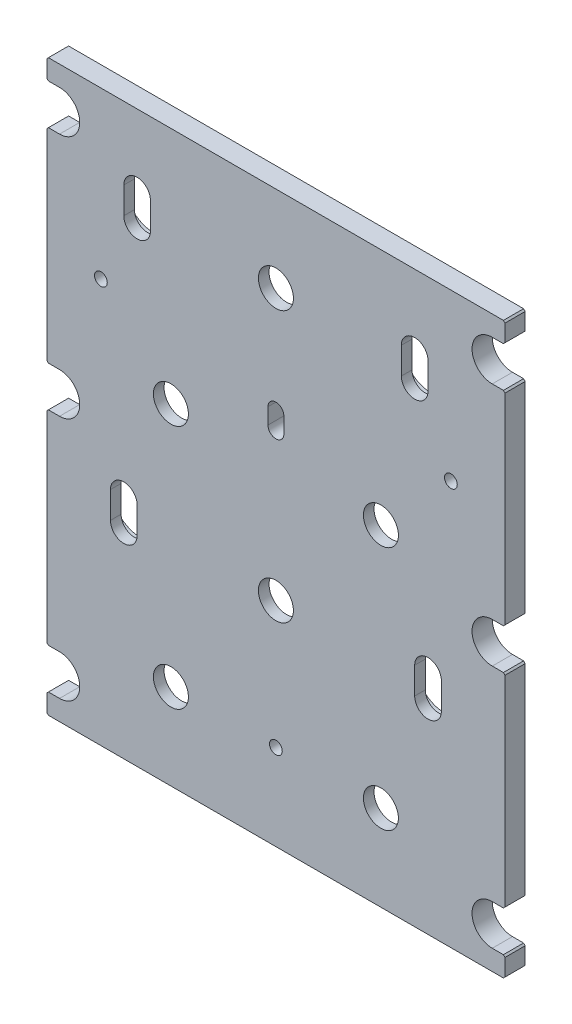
ISO-10303-21;
HEADER;
FILE_DESCRIPTION(('STEP AP214'),'2;1');
FILE_NAME('part.step','',(''),(''),'','','');
FILE_SCHEMA(('AUTOMOTIVE_DESIGN { 1 0 10303 214 1 1 1 1 }'));
ENDSEC;
DATA;
#1=APPLICATION_CONTEXT('core data for automotive mechanical design processes');
#2=APPLICATION_PROTOCOL_DEFINITION('international standard','automotive_design',2000,#1);
#3=PRODUCT_CONTEXT('',#1,'mechanical');
#4=PRODUCT('Part','Part','',(#3));
#5=PRODUCT_RELATED_PRODUCT_CATEGORY('part','',(#4));
#6=PRODUCT_DEFINITION_FORMATION('','',#4);
#7=PRODUCT_DEFINITION_CONTEXT('part definition',#1,'design');
#8=PRODUCT_DEFINITION('design','',#6,#7);
#9=PRODUCT_DEFINITION_SHAPE('','',#8);
#10=(LENGTH_UNIT() NAMED_UNIT(*) SI_UNIT(.MILLI.,.METRE.));
#11=(NAMED_UNIT(*) PLANE_ANGLE_UNIT() SI_UNIT($,.RADIAN.));
#12=(NAMED_UNIT(*) SI_UNIT($,.STERADIAN.) SOLID_ANGLE_UNIT());
#13=UNCERTAINTY_MEASURE_WITH_UNIT(LENGTH_MEASURE(1.E-05),#10,'distance_accuracy_value','');
#14=(GEOMETRIC_REPRESENTATION_CONTEXT(3) GLOBAL_UNCERTAINTY_ASSIGNED_CONTEXT((#13)) GLOBAL_UNIT_ASSIGNED_CONTEXT((#10,
#11,#12)) REPRESENTATION_CONTEXT('',''));
#15=CARTESIAN_POINT('',(0.,0.,0.));
#16=DIRECTION('',(0.,0.,1.));
#17=DIRECTION('',(1.,0.,0.));
#18=AXIS2_PLACEMENT_3D('',#15,#16,#17);
#19=CARTESIAN_POINT('',(72.,113.5,6.35));
#20=DIRECTION('',(0.,0.,-1.));
#21=DIRECTION('',(-1.,0.,0.));
#22=AXIS2_PLACEMENT_3D('',#19,#20,#21);
#23=CYLINDRICAL_SURFACE('',#22,2.5);
#24=DIRECTION('',(0.,0.,-1.));
#25=VECTOR('',#24,1.);
#26=CARTESIAN_POINT('',(74.5,113.5,6.35));
#27=LINE('',#26,#25);
#28=CARTESIAN_POINT('',(74.5,113.5,6.35));
#29=VERTEX_POINT('',#28);
#30=CARTESIAN_POINT('',(74.5,113.5,1.));
#31=VERTEX_POINT('',#30);
#32=EDGE_CURVE('E932',#29,#31,#27,.T.);
#33=ORIENTED_EDGE('',*,*,#32,.T.);
#34=CARTESIAN_POINT('',(72.,113.5,1.));
#35=DIRECTION('',(0.,0.,-1.));
#36=DIRECTION('',(-1.,0.,0.));
#37=AXIS2_PLACEMENT_3D('',#34,#35,#36);
#38=CIRCLE('',#37,2.5);
#39=CARTESIAN_POINT('',(69.5,113.5,1.));
#40=VERTEX_POINT('',#39);
#41=EDGE_CURVE('E830',#31,#40,#38,.T.);
#42=ORIENTED_EDGE('',*,*,#41,.T.);
#43=DIRECTION('',(0.,0.,-1.));
#44=VECTOR('',#43,1.);
#45=CARTESIAN_POINT('',(69.5,113.5,6.35));
#46=LINE('',#45,#44);
#47=CARTESIAN_POINT('',(69.5,113.5,6.35));
#48=VERTEX_POINT('',#47);
#49=EDGE_CURVE('E923',#48,#40,#46,.T.);
#50=ORIENTED_EDGE('',*,*,#49,.F.);
#51=CARTESIAN_POINT('',(72.,113.5,6.35));
#52=DIRECTION('',(0.,0.,1.));
#53=DIRECTION('',(-1.,0.,0.));
#54=AXIS2_PLACEMENT_3D('',#51,#52,#53);
#55=CIRCLE('',#54,2.5);
#56=EDGE_CURVE('E914',#48,#29,#55,.T.);
#57=ORIENTED_EDGE('',*,*,#56,.T.);
#58=EDGE_LOOP('',(#33,#42,#50,#57));
#59=FACE_BOUND('',#58,.T.);
#60=ADVANCED_FACE('F31',(#59),#23,.F.);
#61=CARTESIAN_POINT('',(74.5,118.5,6.35));
#62=DIRECTION('',(-1.,0.,0.));
#63=DIRECTION('',(0.,0.,1.));
#64=AXIS2_PLACEMENT_3D('',#61,#62,#63);
#65=PLANE('',#64);
#66=DIRECTION('',(0.,0.,-1.));
#67=VECTOR('',#66,1.);
#68=CARTESIAN_POINT('',(74.5,118.5,6.35));
#69=LINE('',#68,#67);
#70=CARTESIAN_POINT('',(74.5,118.5,6.35));
#71=VERTEX_POINT('',#70);
#72=CARTESIAN_POINT('',(74.5,118.5,1.));
#73=VERTEX_POINT('',#72);
#74=EDGE_CURVE('E929',#71,#73,#69,.T.);
#75=ORIENTED_EDGE('',*,*,#74,.T.);
#76=DIRECTION('',(0.,-1.,0.));
#77=VECTOR('',#76,1.);
#78=CARTESIAN_POINT('',(74.5,118.5,1.));
#79=LINE('',#78,#77);
#80=EDGE_CURVE('E827',#73,#31,#79,.T.);
#81=ORIENTED_EDGE('',*,*,#80,.T.);
#82=ORIENTED_EDGE('',*,*,#32,.F.);
#83=DIRECTION('',(0.,1.,0.));
#84=VECTOR('',#83,1.);
#85=CARTESIAN_POINT('',(74.5,118.5,6.35));
#86=LINE('',#85,#84);
#87=EDGE_CURVE('E916',#29,#71,#86,.T.);
#88=ORIENTED_EDGE('',*,*,#87,.T.);
#89=EDGE_LOOP('',(#75,#81,#82,#88));
#90=FACE_BOUND('',#89,.T.);
#91=ADVANCED_FACE('F1659',(#90),#65,.T.);
#92=CARTESIAN_POINT('',(72.,118.5,6.35));
#93=DIRECTION('',(0.,0.,-1.));
#94=DIRECTION('',(-1.,0.,0.));
#95=AXIS2_PLACEMENT_3D('',#92,#93,#94);
#96=CYLINDRICAL_SURFACE('',#95,2.5);
#97=DIRECTION('',(0.,0.,-1.));
#98=VECTOR('',#97,1.);
#99=CARTESIAN_POINT('',(69.5,118.5,6.35));
#100=LINE('',#99,#98);
#101=CARTESIAN_POINT('',(69.5,118.5,6.35));
#102=VERTEX_POINT('',#101);
#103=CARTESIAN_POINT('',(69.5,118.5,1.));
#104=VERTEX_POINT('',#103);
#105=EDGE_CURVE('E926',#102,#104,#100,.T.);
#106=ORIENTED_EDGE('',*,*,#105,.T.);
#107=CARTESIAN_POINT('',(72.,118.5,1.));
#108=DIRECTION('',(0.,0.,-1.));
#109=DIRECTION('',(-1.,0.,0.));
#110=AXIS2_PLACEMENT_3D('',#107,#108,#109);
#111=CIRCLE('',#110,2.5);
#112=EDGE_CURVE('E824',#104,#73,#111,.T.);
#113=ORIENTED_EDGE('',*,*,#112,.T.);
#114=ORIENTED_EDGE('',*,*,#74,.F.);
#115=CARTESIAN_POINT('',(72.,118.5,6.35));
#116=DIRECTION('',(0.,0.,1.));
#117=DIRECTION('',(1.,0.,0.));
#118=AXIS2_PLACEMENT_3D('',#115,#116,#117);
#119=CIRCLE('',#118,2.5);
#120=EDGE_CURVE('E918',#71,#102,#119,.T.);
#121=ORIENTED_EDGE('',*,*,#120,.T.);
#122=EDGE_LOOP('',(#106,#113,#114,#121));
#123=FACE_BOUND('',#122,.T.);
#124=ADVANCED_FACE('F1665',(#123),#96,.F.);
#125=CARTESIAN_POINT('',(69.5,118.5,6.35));
#126=DIRECTION('',(1.,0.,0.));
#127=DIRECTION('',(0.,0.,-1.));
#128=AXIS2_PLACEMENT_3D('',#125,#126,#127);
#129=PLANE('',#128);
#130=ORIENTED_EDGE('',*,*,#49,.T.);
#131=DIRECTION('',(0.,1.,0.));
#132=VECTOR('',#131,1.);
#133=CARTESIAN_POINT('',(69.5,118.5,1.));
#134=LINE('',#133,#132);
#135=EDGE_CURVE('E1238',#40,#104,#134,.T.);
#136=ORIENTED_EDGE('',*,*,#135,.T.);
#137=ORIENTED_EDGE('',*,*,#105,.F.);
#138=DIRECTION('',(0.,-1.,0.));
#139=VECTOR('',#138,1.);
#140=CARTESIAN_POINT('',(69.5,118.5,6.35));
#141=LINE('',#140,#139);
#142=EDGE_CURVE('E921',#102,#48,#141,.T.);
#143=ORIENTED_EDGE('',*,*,#142,.T.);
#144=EDGE_LOOP('',(#130,#136,#137,#143));
#145=FACE_BOUND('',#144,.T.);
#146=ADVANCED_FACE('F1718',(#145),#129,.T.);
#147=CARTESIAN_POINT('',(24.191,62.809,6.35));
#148=DIRECTION('',(0.,0.,-1.));
#149=DIRECTION('',(-1.,0.,0.));
#150=AXIS2_PLACEMENT_3D('',#147,#148,#149);
#151=CYLINDRICAL_SURFACE('',#150,4.191);
#152=DIRECTION('',(0.,0.,-1.));
#153=VECTOR('',#152,1.);
#154=CARTESIAN_POINT('',(28.382,62.809,6.35));
#155=LINE('',#154,#153);
#156=CARTESIAN_POINT('',(28.382,62.809,6.35));
#157=VERTEX_POINT('',#156);
#158=CARTESIAN_POINT('',(28.382,62.809,3.));
#159=VERTEX_POINT('',#158);
#160=EDGE_CURVE('E995',#157,#159,#155,.T.);
#161=ORIENTED_EDGE('',*,*,#160,.T.);
#162=CARTESIAN_POINT('',(24.191,62.809,3.));
#163=DIRECTION('',(0.,0.,-1.));
#164=DIRECTION('',(-1.,0.,0.));
#165=AXIS2_PLACEMENT_3D('',#162,#163,#164);
#166=CIRCLE('',#165,4.191);
#167=CARTESIAN_POINT('',(20.,62.809,3.));
#168=VERTEX_POINT('',#167);
#169=EDGE_CURVE('E842',#159,#168,#166,.T.);
#170=ORIENTED_EDGE('',*,*,#169,.T.);
#171=DIRECTION('',(0.,0.,-1.));
#172=VECTOR('',#171,1.);
#173=CARTESIAN_POINT('',(20.,62.809,6.35));
#174=LINE('',#173,#172);
#175=CARTESIAN_POINT('',(20.,62.809,6.35));
#176=VERTEX_POINT('',#175);
#177=EDGE_CURVE('E986',#176,#168,#174,.T.);
#178=ORIENTED_EDGE('',*,*,#177,.F.);
#179=CARTESIAN_POINT('',(24.191,62.809,6.35));
#180=DIRECTION('',(0.,0.,1.));
#181=DIRECTION('',(-1.,0.,0.));
#182=AXIS2_PLACEMENT_3D('',#179,#180,#181);
#183=CIRCLE('',#182,4.191);
#184=EDGE_CURVE('E977',#176,#157,#183,.T.);
#185=ORIENTED_EDGE('',*,*,#184,.T.);
#186=EDGE_LOOP('',(#161,#170,#178,#185));
#187=FACE_BOUND('',#186,.T.);
#188=ADVANCED_FACE('F1714',(#187),#151,.F.);
#189=CARTESIAN_POINT('',(28.382,71.191,6.35));
#190=DIRECTION('',(-1.,0.,0.));
#191=DIRECTION('',(0.,0.,1.));
#192=AXIS2_PLACEMENT_3D('',#189,#190,#191);
#193=PLANE('',#192);
#194=DIRECTION('',(0.,0.,-1.));
#195=VECTOR('',#194,1.);
#196=CARTESIAN_POINT('',(28.382,71.191,6.35));
#197=LINE('',#196,#195);
#198=CARTESIAN_POINT('',(28.382,71.191,6.35));
#199=VERTEX_POINT('',#198);
#200=CARTESIAN_POINT('',(28.382,71.191,3.));
#201=VERTEX_POINT('',#200);
#202=EDGE_CURVE('E992',#199,#201,#197,.T.);
#203=ORIENTED_EDGE('',*,*,#202,.T.);
#204=DIRECTION('',(0.,-1.,0.));
#205=VECTOR('',#204,1.);
#206=CARTESIAN_POINT('',(28.382,71.191,3.));
#207=LINE('',#206,#205);
#208=EDGE_CURVE('E839',#201,#159,#207,.T.);
#209=ORIENTED_EDGE('',*,*,#208,.T.);
#210=ORIENTED_EDGE('',*,*,#160,.F.);
#211=DIRECTION('',(0.,1.,0.));
#212=VECTOR('',#211,1.);
#213=CARTESIAN_POINT('',(28.382,71.191,6.35));
#214=LINE('',#213,#212);
#215=EDGE_CURVE('E979',#157,#199,#214,.T.);
#216=ORIENTED_EDGE('',*,*,#215,.T.);
#217=EDGE_LOOP('',(#203,#209,#210,#216));
#218=FACE_BOUND('',#217,.T.);
#219=ADVANCED_FACE('F1710',(#218),#193,.T.);
#220=CARTESIAN_POINT('',(24.191,71.191,6.35));
#221=DIRECTION('',(0.,0.,-1.));
#222=DIRECTION('',(-1.,0.,0.));
#223=AXIS2_PLACEMENT_3D('',#220,#221,#222);
#224=CYLINDRICAL_SURFACE('',#223,4.191);
#225=DIRECTION('',(0.,0.,-1.));
#226=VECTOR('',#225,1.);
#227=CARTESIAN_POINT('',(20.,71.191,6.35));
#228=LINE('',#227,#226);
#229=CARTESIAN_POINT('',(20.,71.191,6.35));
#230=VERTEX_POINT('',#229);
#231=CARTESIAN_POINT('',(20.,71.191,3.));
#232=VERTEX_POINT('',#231);
#233=EDGE_CURVE('E989',#230,#232,#228,.T.);
#234=ORIENTED_EDGE('',*,*,#233,.T.);
#235=CARTESIAN_POINT('',(24.191,71.191,3.));
#236=DIRECTION('',(0.,0.,-1.));
#237=DIRECTION('',(-1.,0.,0.));
#238=AXIS2_PLACEMENT_3D('',#235,#236,#237);
#239=CIRCLE('',#238,4.191);
#240=EDGE_CURVE('E836',#232,#201,#239,.T.);
#241=ORIENTED_EDGE('',*,*,#240,.T.);
#242=ORIENTED_EDGE('',*,*,#202,.F.);
#243=CARTESIAN_POINT('',(24.191,71.191,6.35));
#244=DIRECTION('',(0.,0.,1.));
#245=DIRECTION('',(1.,0.,0.));
#246=AXIS2_PLACEMENT_3D('',#243,#244,#245);
#247=CIRCLE('',#246,4.191);
#248=EDGE_CURVE('E981',#199,#230,#247,.T.);
#249=ORIENTED_EDGE('',*,*,#248,.T.);
#250=EDGE_LOOP('',(#234,#241,#242,#249));
#251=FACE_BOUND('',#250,.T.);
#252=ADVANCED_FACE('F1706',(#251),#224,.F.);
#253=CARTESIAN_POINT('',(20.,71.191,6.35));
#254=DIRECTION('',(1.,0.,0.));
#255=DIRECTION('',(0.,0.,-1.));
#256=AXIS2_PLACEMENT_3D('',#253,#254,#255);
#257=PLANE('',#256);
#258=ORIENTED_EDGE('',*,*,#177,.T.);
#259=DIRECTION('',(0.,1.,0.));
#260=VECTOR('',#259,1.);
#261=CARTESIAN_POINT('',(20.,71.191,3.));
#262=LINE('',#261,#260);
#263=EDGE_CURVE('E1235',#168,#232,#262,.T.);
#264=ORIENTED_EDGE('',*,*,#263,.T.);
#265=ORIENTED_EDGE('',*,*,#233,.F.);
#266=DIRECTION('',(0.,-1.,0.));
#267=VECTOR('',#266,1.);
#268=CARTESIAN_POINT('',(20.,71.191,6.35));
#269=LINE('',#268,#267);
#270=EDGE_CURVE('E984',#230,#176,#269,.T.);
#271=ORIENTED_EDGE('',*,*,#270,.T.);
#272=EDGE_LOOP('',(#258,#264,#265,#271));
#273=FACE_BOUND('',#272,.T.);
#274=ADVANCED_FACE('F1702',(#273),#257,.T.);
#275=CARTESIAN_POINT('',(119.809,62.809,6.35));
#276=DIRECTION('',(0.,0.,-1.));
#277=DIRECTION('',(-1.,0.,0.));
#278=AXIS2_PLACEMENT_3D('',#275,#276,#277);
#279=CYLINDRICAL_SURFACE('',#278,4.19100000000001);
#280=DIRECTION('',(0.,0.,-1.));
#281=VECTOR('',#280,1.);
#282=CARTESIAN_POINT('',(124.,62.809,6.35));
#283=LINE('',#282,#281);
#284=CARTESIAN_POINT('',(124.,62.809,6.35));
#285=VERTEX_POINT('',#284);
#286=CARTESIAN_POINT('',(124.,62.809,3.));
#287=VERTEX_POINT('',#286);
#288=EDGE_CURVE('E974',#285,#287,#283,.T.);
#289=ORIENTED_EDGE('',*,*,#288,.T.);
#290=CARTESIAN_POINT('',(119.809,62.809,3.));
#291=DIRECTION('',(0.,0.,-1.));
#292=DIRECTION('',(-1.,0.,0.));
#293=AXIS2_PLACEMENT_3D('',#290,#291,#292);
#294=CIRCLE('',#293,4.19100000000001);
#295=CARTESIAN_POINT('',(115.618,62.809,3.));
#296=VERTEX_POINT('',#295);
#297=EDGE_CURVE('E854',#287,#296,#294,.T.);
#298=ORIENTED_EDGE('',*,*,#297,.T.);
#299=DIRECTION('',(0.,0.,-1.));
#300=VECTOR('',#299,1.);
#301=CARTESIAN_POINT('',(115.618,62.809,6.35));
#302=LINE('',#301,#300);
#303=CARTESIAN_POINT('',(115.618,62.809,6.35));
#304=VERTEX_POINT('',#303);
#305=EDGE_CURVE('E965',#304,#296,#302,.T.);
#306=ORIENTED_EDGE('',*,*,#305,.F.);
#307=CARTESIAN_POINT('',(119.809,62.809,6.35));
#308=DIRECTION('',(0.,0.,1.));
#309=DIRECTION('',(-1.,0.,0.));
#310=AXIS2_PLACEMENT_3D('',#307,#308,#309);
#311=CIRCLE('',#310,4.19100000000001);
#312=EDGE_CURVE('E956',#304,#285,#311,.T.);
#313=ORIENTED_EDGE('',*,*,#312,.T.);
#314=EDGE_LOOP('',(#289,#298,#306,#313));
#315=FACE_BOUND('',#314,.T.);
#316=ADVANCED_FACE('F1698',(#315),#279,.F.);
#317=CARTESIAN_POINT('',(124.,71.191,6.35));
#318=DIRECTION('',(-1.,0.,0.));
#319=DIRECTION('',(0.,0.,1.));
#320=AXIS2_PLACEMENT_3D('',#317,#318,#319);
#321=PLANE('',#320);
#322=DIRECTION('',(0.,0.,-1.));
#323=VECTOR('',#322,1.);
#324=CARTESIAN_POINT('',(124.,71.191,6.35));
#325=LINE('',#324,#323);
#326=CARTESIAN_POINT('',(124.,71.191,6.35));
#327=VERTEX_POINT('',#326);
#328=CARTESIAN_POINT('',(124.,71.191,3.));
#329=VERTEX_POINT('',#328);
#330=EDGE_CURVE('E971',#327,#329,#325,.T.);
#331=ORIENTED_EDGE('',*,*,#330,.T.);
#332=DIRECTION('',(0.,-1.,0.));
#333=VECTOR('',#332,1.);
#334=CARTESIAN_POINT('',(124.,71.191,3.));
#335=LINE('',#334,#333);
#336=EDGE_CURVE('E851',#329,#287,#335,.T.);
#337=ORIENTED_EDGE('',*,*,#336,.T.);
#338=ORIENTED_EDGE('',*,*,#288,.F.);
#339=DIRECTION('',(0.,1.,0.));
#340=VECTOR('',#339,1.);
#341=CARTESIAN_POINT('',(124.,71.191,6.35));
#342=LINE('',#341,#340);
#343=EDGE_CURVE('E958',#285,#327,#342,.T.);
#344=ORIENTED_EDGE('',*,*,#343,.T.);
#345=EDGE_LOOP('',(#331,#337,#338,#344));
#346=FACE_BOUND('',#345,.T.);
#347=ADVANCED_FACE('F1694',(#346),#321,.T.);
#348=CARTESIAN_POINT('',(119.809,71.191,6.35));
#349=DIRECTION('',(0.,0.,-1.));
#350=DIRECTION('',(-1.,0.,0.));
#351=AXIS2_PLACEMENT_3D('',#348,#349,#350);
#352=CYLINDRICAL_SURFACE('',#351,4.19100000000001);
#353=DIRECTION('',(0.,0.,-1.));
#354=VECTOR('',#353,1.);
#355=CARTESIAN_POINT('',(115.618,71.191,6.35));
#356=LINE('',#355,#354);
#357=CARTESIAN_POINT('',(115.618,71.191,6.35));
#358=VERTEX_POINT('',#357);
#359=CARTESIAN_POINT('',(115.618,71.191,3.));
#360=VERTEX_POINT('',#359);
#361=EDGE_CURVE('E968',#358,#360,#356,.T.);
#362=ORIENTED_EDGE('',*,*,#361,.T.);
#363=CARTESIAN_POINT('',(119.809,71.191,3.));
#364=DIRECTION('',(0.,0.,-1.));
#365=DIRECTION('',(-1.,0.,0.));
#366=AXIS2_PLACEMENT_3D('',#363,#364,#365);
#367=CIRCLE('',#366,4.19100000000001);
#368=EDGE_CURVE('E848',#360,#329,#367,.T.);
#369=ORIENTED_EDGE('',*,*,#368,.T.);
#370=ORIENTED_EDGE('',*,*,#330,.F.);
#371=CARTESIAN_POINT('',(119.809,71.191,6.35));
#372=DIRECTION('',(0.,0.,1.));
#373=DIRECTION('',(1.,0.,0.));
#374=AXIS2_PLACEMENT_3D('',#371,#372,#373);
#375=CIRCLE('',#374,4.19100000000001);
#376=EDGE_CURVE('E960',#327,#358,#375,.T.);
#377=ORIENTED_EDGE('',*,*,#376,.T.);
#378=EDGE_LOOP('',(#362,#369,#370,#377));
#379=FACE_BOUND('',#378,.T.);
#380=ADVANCED_FACE('F1690',(#379),#352,.F.);
#381=CARTESIAN_POINT('',(115.618,71.191,6.35));
#382=DIRECTION('',(1.,0.,0.));
#383=DIRECTION('',(0.,0.,-1.));
#384=AXIS2_PLACEMENT_3D('',#381,#382,#383);
#385=PLANE('',#384);
#386=ORIENTED_EDGE('',*,*,#305,.T.);
#387=DIRECTION('',(0.,1.,0.));
#388=VECTOR('',#387,1.);
#389=CARTESIAN_POINT('',(115.618,71.191,3.));
#390=LINE('',#389,#388);
#391=EDGE_CURVE('E1232',#296,#360,#390,.T.);
#392=ORIENTED_EDGE('',*,*,#391,.T.);
#393=ORIENTED_EDGE('',*,*,#361,.F.);
#394=DIRECTION('',(0.,-1.,0.));
#395=VECTOR('',#394,1.);
#396=CARTESIAN_POINT('',(115.618,71.191,6.35));
#397=LINE('',#396,#395);
#398=EDGE_CURVE('E963',#358,#304,#397,.T.);
#399=ORIENTED_EDGE('',*,*,#398,.T.);
#400=EDGE_LOOP('',(#386,#392,#393,#399));
#401=FACE_BOUND('',#400,.T.);
#402=ADVANCED_FACE('F1686',(#401),#385,.T.);
#403=CARTESIAN_POINT('',(115.618,147.809,6.35));
#404=DIRECTION('',(0.,0.,-1.));
#405=DIRECTION('',(-1.,0.,0.));
#406=AXIS2_PLACEMENT_3D('',#403,#404,#405);
#407=CYLINDRICAL_SURFACE('',#406,4.19100000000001);
#408=DIRECTION('',(0.,0.,-1.));
#409=VECTOR('',#408,1.);
#410=CARTESIAN_POINT('',(119.809,147.809,6.35));
#411=LINE('',#410,#409);
#412=CARTESIAN_POINT('',(119.809,147.809,6.35));
#413=VERTEX_POINT('',#412);
#414=CARTESIAN_POINT('',(119.809,147.809,3.));
#415=VERTEX_POINT('',#414);
#416=EDGE_CURVE('E953',#413,#415,#411,.T.);
#417=ORIENTED_EDGE('',*,*,#416,.T.);
#418=CARTESIAN_POINT('',(115.618,147.809,3.));
#419=DIRECTION('',(0.,0.,-1.));
#420=DIRECTION('',(-1.,0.,0.));
#421=AXIS2_PLACEMENT_3D('',#418,#419,#420);
#422=CIRCLE('',#421,4.19100000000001);
#423=CARTESIAN_POINT('',(111.427,147.809,3.));
#424=VERTEX_POINT('',#423);
#425=EDGE_CURVE('E866',#415,#424,#422,.T.);
#426=ORIENTED_EDGE('',*,*,#425,.T.);
#427=DIRECTION('',(0.,0.,-1.));
#428=VECTOR('',#427,1.);
#429=CARTESIAN_POINT('',(111.427,147.809,6.35));
#430=LINE('',#429,#428);
#431=CARTESIAN_POINT('',(111.427,147.809,6.35));
#432=VERTEX_POINT('',#431);
#433=EDGE_CURVE('E944',#432,#424,#430,.T.);
#434=ORIENTED_EDGE('',*,*,#433,.F.);
#435=CARTESIAN_POINT('',(115.618,147.809,6.35));
#436=DIRECTION('',(0.,0.,1.));
#437=DIRECTION('',(-1.,0.,0.));
#438=AXIS2_PLACEMENT_3D('',#435,#436,#437);
#439=CIRCLE('',#438,4.19100000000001);
#440=EDGE_CURVE('E935',#432,#413,#439,.T.);
#441=ORIENTED_EDGE('',*,*,#440,.T.);
#442=EDGE_LOOP('',(#417,#426,#434,#441));
#443=FACE_BOUND('',#442,.T.);
#444=ADVANCED_FACE('F1682',(#443),#407,.F.);
#445=CARTESIAN_POINT('',(119.809,156.191,6.35));
#446=DIRECTION('',(-1.,0.,0.));
#447=DIRECTION('',(0.,0.,1.));
#448=AXIS2_PLACEMENT_3D('',#445,#446,#447);
#449=PLANE('',#448);
#450=DIRECTION('',(0.,0.,-1.));
#451=VECTOR('',#450,1.);
#452=CARTESIAN_POINT('',(119.809,156.191,6.35));
#453=LINE('',#452,#451);
#454=CARTESIAN_POINT('',(119.809,156.191,6.35));
#455=VERTEX_POINT('',#454);
#456=CARTESIAN_POINT('',(119.809,156.191,3.));
#457=VERTEX_POINT('',#456);
#458=EDGE_CURVE('E950',#455,#457,#453,.T.);
#459=ORIENTED_EDGE('',*,*,#458,.T.);
#460=DIRECTION('',(0.,-1.,0.));
#461=VECTOR('',#460,1.);
#462=CARTESIAN_POINT('',(119.809,156.191,3.));
#463=LINE('',#462,#461);
#464=EDGE_CURVE('E863',#457,#415,#463,.T.);
#465=ORIENTED_EDGE('',*,*,#464,.T.);
#466=ORIENTED_EDGE('',*,*,#416,.F.);
#467=DIRECTION('',(0.,1.,0.));
#468=VECTOR('',#467,1.);
#469=CARTESIAN_POINT('',(119.809,156.191,6.35));
#470=LINE('',#469,#468);
#471=EDGE_CURVE('E937',#413,#455,#470,.T.);
#472=ORIENTED_EDGE('',*,*,#471,.T.);
#473=EDGE_LOOP('',(#459,#465,#466,#472));
#474=FACE_BOUND('',#473,.T.);
#475=ADVANCED_FACE('F1678',(#474),#449,.T.);
#476=CARTESIAN_POINT('',(115.618,156.191,6.35));
#477=DIRECTION('',(0.,0.,-1.));
#478=DIRECTION('',(-1.,0.,0.));
#479=AXIS2_PLACEMENT_3D('',#476,#477,#478);
#480=CYLINDRICAL_SURFACE('',#479,4.19100000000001);
#481=DIRECTION('',(0.,0.,-1.));
#482=VECTOR('',#481,1.);
#483=CARTESIAN_POINT('',(111.427,156.191,6.35));
#484=LINE('',#483,#482);
#485=CARTESIAN_POINT('',(111.427,156.191,6.35));
#486=VERTEX_POINT('',#485);
#487=CARTESIAN_POINT('',(111.427,156.191,3.));
#488=VERTEX_POINT('',#487);
#489=EDGE_CURVE('E947',#486,#488,#484,.T.);
#490=ORIENTED_EDGE('',*,*,#489,.T.);
#491=CARTESIAN_POINT('',(115.618,156.191,3.));
#492=DIRECTION('',(0.,0.,-1.));
#493=DIRECTION('',(-1.,0.,0.));
#494=AXIS2_PLACEMENT_3D('',#491,#492,#493);
#495=CIRCLE('',#494,4.19100000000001);
#496=EDGE_CURVE('E860',#488,#457,#495,.T.);
#497=ORIENTED_EDGE('',*,*,#496,.T.);
#498=ORIENTED_EDGE('',*,*,#458,.F.);
#499=CARTESIAN_POINT('',(115.618,156.191,6.35));
#500=DIRECTION('',(0.,0.,1.));
#501=DIRECTION('',(1.,0.,0.));
#502=AXIS2_PLACEMENT_3D('',#499,#500,#501);
#503=CIRCLE('',#502,4.19100000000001);
#504=EDGE_CURVE('E939',#455,#486,#503,.T.);
#505=ORIENTED_EDGE('',*,*,#504,.T.);
#506=EDGE_LOOP('',(#490,#497,#498,#505));
#507=FACE_BOUND('',#506,.T.);
#508=ADVANCED_FACE('F1674',(#507),#480,.F.);
#509=CARTESIAN_POINT('',(111.427,156.191,6.35));
#510=DIRECTION('',(1.,0.,0.));
#511=DIRECTION('',(0.,0.,-1.));
#512=AXIS2_PLACEMENT_3D('',#509,#510,#511);
#513=PLANE('',#512);
#514=ORIENTED_EDGE('',*,*,#433,.T.);
#515=DIRECTION('',(0.,1.,0.));
#516=VECTOR('',#515,1.);
#517=CARTESIAN_POINT('',(111.427,156.191,3.));
#518=LINE('',#517,#516);
#519=EDGE_CURVE('E1229',#424,#488,#518,.T.);
#520=ORIENTED_EDGE('',*,*,#519,.T.);
#521=ORIENTED_EDGE('',*,*,#489,.F.);
#522=DIRECTION('',(0.,-1.,0.));
#523=VECTOR('',#522,1.);
#524=CARTESIAN_POINT('',(111.427,156.191,6.35));
#525=LINE('',#524,#523);
#526=EDGE_CURVE('E942',#486,#432,#525,.T.);
#527=ORIENTED_EDGE('',*,*,#526,.T.);
#528=EDGE_LOOP('',(#514,#520,#521,#527));
#529=FACE_BOUND('',#528,.T.);
#530=ADVANCED_FACE('F1670',(#529),#513,.T.);
#531=CARTESIAN_POINT('',(28.382,147.809,6.35));
#532=DIRECTION('',(0.,0.,-1.));
#533=DIRECTION('',(-1.,0.,0.));
#534=AXIS2_PLACEMENT_3D('',#531,#532,#533);
#535=CYLINDRICAL_SURFACE('',#534,4.191);
#536=DIRECTION('',(0.,0.,-1.));
#537=VECTOR('',#536,1.);
#538=CARTESIAN_POINT('',(32.573,147.809,6.35));
#539=LINE('',#538,#537);
#540=CARTESIAN_POINT('',(32.573,147.809,6.35));
#541=VERTEX_POINT('',#540);
#542=CARTESIAN_POINT('',(32.573,147.809,3.));
#543=VERTEX_POINT('',#542);
#544=EDGE_CURVE('E1016',#541,#543,#539,.T.);
#545=ORIENTED_EDGE('',*,*,#544,.T.);
#546=CARTESIAN_POINT('',(28.382,147.809,3.));
#547=DIRECTION('',(0.,0.,-1.));
#548=DIRECTION('',(-1.,0.,0.));
#549=AXIS2_PLACEMENT_3D('',#546,#547,#548);
#550=CIRCLE('',#549,4.191);
#551=CARTESIAN_POINT('',(24.191,147.809,3.));
#552=VERTEX_POINT('',#551);
#553=EDGE_CURVE('E878',#543,#552,#550,.T.);
#554=ORIENTED_EDGE('',*,*,#553,.T.);
#555=DIRECTION('',(0.,0.,-1.));
#556=VECTOR('',#555,1.);
#557=CARTESIAN_POINT('',(24.191,147.809,6.35));
#558=LINE('',#557,#556);
#559=CARTESIAN_POINT('',(24.191,147.809,6.35));
#560=VERTEX_POINT('',#559);
#561=EDGE_CURVE('E1007',#560,#552,#558,.T.);
#562=ORIENTED_EDGE('',*,*,#561,.F.);
#563=CARTESIAN_POINT('',(28.382,147.809,6.35));
#564=DIRECTION('',(0.,0.,1.));
#565=DIRECTION('',(-1.,0.,0.));
#566=AXIS2_PLACEMENT_3D('',#563,#564,#565);
#567=CIRCLE('',#566,4.191);
#568=EDGE_CURVE('E998',#560,#541,#567,.T.);
#569=ORIENTED_EDGE('',*,*,#568,.T.);
#570=EDGE_LOOP('',(#545,#554,#562,#569));
#571=FACE_BOUND('',#570,.T.);
#572=ADVANCED_FACE('F1673',(#571),#535,.F.);
#573=CARTESIAN_POINT('',(32.573,156.191,6.35));
#574=DIRECTION('',(-1.,0.,0.));
#575=DIRECTION('',(0.,0.,1.));
#576=AXIS2_PLACEMENT_3D('',#573,#574,#575);
#577=PLANE('',#576);
#578=DIRECTION('',(0.,0.,-1.));
#579=VECTOR('',#578,1.);
#580=CARTESIAN_POINT('',(32.573,156.191,6.35));
#581=LINE('',#580,#579);
#582=CARTESIAN_POINT('',(32.573,156.191,6.35));
#583=VERTEX_POINT('',#582);
#584=CARTESIAN_POINT('',(32.573,156.191,3.));
#585=VERTEX_POINT('',#584);
#586=EDGE_CURVE('E1013',#583,#585,#581,.T.);
#587=ORIENTED_EDGE('',*,*,#586,.T.);
#588=DIRECTION('',(0.,-1.,0.));
#589=VECTOR('',#588,1.);
#590=CARTESIAN_POINT('',(32.573,156.191,3.));
#591=LINE('',#590,#589);
#592=EDGE_CURVE('E875',#585,#543,#591,.T.);
#593=ORIENTED_EDGE('',*,*,#592,.T.);
#594=ORIENTED_EDGE('',*,*,#544,.F.);
#595=DIRECTION('',(0.,1.,0.));
#596=VECTOR('',#595,1.);
#597=CARTESIAN_POINT('',(32.573,156.191,6.35));
#598=LINE('',#597,#596);
#599=EDGE_CURVE('E1000',#541,#583,#598,.T.);
#600=ORIENTED_EDGE('',*,*,#599,.T.);
#601=EDGE_LOOP('',(#587,#593,#594,#600));
#602=FACE_BOUND('',#601,.T.);
#603=ADVANCED_FACE('F1728',(#602),#577,.T.);
#604=CARTESIAN_POINT('',(28.382,156.191,6.35));
#605=DIRECTION('',(0.,0.,-1.));
#606=DIRECTION('',(-1.,0.,0.));
#607=AXIS2_PLACEMENT_3D('',#604,#605,#606);
#608=CYLINDRICAL_SURFACE('',#607,4.191);
#609=DIRECTION('',(0.,0.,-1.));
#610=VECTOR('',#609,1.);
#611=CARTESIAN_POINT('',(24.191,156.191,6.35));
#612=LINE('',#611,#610);
#613=CARTESIAN_POINT('',(24.191,156.191,6.35));
#614=VERTEX_POINT('',#613);
#615=CARTESIAN_POINT('',(24.191,156.191,3.));
#616=VERTEX_POINT('',#615);
#617=EDGE_CURVE('E1010',#614,#616,#612,.T.);
#618=ORIENTED_EDGE('',*,*,#617,.T.);
#619=CARTESIAN_POINT('',(28.382,156.191,3.));
#620=DIRECTION('',(0.,0.,-1.));
#621=DIRECTION('',(-1.,0.,0.));
#622=AXIS2_PLACEMENT_3D('',#619,#620,#621);
#623=CIRCLE('',#622,4.191);
#624=EDGE_CURVE('E872',#616,#585,#623,.T.);
#625=ORIENTED_EDGE('',*,*,#624,.T.);
#626=ORIENTED_EDGE('',*,*,#586,.F.);
#627=CARTESIAN_POINT('',(28.382,156.191,6.35));
#628=DIRECTION('',(0.,0.,1.));
#629=DIRECTION('',(1.,0.,0.));
#630=AXIS2_PLACEMENT_3D('',#627,#628,#629);
#631=CIRCLE('',#630,4.191);
#632=EDGE_CURVE('E1002',#583,#614,#631,.T.);
#633=ORIENTED_EDGE('',*,*,#632,.T.);
#634=EDGE_LOOP('',(#618,#625,#626,#633));
#635=FACE_BOUND('',#634,.T.);
#636=ADVANCED_FACE('F1724',(#635),#608,.F.);
#637=CARTESIAN_POINT('',(24.191,156.191,6.35));
#638=DIRECTION('',(1.,0.,0.));
#639=DIRECTION('',(0.,0.,-1.));
#640=AXIS2_PLACEMENT_3D('',#637,#638,#639);
#641=PLANE('',#640);
#642=ORIENTED_EDGE('',*,*,#561,.T.);
#643=DIRECTION('',(0.,1.,0.));
#644=VECTOR('',#643,1.);
#645=CARTESIAN_POINT('',(24.191,156.191,3.));
#646=LINE('',#645,#644);
#647=EDGE_CURVE('E1214',#552,#616,#646,.T.);
#648=ORIENTED_EDGE('',*,*,#647,.T.);
#649=ORIENTED_EDGE('',*,*,#617,.F.);
#650=DIRECTION('',(0.,-1.,0.));
#651=VECTOR('',#650,1.);
#652=CARTESIAN_POINT('',(24.191,156.191,6.35));
#653=LINE('',#652,#651);
#654=EDGE_CURVE('E1005',#614,#560,#653,.T.);
#655=ORIENTED_EDGE('',*,*,#654,.T.);
#656=EDGE_LOOP('',(#642,#648,#649,#655));
#657=FACE_BOUND('',#656,.T.);
#658=ADVANCED_FACE('F1720',(#657),#641,.T.);
#659=CARTESIAN_POINT('',(72.,152.,6.35));
#660=DIRECTION('',(0.,0.,-1.));
#661=DIRECTION('',(-1.,0.,0.));
#662=AXIS2_PLACEMENT_3D('',#659,#660,#661);
#663=CYLINDRICAL_SURFACE('',#662,5.5);
#664=CARTESIAN_POINT('',(72.,152.,6.35));
#665=DIRECTION('',(0.,0.,1.));
#666=DIRECTION('',(1.,0.,0.));
#667=AXIS2_PLACEMENT_3D('',#664,#665,#666);
#668=CIRCLE('',#667,5.5);
#669=CARTESIAN_POINT('',(77.5,152.,6.35));
#670=VERTEX_POINT('',#669);
#671=EDGE_CURVE('E1019',#670,#670,#668,.T.);
#672=ORIENTED_EDGE('',*,*,#671,.T.);
#673=EDGE_LOOP('',(#672));
#674=FACE_BOUND('',#673,.T.);
#675=CARTESIAN_POINT('',(72.,152.,3.));
#676=DIRECTION('',(0.,0.,-1.));
#677=DIRECTION('',(-1.,0.,0.));
#678=AXIS2_PLACEMENT_3D('',#675,#676,#677);
#679=CIRCLE('',#678,5.5);
#680=CARTESIAN_POINT('',(66.5,152.,3.));
#681=VERTEX_POINT('',#680);
#682=EDGE_CURVE('E884',#681,#681,#679,.T.);
#683=ORIENTED_EDGE('',*,*,#682,.T.);
#684=EDGE_LOOP('',(#683));
#685=FACE_BOUND('',#684,.T.);
#686=ADVANCED_FACE('F1723',(#674,#685),#663,.F.);
#687=CARTESIAN_POINT('',(105.,104.,6.35));
#688=DIRECTION('',(0.,0.,-1.));
#689=DIRECTION('',(-1.,0.,0.));
#690=AXIS2_PLACEMENT_3D('',#687,#688,#689);
#691=CYLINDRICAL_SURFACE('',#690,5.5);
#692=CARTESIAN_POINT('',(105.,104.,6.35));
#693=DIRECTION('',(0.,0.,1.));
#694=DIRECTION('',(1.,0.,0.));
#695=AXIS2_PLACEMENT_3D('',#692,#693,#694);
#696=CIRCLE('',#695,5.5);
#697=CARTESIAN_POINT('',(110.5,104.,6.35));
#698=VERTEX_POINT('',#697);
#699=EDGE_CURVE('E1022',#698,#698,#696,.T.);
#700=ORIENTED_EDGE('',*,*,#699,.T.);
#701=EDGE_LOOP('',(#700));
#702=FACE_BOUND('',#701,.T.);
#703=CARTESIAN_POINT('',(105.,104.,3.));
#704=DIRECTION('',(0.,0.,-1.));
#705=DIRECTION('',(-1.,0.,0.));
#706=AXIS2_PLACEMENT_3D('',#703,#704,#705);
#707=CIRCLE('',#706,5.5);
#708=CARTESIAN_POINT('',(99.5,104.,3.));
#709=VERTEX_POINT('',#708);
#710=EDGE_CURVE('E888',#709,#709,#707,.T.);
#711=ORIENTED_EDGE('',*,*,#710,.T.);
#712=EDGE_LOOP('',(#711));
#713=FACE_BOUND('',#712,.T.);
#714=ADVANCED_FACE('F1738',(#702,#713),#691,.F.);
#715=CARTESIAN_POINT('',(39.,104.,6.35));
#716=DIRECTION('',(0.,0.,-1.));
#717=DIRECTION('',(-1.,0.,0.));
#718=AXIS2_PLACEMENT_3D('',#715,#716,#717);
#719=CYLINDRICAL_SURFACE('',#718,5.5);
#720=CARTESIAN_POINT('',(39.,104.,6.35));
#721=DIRECTION('',(0.,0.,1.));
#722=DIRECTION('',(1.,0.,0.));
#723=AXIS2_PLACEMENT_3D('',#720,#721,#722);
#724=CIRCLE('',#723,5.5);
#725=CARTESIAN_POINT('',(44.5,104.,6.35));
#726=VERTEX_POINT('',#725);
#727=EDGE_CURVE('E1025',#726,#726,#724,.T.);
#728=ORIENTED_EDGE('',*,*,#727,.T.);
#729=EDGE_LOOP('',(#728));
#730=FACE_BOUND('',#729,.T.);
#731=CARTESIAN_POINT('',(39.,104.,3.));
#732=DIRECTION('',(0.,0.,-1.));
#733=DIRECTION('',(-1.,0.,0.));
#734=AXIS2_PLACEMENT_3D('',#731,#732,#733);
#735=CIRCLE('',#734,5.5);
#736=CARTESIAN_POINT('',(33.5,104.,3.));
#737=VERTEX_POINT('',#736);
#738=EDGE_CURVE('E892',#737,#737,#735,.T.);
#739=ORIENTED_EDGE('',*,*,#738,.T.);
#740=EDGE_LOOP('',(#739));
#741=FACE_BOUND('',#740,.T.);
#742=ADVANCED_FACE('F1742',(#730,#741),#719,.F.);
#743=CARTESIAN_POINT('',(72.,67.,6.35));
#744=DIRECTION('',(0.,0.,-1.));
#745=DIRECTION('',(-1.,0.,0.));
#746=AXIS2_PLACEMENT_3D('',#743,#744,#745);
#747=CYLINDRICAL_SURFACE('',#746,5.5);
#748=CARTESIAN_POINT('',(72.,67.,6.35));
#749=DIRECTION('',(0.,0.,1.));
#750=DIRECTION('',(1.,0.,0.));
#751=AXIS2_PLACEMENT_3D('',#748,#749,#750);
#752=CIRCLE('',#751,5.5);
#753=CARTESIAN_POINT('',(77.5,67.,6.35));
#754=VERTEX_POINT('',#753);
#755=EDGE_CURVE('E1028',#754,#754,#752,.T.);
#756=ORIENTED_EDGE('',*,*,#755,.T.);
#757=EDGE_LOOP('',(#756));
#758=FACE_BOUND('',#757,.T.);
#759=CARTESIAN_POINT('',(72.,67.,3.));
#760=DIRECTION('',(0.,0.,-1.));
#761=DIRECTION('',(-1.,0.,0.));
#762=AXIS2_PLACEMENT_3D('',#759,#760,#761);
#763=CIRCLE('',#762,5.5);
#764=CARTESIAN_POINT('',(66.5,67.,3.));
#765=VERTEX_POINT('',#764);
#766=EDGE_CURVE('E896',#765,#765,#763,.T.);
#767=ORIENTED_EDGE('',*,*,#766,.T.);
#768=EDGE_LOOP('',(#767));
#769=FACE_BOUND('',#768,.T.);
#770=ADVANCED_FACE('F1746',(#758,#769),#747,.F.);
#771=CARTESIAN_POINT('',(39.,27.,6.35));
#772=DIRECTION('',(0.,0.,-1.));
#773=DIRECTION('',(-1.,0.,0.));
#774=AXIS2_PLACEMENT_3D('',#771,#772,#773);
#775=CYLINDRICAL_SURFACE('',#774,5.5);
#776=CARTESIAN_POINT('',(39.,27.,6.35));
#777=DIRECTION('',(0.,0.,1.));
#778=DIRECTION('',(1.,0.,0.));
#779=AXIS2_PLACEMENT_3D('',#776,#777,#778);
#780=CIRCLE('',#779,5.5);
#781=CARTESIAN_POINT('',(44.5,27.,6.35));
#782=VERTEX_POINT('',#781);
#783=EDGE_CURVE('E1034',#782,#782,#780,.T.);
#784=ORIENTED_EDGE('',*,*,#783,.T.);
#785=EDGE_LOOP('',(#784));
#786=FACE_BOUND('',#785,.T.);
#787=CARTESIAN_POINT('',(39.,27.,3.));
#788=DIRECTION('',(0.,0.,-1.));
#789=DIRECTION('',(-1.,0.,0.));
#790=AXIS2_PLACEMENT_3D('',#787,#788,#789);
#791=CIRCLE('',#790,5.5);
#792=CARTESIAN_POINT('',(33.5,27.,3.));
#793=VERTEX_POINT('',#792);
#794=EDGE_CURVE('E900',#793,#793,#791,.T.);
#795=ORIENTED_EDGE('',*,*,#794,.T.);
#796=EDGE_LOOP('',(#795));
#797=FACE_BOUND('',#796,.T.);
#798=ADVANCED_FACE('F1750',(#786,#797),#775,.F.);
#799=CARTESIAN_POINT('',(105.,27.,6.35));
#800=DIRECTION('',(0.,0.,-1.));
#801=DIRECTION('',(-1.,0.,0.));
#802=AXIS2_PLACEMENT_3D('',#799,#800,#801);
#803=CYLINDRICAL_SURFACE('',#802,5.5);
#804=CARTESIAN_POINT('',(105.,27.,6.35));
#805=DIRECTION('',(0.,0.,1.));
#806=DIRECTION('',(1.,0.,0.));
#807=AXIS2_PLACEMENT_3D('',#804,#805,#806);
#808=CIRCLE('',#807,5.5);
#809=CARTESIAN_POINT('',(110.5,27.,6.35));
#810=VERTEX_POINT('',#809);
#811=EDGE_CURVE('E1031',#810,#810,#808,.T.);
#812=ORIENTED_EDGE('',*,*,#811,.T.);
#813=EDGE_LOOP('',(#812));
#814=FACE_BOUND('',#813,.T.);
#815=CARTESIAN_POINT('',(105.,27.,3.));
#816=DIRECTION('',(0.,0.,-1.));
#817=DIRECTION('',(-1.,0.,0.));
#818=AXIS2_PLACEMENT_3D('',#815,#816,#817);
#819=CIRCLE('',#818,5.5);
#820=CARTESIAN_POINT('',(99.5,27.,3.));
#821=VERTEX_POINT('',#820);
#822=EDGE_CURVE('E904',#821,#821,#819,.T.);
#823=ORIENTED_EDGE('',*,*,#822,.T.);
#824=EDGE_LOOP('',(#823));
#825=FACE_BOUND('',#824,.T.);
#826=ADVANCED_FACE('F1752',(#814,#825),#803,.F.);
#827=CARTESIAN_POINT('',(3.99999999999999,12.7,6.35));
#828=DIRECTION('',(0.,0.,1.));
#829=DIRECTION('',(1.,0.,0.));
#830=AXIS2_PLACEMENT_3D('',#827,#828,#829);
#831=PLANE('',#830);
#832=CARTESIAN_POINT('',(127.,127.,6.35));
#833=DIRECTION('',(0.,0.,1.));
#834=DIRECTION('',(1.,0.,0.));
#835=AXIS2_PLACEMENT_3D('',#832,#833,#834);
#836=CIRCLE('',#835,2.);
#837=CARTESIAN_POINT('',(129.,127.,6.35));
#838=VERTEX_POINT('',#837);
#839=EDGE_CURVE('E908',#838,#838,#836,.T.);
#840=ORIENTED_EDGE('',*,*,#839,.F.);
#841=EDGE_LOOP('',(#840));
#842=FACE_BOUND('',#841,.T.);
#843=ORIENTED_EDGE('',*,*,#87,.F.);
#844=ORIENTED_EDGE('',*,*,#56,.F.);
#845=ORIENTED_EDGE('',*,*,#142,.F.);
#846=ORIENTED_EDGE('',*,*,#120,.F.);
#847=EDGE_LOOP('',(#843,#844,#845,#846));
#848=FACE_BOUND('',#847,.T.);
#849=ORIENTED_EDGE('',*,*,#343,.F.);
#850=ORIENTED_EDGE('',*,*,#312,.F.);
#851=ORIENTED_EDGE('',*,*,#398,.F.);
#852=ORIENTED_EDGE('',*,*,#376,.F.);
#853=EDGE_LOOP('',(#849,#850,#851,#852));
#854=FACE_BOUND('',#853,.T.);
#855=ORIENTED_EDGE('',*,*,#599,.F.);
#856=ORIENTED_EDGE('',*,*,#568,.F.);
#857=ORIENTED_EDGE('',*,*,#654,.F.);
#858=ORIENTED_EDGE('',*,*,#632,.F.);
#859=EDGE_LOOP('',(#855,#856,#857,#858));
#860=FACE_BOUND('',#859,.T.);
#861=ORIENTED_EDGE('',*,*,#699,.F.);
#862=EDGE_LOOP('',(#861));
#863=FACE_BOUND('',#862,.T.);
#864=ORIENTED_EDGE('',*,*,#755,.F.);
#865=EDGE_LOOP('',(#864));
#866=FACE_BOUND('',#865,.T.);
#867=ORIENTED_EDGE('',*,*,#783,.F.);
#868=EDGE_LOOP('',(#867));
#869=FACE_BOUND('',#868,.T.);
#870=DIRECTION('',(0.,1.,0.));
#871=VECTOR('',#870,1.);
#872=CARTESIAN_POINT('',(144.,172.65,6.35));
#873=LINE('',#872,#871);
#874=CARTESIAN_POINT('',(144.,173.15,6.35));
#875=VERTEX_POINT('',#874);
#876=CARTESIAN_POINT('',(144.,178.5,6.35));
#877=VERTEX_POINT('',#876);
#878=EDGE_CURVE('E1075',#875,#877,#873,.T.);
#879=ORIENTED_EDGE('',*,*,#878,.T.);
#880=DIRECTION('',(0.707106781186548,-0.707106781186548,0.));
#881=VECTOR('',#880,1.);
#882=CARTESIAN_POINT('',(156.9,165.6,6.35));
#883=LINE('',#882,#881);
#884=CARTESIAN_POINT('',(143.5,179.,6.35));
#885=VERTEX_POINT('',#884);
#886=EDGE_CURVE('E1382',#877,#885,#883,.F.);
#887=ORIENTED_EDGE('',*,*,#886,.T.);
#888=DIRECTION('',(-1.,0.,0.));
#889=VECTOR('',#888,1.);
#890=CARTESIAN_POINT('',(0.,179.,6.35));
#891=LINE('',#890,#889);
#892=CARTESIAN_POINT('',(0.500000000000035,179.,6.35));
#893=VERTEX_POINT('',#892);
#894=EDGE_CURVE('E1078',#885,#893,#891,.T.);
#895=ORIENTED_EDGE('',*,*,#894,.T.);
#896=DIRECTION('',(0.707106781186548,0.707106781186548,0.));
#897=VECTOR('',#896,1.);
#898=CARTESIAN_POINT('',(-80.9,97.6,6.35));
#899=LINE('',#898,#897);
#900=CARTESIAN_POINT('',(0.,178.5,6.35));
#901=VERTEX_POINT('',#900);
#902=EDGE_CURVE('E1353',#893,#901,#899,.F.);
#903=ORIENTED_EDGE('',*,*,#902,.T.);
#904=DIRECTION('',(0.,-1.,0.));
#905=VECTOR('',#904,1.);
#906=CARTESIAN_POINT('',(0.,172.65,6.35));
#907=LINE('',#906,#905);
#908=CARTESIAN_POINT('',(0.,173.15,6.35));
#909=VERTEX_POINT('',#908);
#910=EDGE_CURVE('E1081',#901,#909,#907,.T.);
#911=ORIENTED_EDGE('',*,*,#910,.T.);
#912=DIRECTION('',(-0.707106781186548,0.707106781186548,0.));
#913=VECTOR('',#912,1.);
#914=CARTESIAN_POINT('',(82.225,90.925,6.35));
#915=LINE('',#914,#913);
#916=CARTESIAN_POINT('',(0.500000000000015,172.65,6.35));
#917=VERTEX_POINT('',#916);
#918=EDGE_CURVE('E1355',#909,#917,#915,.F.);
#919=ORIENTED_EDGE('',*,*,#918,.T.);
#920=DIRECTION('',(1.,0.,0.));
#921=VECTOR('',#920,1.);
#922=CARTESIAN_POINT('',(3.99999999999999,172.65,6.35));
#923=LINE('',#922,#921);
#924=CARTESIAN_POINT('',(3.99999999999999,172.65,6.35));
#925=VERTEX_POINT('',#924);
#926=EDGE_CURVE('E1084',#917,#925,#923,.T.);
#927=ORIENTED_EDGE('',*,*,#926,.T.);
#928=CARTESIAN_POINT('',(3.99999999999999,166.3,6.35));
#929=DIRECTION('',(0.,0.,-1.));
#930=DIRECTION('',(-1.,0.,0.));
#931=AXIS2_PLACEMENT_3D('',#928,#929,#930);
#932=CIRCLE('',#931,6.35000000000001);
#933=CARTESIAN_POINT('',(3.99999999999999,159.95,6.35));
#934=VERTEX_POINT('',#933);
#935=EDGE_CURVE('E1086',#925,#934,#932,.T.);
#936=ORIENTED_EDGE('',*,*,#935,.T.);
#937=DIRECTION('',(-1.,0.,0.));
#938=VECTOR('',#937,1.);
#939=CARTESIAN_POINT('',(3.99999999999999,159.95,6.35));
#940=LINE('',#939,#938);
#941=CARTESIAN_POINT('',(0.499999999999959,159.95,6.35));
#942=VERTEX_POINT('',#941);
#943=EDGE_CURVE('E1088',#934,#942,#940,.T.);
#944=ORIENTED_EDGE('',*,*,#943,.T.);
#945=DIRECTION('',(0.707106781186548,0.707106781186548,0.));
#946=VECTOR('',#945,1.);
#947=CARTESIAN_POINT('',(-71.375,88.075,6.35));
#948=LINE('',#947,#946);
#949=CARTESIAN_POINT('',(0.,159.45,6.35));
#950=VERTEX_POINT('',#949);
#951=EDGE_CURVE('E1357',#942,#950,#948,.F.);
#952=ORIENTED_EDGE('',*,*,#951,.T.);
#953=DIRECTION('',(0.,-1.,0.));
#954=VECTOR('',#953,1.);
#955=CARTESIAN_POINT('',(0.,95.85,6.35));
#956=LINE('',#955,#954);
#957=CARTESIAN_POINT('',(0.,96.3500000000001,6.35));
#958=VERTEX_POINT('',#957);
#959=EDGE_CURVE('E1091',#950,#958,#956,.T.);
#960=ORIENTED_EDGE('',*,*,#959,.T.);
#961=DIRECTION('',(-0.707106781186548,0.707106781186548,0.));
#962=VECTOR('',#961,1.);
#963=CARTESIAN_POINT('',(43.825,52.525,6.35));
#964=LINE('',#963,#962);
#965=CARTESIAN_POINT('',(0.49999999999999,95.8500000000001,6.35));
#966=VERTEX_POINT('',#965);
#967=EDGE_CURVE('E1359',#958,#966,#964,.F.);
#968=ORIENTED_EDGE('',*,*,#967,.T.);
#969=DIRECTION('',(1.,0.,0.));
#970=VECTOR('',#969,1.);
#971=CARTESIAN_POINT('',(3.99999999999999,95.85,6.35));
#972=LINE('',#971,#970);
#973=CARTESIAN_POINT('',(3.99999999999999,95.85,6.35));
#974=VERTEX_POINT('',#973);
#975=EDGE_CURVE('E1094',#966,#974,#972,.T.);
#976=ORIENTED_EDGE('',*,*,#975,.T.);
#977=CARTESIAN_POINT('',(3.99999999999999,89.5,6.35));
#978=DIRECTION('',(0.,0.,-1.));
#979=DIRECTION('',(1.,0.,0.));
#980=AXIS2_PLACEMENT_3D('',#977,#978,#979);
#981=CIRCLE('',#980,6.35);
#982=CARTESIAN_POINT('',(3.99999999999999,83.15,6.35));
#983=VERTEX_POINT('',#982);
#984=EDGE_CURVE('E1096',#974,#983,#981,.T.);
#985=ORIENTED_EDGE('',*,*,#984,.T.);
#986=DIRECTION('',(-1.,0.,0.));
#987=VECTOR('',#986,1.);
#988=CARTESIAN_POINT('',(3.99999999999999,83.15,6.35));
#989=LINE('',#988,#987);
#990=CARTESIAN_POINT('',(0.500000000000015,83.15,6.35));
#991=VERTEX_POINT('',#990);
#992=EDGE_CURVE('E1098',#983,#991,#989,.T.);
#993=ORIENTED_EDGE('',*,*,#992,.T.);
#994=DIRECTION('',(0.707106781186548,0.707106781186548,0.));
#995=VECTOR('',#994,1.);
#996=CARTESIAN_POINT('',(-32.975,49.675,6.35));
#997=LINE('',#996,#995);
#998=CARTESIAN_POINT('',(0.,82.65,6.35));
#999=VERTEX_POINT('',#998);
#1000=EDGE_CURVE('E1361',#991,#999,#997,.F.);
#1001=ORIENTED_EDGE('',*,*,#1000,.T.);
#1002=DIRECTION('',(0.,-1.,0.));
#1003=VECTOR('',#1002,1.);
#1004=CARTESIAN_POINT('',(0.,19.05,6.35));
#1005=LINE('',#1004,#1003);
#1006=CARTESIAN_POINT('',(0.,19.5500000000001,6.35));
#1007=VERTEX_POINT('',#1006);
#1008=EDGE_CURVE('E1101',#999,#1007,#1005,.T.);
#1009=ORIENTED_EDGE('',*,*,#1008,.T.);
#1010=DIRECTION('',(-0.707106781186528,0.707106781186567,0.));
#1011=VECTOR('',#1010,1.);
#1012=CARTESIAN_POINT('',(5.4249999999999,14.1249999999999,6.35));
#1013=LINE('',#1012,#1011);
#1014=CARTESIAN_POINT('',(0.5,19.05,6.35));
#1015=VERTEX_POINT('',#1014);
#1016=EDGE_CURVE('E54',#1007,#1015,#1013,.F.);
#1017=ORIENTED_EDGE('',*,*,#1016,.T.);
#1018=DIRECTION('',(1.,0.,0.));
#1019=VECTOR('',#1018,1.);
#1020=CARTESIAN_POINT('',(3.99999999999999,19.05,6.35));
#1021=LINE('',#1020,#1019);
#1022=CARTESIAN_POINT('',(3.99999999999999,19.05,6.35));
#1023=VERTEX_POINT('',#1022);
#1024=EDGE_CURVE('E1103',#1015,#1023,#1021,.T.);
#1025=ORIENTED_EDGE('',*,*,#1024,.T.);
#1026=CARTESIAN_POINT('',(3.99999999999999,12.7,6.35));
#1027=DIRECTION('',(0.,0.,-1.));
#1028=DIRECTION('',(1.,0.,0.));
#1029=AXIS2_PLACEMENT_3D('',#1026,#1027,#1028);
#1030=CIRCLE('',#1029,6.35);
#1031=CARTESIAN_POINT('',(3.99999999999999,6.35000000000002,6.35));
#1032=VERTEX_POINT('',#1031);
#1033=EDGE_CURVE('E1105',#1023,#1032,#1030,.T.);
#1034=ORIENTED_EDGE('',*,*,#1033,.T.);
#1035=DIRECTION('',(-1.,0.,0.));
#1036=VECTOR('',#1035,1.);
#1037=CARTESIAN_POINT('',(3.99999999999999,6.35000000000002,6.35));
#1038=LINE('',#1037,#1036);
#1039=CARTESIAN_POINT('',(0.500000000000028,6.35000000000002,6.35));
#1040=VERTEX_POINT('',#1039);
#1041=EDGE_CURVE('E1107',#1032,#1040,#1038,.T.);
#1042=ORIENTED_EDGE('',*,*,#1041,.T.);
#1043=DIRECTION('',(0.707106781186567,0.707106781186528,0.));
#1044=VECTOR('',#1043,1.);
#1045=CARTESIAN_POINT('',(5.42500000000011,11.2749999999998,6.35));
#1046=LINE('',#1045,#1044);
#1047=CARTESIAN_POINT('',(0.,5.85000000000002,6.35));
#1048=VERTEX_POINT('',#1047);
#1049=EDGE_CURVE('E1364',#1040,#1048,#1046,.F.);
#1050=ORIENTED_EDGE('',*,*,#1049,.T.);
#1051=DIRECTION('',(0.,-1.,0.));
#1052=VECTOR('',#1051,1.);
#1053=CARTESIAN_POINT('',(0.,0.,6.35));
#1054=LINE('',#1053,#1052);
#1055=CARTESIAN_POINT('',(0.,0.500000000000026,6.35));
#1056=VERTEX_POINT('',#1055);
#1057=EDGE_CURVE('E1038',#1048,#1056,#1054,.T.);
#1058=ORIENTED_EDGE('',*,*,#1057,.T.);
#1059=DIRECTION('',(-0.707106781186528,0.707106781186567,0.));
#1060=VECTOR('',#1059,1.);
#1061=CARTESIAN_POINT('',(-4.10000000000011,4.60000000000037,6.35));
#1062=LINE('',#1061,#1060);
#1063=CARTESIAN_POINT('',(0.5,0.,6.35));
#1064=VERTEX_POINT('',#1063);
#1065=EDGE_CURVE('E1366',#1056,#1064,#1062,.F.);
#1066=ORIENTED_EDGE('',*,*,#1065,.T.);
#1067=DIRECTION('',(1.,0.,0.));
#1068=VECTOR('',#1067,1.);
#1069=CARTESIAN_POINT('',(0.,0.,6.35));
#1070=LINE('',#1069,#1068);
#1071=CARTESIAN_POINT('',(143.5,0.,6.35));
#1072=VERTEX_POINT('',#1071);
#1073=EDGE_CURVE('E1041',#1064,#1072,#1070,.T.);
#1074=ORIENTED_EDGE('',*,*,#1073,.T.);
#1075=DIRECTION('',(-0.707106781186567,-0.707106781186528,0.));
#1076=VECTOR('',#1075,1.);
#1077=CARTESIAN_POINT('',(80.0999999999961,-63.4000000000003,6.35));
#1078=LINE('',#1077,#1076);
#1079=CARTESIAN_POINT('',(144.,0.500000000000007,6.35));
#1080=VERTEX_POINT('',#1079);
#1081=EDGE_CURVE('E1368',#1072,#1080,#1078,.F.);
#1082=ORIENTED_EDGE('',*,*,#1081,.T.);
#1083=DIRECTION('',(0.,1.,0.));
#1084=VECTOR('',#1083,1.);
#1085=CARTESIAN_POINT('',(144.,0.,6.35));
#1086=LINE('',#1085,#1084);
#1087=CARTESIAN_POINT('',(144.,5.8500000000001,6.35));
#1088=VERTEX_POINT('',#1087);
#1089=EDGE_CURVE('E1045',#1080,#1088,#1086,.T.);
#1090=ORIENTED_EDGE('',*,*,#1089,.T.);
#1091=DIRECTION('',(0.707106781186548,-0.707106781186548,0.));
#1092=VECTOR('',#1091,1.);
#1093=CARTESIAN_POINT('',(70.575,79.2750000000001,6.35));
#1094=LINE('',#1093,#1092);
#1095=CARTESIAN_POINT('',(143.5,6.35000000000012,6.35));
#1096=VERTEX_POINT('',#1095);
#1097=EDGE_CURVE('E1370',#1088,#1096,#1094,.F.);
#1098=ORIENTED_EDGE('',*,*,#1097,.T.);
#1099=DIRECTION('',(-1.,0.,0.));
#1100=VECTOR('',#1099,1.);
#1101=CARTESIAN_POINT('',(140.,6.35000000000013,6.35));
#1102=LINE('',#1101,#1100);
#1103=CARTESIAN_POINT('',(140.,6.35000000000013,6.35));
#1104=VERTEX_POINT('',#1103);
#1105=EDGE_CURVE('E1048',#1096,#1104,#1102,.T.);
#1106=ORIENTED_EDGE('',*,*,#1105,.T.);
#1107=CARTESIAN_POINT('',(140.,12.7000000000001,6.35));
#1108=DIRECTION('',(0.,0.,-1.));
#1109=DIRECTION('',(-1.,0.,0.));
#1110=AXIS2_PLACEMENT_3D('',#1107,#1108,#1109);
#1111=CIRCLE('',#1110,6.35);
#1112=CARTESIAN_POINT('',(140.,19.0500000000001,6.35));
#1113=VERTEX_POINT('',#1112);
#1114=EDGE_CURVE('E1050',#1104,#1113,#1111,.T.);
#1115=ORIENTED_EDGE('',*,*,#1114,.T.);
#1116=DIRECTION('',(1.,0.,0.));
#1117=VECTOR('',#1116,1.);
#1118=CARTESIAN_POINT('',(140.,19.0500000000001,6.35));
#1119=LINE('',#1118,#1117);
#1120=CARTESIAN_POINT('',(143.5,19.0500000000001,6.35));
#1121=VERTEX_POINT('',#1120);
#1122=EDGE_CURVE('E1052',#1113,#1121,#1119,.T.);
#1123=ORIENTED_EDGE('',*,*,#1122,.T.);
#1124=DIRECTION('',(-0.707106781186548,-0.707106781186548,0.));
#1125=VECTOR('',#1124,1.);
#1126=CARTESIAN_POINT('',(70.5749999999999,-53.8749999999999,6.35));
#1127=LINE('',#1126,#1125);
#1128=CARTESIAN_POINT('',(144.,19.5500000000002,6.35));
#1129=VERTEX_POINT('',#1128);
#1130=EDGE_CURVE('E1372',#1121,#1129,#1127,.F.);
#1131=ORIENTED_EDGE('',*,*,#1130,.T.);
#1132=DIRECTION('',(0.,1.,0.));
#1133=VECTOR('',#1132,1.);
#1134=CARTESIAN_POINT('',(144.,19.0500000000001,6.35));
#1135=LINE('',#1134,#1133);
#1136=CARTESIAN_POINT('',(144.,82.6500000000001,6.35));
#1137=VERTEX_POINT('',#1136);
#1138=EDGE_CURVE('E1055',#1129,#1137,#1135,.T.);
#1139=ORIENTED_EDGE('',*,*,#1138,.T.);
#1140=DIRECTION('',(0.707106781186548,-0.707106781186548,0.));
#1141=VECTOR('',#1140,1.);
#1142=CARTESIAN_POINT('',(108.975,117.675,6.35));
#1143=LINE('',#1142,#1141);
#1144=CARTESIAN_POINT('',(143.5,83.1500000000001,6.35));
#1145=VERTEX_POINT('',#1144);
#1146=EDGE_CURVE('E1374',#1137,#1145,#1143,.F.);
#1147=ORIENTED_EDGE('',*,*,#1146,.T.);
#1148=DIRECTION('',(-1.,0.,0.));
#1149=VECTOR('',#1148,1.);
#1150=CARTESIAN_POINT('',(140.,83.1500000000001,6.35));
#1151=LINE('',#1150,#1149);
#1152=CARTESIAN_POINT('',(140.,83.1500000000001,6.35));
#1153=VERTEX_POINT('',#1152);
#1154=EDGE_CURVE('E1058',#1145,#1153,#1151,.T.);
#1155=ORIENTED_EDGE('',*,*,#1154,.T.);
#1156=CARTESIAN_POINT('',(140.,89.5000000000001,6.35));
#1157=DIRECTION('',(0.,0.,-1.));
#1158=DIRECTION('',(-1.,0.,0.));
#1159=AXIS2_PLACEMENT_3D('',#1156,#1157,#1158);
#1160=CIRCLE('',#1159,6.35);
#1161=CARTESIAN_POINT('',(140.,95.8500000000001,6.35));
#1162=VERTEX_POINT('',#1161);
#1163=EDGE_CURVE('E1060',#1153,#1162,#1160,.T.);
#1164=ORIENTED_EDGE('',*,*,#1163,.T.);
#1165=DIRECTION('',(1.,0.,0.));
#1166=VECTOR('',#1165,1.);
#1167=CARTESIAN_POINT('',(140.,95.8500000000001,6.35));
#1168=LINE('',#1167,#1166);
#1169=CARTESIAN_POINT('',(143.5,95.8500000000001,6.35));
#1170=VERTEX_POINT('',#1169);
#1171=EDGE_CURVE('E1062',#1162,#1170,#1168,.T.);
#1172=ORIENTED_EDGE('',*,*,#1171,.T.);
#1173=DIRECTION('',(-0.707106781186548,-0.707106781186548,0.));
#1174=VECTOR('',#1173,1.);
#1175=CARTESIAN_POINT('',(32.175,-15.4749999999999,6.35));
#1176=LINE('',#1175,#1174);
#1177=CARTESIAN_POINT('',(144.,96.3500000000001,6.35));
#1178=VERTEX_POINT('',#1177);
#1179=EDGE_CURVE('E1376',#1170,#1178,#1176,.F.);
#1180=ORIENTED_EDGE('',*,*,#1179,.T.);
#1181=DIRECTION('',(0.,1.,0.));
#1182=VECTOR('',#1181,1.);
#1183=CARTESIAN_POINT('',(144.,95.8500000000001,6.35));
#1184=LINE('',#1183,#1182);
#1185=CARTESIAN_POINT('',(144.,159.45,6.35));
#1186=VERTEX_POINT('',#1185);
#1187=EDGE_CURVE('E1065',#1178,#1186,#1184,.T.);
#1188=ORIENTED_EDGE('',*,*,#1187,.T.);
#1189=DIRECTION('',(0.707106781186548,-0.707106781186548,0.));
#1190=VECTOR('',#1189,1.);
#1191=CARTESIAN_POINT('',(147.375,156.075,6.35));
#1192=LINE('',#1191,#1190);
#1193=CARTESIAN_POINT('',(143.5,159.95,6.35));
#1194=VERTEX_POINT('',#1193);
#1195=EDGE_CURVE('E1378',#1186,#1194,#1192,.F.);
#1196=ORIENTED_EDGE('',*,*,#1195,.T.);
#1197=DIRECTION('',(-1.,0.,0.));
#1198=VECTOR('',#1197,1.);
#1199=CARTESIAN_POINT('',(140.,159.95,6.35));
#1200=LINE('',#1199,#1198);
#1201=CARTESIAN_POINT('',(140.,159.95,6.35));
#1202=VERTEX_POINT('',#1201);
#1203=EDGE_CURVE('E1068',#1194,#1202,#1200,.T.);
#1204=ORIENTED_EDGE('',*,*,#1203,.T.);
#1205=CARTESIAN_POINT('',(140.,166.3,6.35));
#1206=DIRECTION('',(0.,0.,-1.));
#1207=DIRECTION('',(1.,0.,0.));
#1208=AXIS2_PLACEMENT_3D('',#1205,#1206,#1207);
#1209=CIRCLE('',#1208,6.35000000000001);
#1210=CARTESIAN_POINT('',(140.,172.65,6.35));
#1211=VERTEX_POINT('',#1210);
#1212=EDGE_CURVE('E1070',#1202,#1211,#1209,.T.);
#1213=ORIENTED_EDGE('',*,*,#1212,.T.);
#1214=DIRECTION('',(1.,0.,0.));
#1215=VECTOR('',#1214,1.);
#1216=CARTESIAN_POINT('',(140.,172.65,6.35));
#1217=LINE('',#1216,#1215);
#1218=CARTESIAN_POINT('',(143.5,172.65,6.35));
#1219=VERTEX_POINT('',#1218);
#1220=EDGE_CURVE('E1072',#1211,#1219,#1217,.T.);
#1221=ORIENTED_EDGE('',*,*,#1220,.T.);
#1222=DIRECTION('',(-0.707106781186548,-0.707106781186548,0.));
#1223=VECTOR('',#1222,1.);
#1224=CARTESIAN_POINT('',(-6.2249999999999,22.9249999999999,6.35));
#1225=LINE('',#1224,#1223);
#1226=EDGE_CURVE('E1380',#1219,#875,#1225,.F.);
#1227=ORIENTED_EDGE('',*,*,#1226,.T.);
#1228=EDGE_LOOP('',(#879,#887,#895,#903,#911,#919,#927,#936,#944,#952,#960,#968,#976,#985,#993,
#1001,#1009,#1017,#1025,#1034,#1042,#1050,#1058,#1066,#1074,#1082,#1090,#1098,#1106,#1115,#1123,
#1131,#1139,#1147,#1155,#1164,#1172,#1180,#1188,#1196,#1204,#1213,#1221,#1227));
#1229=FACE_BOUND('',#1228,.T.);
#1230=ORIENTED_EDGE('',*,*,#811,.F.);
#1231=EDGE_LOOP('',(#1230));
#1232=FACE_BOUND('',#1231,.T.);
#1233=ORIENTED_EDGE('',*,*,#727,.F.);
#1234=EDGE_LOOP('',(#1233));
#1235=FACE_BOUND('',#1234,.T.);
#1236=ORIENTED_EDGE('',*,*,#671,.F.);
#1237=EDGE_LOOP('',(#1236));
#1238=FACE_BOUND('',#1237,.T.);
#1239=ORIENTED_EDGE('',*,*,#215,.F.);
#1240=ORIENTED_EDGE('',*,*,#184,.F.);
#1241=ORIENTED_EDGE('',*,*,#270,.F.);
#1242=ORIENTED_EDGE('',*,*,#248,.F.);
#1243=EDGE_LOOP('',(#1239,#1240,#1241,#1242));
#1244=FACE_BOUND('',#1243,.T.);
#1245=ORIENTED_EDGE('',*,*,#471,.F.);
#1246=ORIENTED_EDGE('',*,*,#440,.F.);
#1247=ORIENTED_EDGE('',*,*,#526,.F.);
#1248=ORIENTED_EDGE('',*,*,#504,.F.);
#1249=EDGE_LOOP('',(#1245,#1246,#1247,#1248));
#1250=FACE_BOUND('',#1249,.T.);
#1251=CARTESIAN_POINT('',(72.,27.,6.35));
#1252=DIRECTION('',(0.,0.,1.));
#1253=DIRECTION('',(1.,0.,0.));
#1254=AXIS2_PLACEMENT_3D('',#1251,#1252,#1253);
#1255=CIRCLE('',#1254,2.);
#1256=CARTESIAN_POINT('',(74.,27.,6.35));
#1257=VERTEX_POINT('',#1256);
#1258=EDGE_CURVE('E911',#1257,#1257,#1255,.T.);
#1259=ORIENTED_EDGE('',*,*,#1258,.F.);
#1260=EDGE_LOOP('',(#1259));
#1261=FACE_BOUND('',#1260,.T.);
#1262=CARTESIAN_POINT('',(17.,127.,6.35));
#1263=DIRECTION('',(0.,0.,1.));
#1264=DIRECTION('',(1.,0.,0.));
#1265=AXIS2_PLACEMENT_3D('',#1262,#1263,#1264);
#1266=CIRCLE('',#1265,2.);
#1267=CARTESIAN_POINT('',(19.,127.,6.35));
#1268=VERTEX_POINT('',#1267);
#1269=EDGE_CURVE('E905',#1268,#1268,#1266,.T.);
#1270=ORIENTED_EDGE('',*,*,#1269,.F.);
#1271=EDGE_LOOP('',(#1270));
#1272=FACE_BOUND('',#1271,.T.);
#1273=ADVANCED_FACE('F1470',(#842,#848,#854,#860,#863,#866,#869,#1229,#1232,#1235,#1238,#1244,
#1250,#1261,#1272),#831,.T.);
#1274=CARTESIAN_POINT('',(3.99999999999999,12.7,0.));
#1275=DIRECTION('',(0.,0.,1.));
#1276=DIRECTION('',(1.,0.,0.));
#1277=AXIS2_PLACEMENT_3D('',#1274,#1275,#1276);
#1278=PLANE('',#1277);
#1279=DIRECTION('',(0.,-1.,0.));
#1280=VECTOR('',#1279,1.);
#1281=CARTESIAN_POINT('',(140.825,151.417459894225,0.));
#1282=LINE('',#1281,#1280);
#1283=CARTESIAN_POINT('',(140.825,151.417459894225,0.));
#1284=VERTEX_POINT('',#1283);
#1285=CARTESIAN_POINT('',(140.825,104.382540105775,0.));
#1286=VERTEX_POINT('',#1285);
#1287=EDGE_CURVE('E675',#1284,#1286,#1282,.T.);
#1288=ORIENTED_EDGE('',*,*,#1287,.F.);
#1289=CARTESIAN_POINT('',(134.475,151.417459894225,0.));
#1290=DIRECTION('',(0.,0.,-1.));
#1291=DIRECTION('',(1.,0.,0.));
#1292=AXIS2_PLACEMENT_3D('',#1289,#1290,#1291);
#1293=CIRCLE('',#1292,6.34999999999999);
#1294=CARTESIAN_POINT('',(136.685,157.370475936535,0.));
#1295=VERTEX_POINT('',#1294);
#1296=EDGE_CURVE('E585',#1295,#1284,#1293,.T.);
#1297=ORIENTED_EDGE('',*,*,#1296,.F.);
#1298=CARTESIAN_POINT('',(140.,166.3,0.));
#1299=DIRECTION('',(0.,0.,1.));
#1300=DIRECTION('',(-1.,0.,0.));
#1301=AXIS2_PLACEMENT_3D('',#1298,#1299,#1300);
#1302=CIRCLE('',#1301,9.52500000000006);
#1303=CARTESIAN_POINT('',(130.667444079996,168.205,0.));
#1304=VERTEX_POINT('',#1303);
#1305=EDGE_CURVE('E604',#1304,#1295,#1302,.T.);
#1306=ORIENTED_EDGE('',*,*,#1305,.F.);
#1307=CARTESIAN_POINT('',(124.445740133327,169.475,0.));
#1308=DIRECTION('',(0.,0.,-1.));
#1309=DIRECTION('',(1.,0.,0.));
#1310=AXIS2_PLACEMENT_3D('',#1307,#1308,#1309);
#1311=CIRCLE('',#1310,6.35);
#1312=CARTESIAN_POINT('',(124.445740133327,175.825,0.));
#1313=VERTEX_POINT('',#1312);
#1314=EDGE_CURVE('E607',#1313,#1304,#1311,.T.);
#1315=ORIENTED_EDGE('',*,*,#1314,.F.);
#1316=DIRECTION('',(1.,0.,0.));
#1317=VECTOR('',#1316,1.);
#1318=CARTESIAN_POINT('',(19.5542598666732,175.825,0.));
#1319=LINE('',#1318,#1317);
#1320=CARTESIAN_POINT('',(19.5542598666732,175.825,0.));
#1321=VERTEX_POINT('',#1320);
#1322=EDGE_CURVE('E735',#1321,#1313,#1319,.T.);
#1323=ORIENTED_EDGE('',*,*,#1322,.F.);
#1324=CARTESIAN_POINT('',(19.5542598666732,169.475,0.));
#1325=DIRECTION('',(0.,0.,-1.));
#1326=DIRECTION('',(1.,0.,0.));
#1327=AXIS2_PLACEMENT_3D('',#1324,#1325,#1326);
#1328=CIRCLE('',#1327,6.35);
#1329=CARTESIAN_POINT('',(13.3325559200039,168.205,0.));
#1330=VERTEX_POINT('',#1329);
#1331=EDGE_CURVE('E732',#1330,#1321,#1328,.T.);
#1332=ORIENTED_EDGE('',*,*,#1331,.F.);
#1333=CARTESIAN_POINT('',(3.99999999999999,166.3,0.));
#1334=DIRECTION('',(0.,0.,1.));
#1335=DIRECTION('',(-1.,0.,0.));
#1336=AXIS2_PLACEMENT_3D('',#1333,#1334,#1335);
#1337=CIRCLE('',#1336,9.52500000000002);
#1338=CARTESIAN_POINT('',(7.315,157.370475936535,0.));
#1339=VERTEX_POINT('',#1338);
#1340=EDGE_CURVE('E729',#1339,#1330,#1337,.T.);
#1341=ORIENTED_EDGE('',*,*,#1340,.F.);
#1342=CARTESIAN_POINT('',(9.525,151.417459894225,0.));
#1343=DIRECTION('',(0.,0.,-1.));
#1344=DIRECTION('',(1.,0.,0.));
#1345=AXIS2_PLACEMENT_3D('',#1342,#1343,#1344);
#1346=CIRCLE('',#1345,6.35000000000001);
#1347=CARTESIAN_POINT('',(3.175,151.417459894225,0.));
#1348=VERTEX_POINT('',#1347);
#1349=EDGE_CURVE('E726',#1348,#1339,#1346,.T.);
#1350=ORIENTED_EDGE('',*,*,#1349,.F.);
#1351=DIRECTION('',(0.,1.,0.));
#1352=VECTOR('',#1351,1.);
#1353=CARTESIAN_POINT('',(3.175,104.382540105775,0.));
#1354=LINE('',#1353,#1352);
#1355=CARTESIAN_POINT('',(3.175,104.382540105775,0.));
#1356=VERTEX_POINT('',#1355);
#1357=EDGE_CURVE('E723',#1356,#1348,#1354,.T.);
#1358=ORIENTED_EDGE('',*,*,#1357,.F.);
#1359=CARTESIAN_POINT('',(9.525,104.382540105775,0.));
#1360=DIRECTION('',(0.,0.,-1.));
#1361=DIRECTION('',(1.,0.,0.));
#1362=AXIS2_PLACEMENT_3D('',#1359,#1360,#1361);
#1363=CIRCLE('',#1362,6.35);
#1364=CARTESIAN_POINT('',(7.315,98.429524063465,0.));
#1365=VERTEX_POINT('',#1364);
#1366=EDGE_CURVE('E720',#1365,#1356,#1363,.T.);
#1367=ORIENTED_EDGE('',*,*,#1366,.F.);
#1368=CARTESIAN_POINT('',(3.99999999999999,89.5,0.));
#1369=DIRECTION('',(0.,0.,1.));
#1370=DIRECTION('',(-1.,0.,0.));
#1371=AXIS2_PLACEMENT_3D('',#1368,#1369,#1370);
#1372=CIRCLE('',#1371,9.52499999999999);
#1373=CARTESIAN_POINT('',(7.315,80.5704759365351,0.));
#1374=VERTEX_POINT('',#1373);
#1375=EDGE_CURVE('E717',#1374,#1365,#1372,.T.);
#1376=ORIENTED_EDGE('',*,*,#1375,.F.);
#1377=CARTESIAN_POINT('',(9.525,74.6174598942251,0.));
#1378=DIRECTION('',(0.,0.,-1.));
#1379=DIRECTION('',(1.,0.,0.));
#1380=AXIS2_PLACEMENT_3D('',#1377,#1378,#1379);
#1381=CIRCLE('',#1380,6.35);
#1382=CARTESIAN_POINT('',(3.175,74.6174598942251,0.));
#1383=VERTEX_POINT('',#1382);
#1384=EDGE_CURVE('E714',#1383,#1374,#1381,.T.);
#1385=ORIENTED_EDGE('',*,*,#1384,.F.);
#1386=DIRECTION('',(0.,1.,0.));
#1387=VECTOR('',#1386,1.);
#1388=CARTESIAN_POINT('',(3.175,27.582540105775,0.));
#1389=LINE('',#1388,#1387);
#1390=CARTESIAN_POINT('',(3.175,27.582540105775,0.));
#1391=VERTEX_POINT('',#1390);
#1392=EDGE_CURVE('E711',#1391,#1383,#1389,.T.);
#1393=ORIENTED_EDGE('',*,*,#1392,.F.);
#1394=CARTESIAN_POINT('',(9.525,27.582540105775,0.));
#1395=DIRECTION('',(0.,0.,-1.));
#1396=DIRECTION('',(1.,0.,0.));
#1397=AXIS2_PLACEMENT_3D('',#1394,#1395,#1396);
#1398=CIRCLE('',#1397,6.35);
#1399=CARTESIAN_POINT('',(7.315,21.629524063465,0.));
#1400=VERTEX_POINT('',#1399);
#1401=EDGE_CURVE('E708',#1400,#1391,#1398,.T.);
#1402=ORIENTED_EDGE('',*,*,#1401,.F.);
#1403=CARTESIAN_POINT('',(3.99999999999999,12.7,0.));
#1404=DIRECTION('',(0.,0.,1.));
#1405=DIRECTION('',(-1.,0.,0.));
#1406=AXIS2_PLACEMENT_3D('',#1403,#1404,#1405);
#1407=CIRCLE('',#1406,9.52500000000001);
#1408=CARTESIAN_POINT('',(13.3325559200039,10.795,0.));
#1409=VERTEX_POINT('',#1408);
#1410=EDGE_CURVE('E705',#1409,#1400,#1407,.T.);
#1411=ORIENTED_EDGE('',*,*,#1410,.F.);
#1412=CARTESIAN_POINT('',(19.5542598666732,9.52500000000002,0.));
#1413=DIRECTION('',(0.,0.,-1.));
#1414=DIRECTION('',(1.,0.,0.));
#1415=AXIS2_PLACEMENT_3D('',#1412,#1413,#1414);
#1416=CIRCLE('',#1415,6.35);
#1417=CARTESIAN_POINT('',(19.5542598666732,3.17500000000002,0.));
#1418=VERTEX_POINT('',#1417);
#1419=EDGE_CURVE('E702',#1418,#1409,#1416,.T.);
#1420=ORIENTED_EDGE('',*,*,#1419,.F.);
#1421=DIRECTION('',(-1.,0.,0.));
#1422=VECTOR('',#1421,1.);
#1423=CARTESIAN_POINT('',(124.445740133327,3.17500000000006,0.));
#1424=LINE('',#1423,#1422);
#1425=CARTESIAN_POINT('',(124.445740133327,3.17500000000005,0.));
#1426=VERTEX_POINT('',#1425);
#1427=EDGE_CURVE('E699',#1426,#1418,#1424,.T.);
#1428=ORIENTED_EDGE('',*,*,#1427,.F.);
#1429=CARTESIAN_POINT('',(124.445740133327,9.52500000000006,0.));
#1430=DIRECTION('',(0.,0.,-1.));
#1431=DIRECTION('',(1.,0.,0.));
#1432=AXIS2_PLACEMENT_3D('',#1429,#1430,#1431);
#1433=CIRCLE('',#1432,6.35000000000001);
#1434=CARTESIAN_POINT('',(130.667444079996,10.7950000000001,0.));
#1435=VERTEX_POINT('',#1434);
#1436=EDGE_CURVE('E696',#1435,#1426,#1433,.T.);
#1437=ORIENTED_EDGE('',*,*,#1436,.F.);
#1438=CARTESIAN_POINT('',(140.,12.7000000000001,0.));
#1439=DIRECTION('',(0.,0.,1.));
#1440=DIRECTION('',(-1.,0.,0.));
#1441=AXIS2_PLACEMENT_3D('',#1438,#1439,#1440);
#1442=CIRCLE('',#1441,9.52500000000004);
#1443=CARTESIAN_POINT('',(136.685,21.6295240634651,0.));
#1444=VERTEX_POINT('',#1443);
#1445=EDGE_CURVE('E693',#1444,#1435,#1442,.T.);
#1446=ORIENTED_EDGE('',*,*,#1445,.F.);
#1447=CARTESIAN_POINT('',(134.475,27.5825401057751,0.));
#1448=DIRECTION('',(0.,0.,-1.));
#1449=DIRECTION('',(1.,0.,0.));
#1450=AXIS2_PLACEMENT_3D('',#1447,#1448,#1449);
#1451=CIRCLE('',#1450,6.35);
#1452=CARTESIAN_POINT('',(140.825,27.5825401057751,0.));
#1453=VERTEX_POINT('',#1452);
#1454=EDGE_CURVE('E690',#1453,#1444,#1451,.T.);
#1455=ORIENTED_EDGE('',*,*,#1454,.F.);
#1456=DIRECTION('',(0.,-1.,0.));
#1457=VECTOR('',#1456,1.);
#1458=CARTESIAN_POINT('',(140.825,74.6174598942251,0.));
#1459=LINE('',#1458,#1457);
#1460=CARTESIAN_POINT('',(140.825,74.6174598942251,0.));
#1461=VERTEX_POINT('',#1460);
#1462=EDGE_CURVE('E687',#1461,#1453,#1459,.T.);
#1463=ORIENTED_EDGE('',*,*,#1462,.F.);
#1464=CARTESIAN_POINT('',(134.475,74.6174598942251,0.));
#1465=DIRECTION('',(0.,0.,-1.));
#1466=DIRECTION('',(1.,0.,0.));
#1467=AXIS2_PLACEMENT_3D('',#1464,#1465,#1466);
#1468=CIRCLE('',#1467,6.34999999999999);
#1469=CARTESIAN_POINT('',(136.685,80.5704759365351,0.));
#1470=VERTEX_POINT('',#1469);
#1471=EDGE_CURVE('E684',#1470,#1461,#1468,.T.);
#1472=ORIENTED_EDGE('',*,*,#1471,.F.);
#1473=CARTESIAN_POINT('',(140.,89.5000000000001,0.));
#1474=DIRECTION('',(0.,0.,1.));
#1475=DIRECTION('',(-1.,0.,0.));
#1476=AXIS2_PLACEMENT_3D('',#1473,#1474,#1475);
#1477=CIRCLE('',#1476,9.525);
#1478=CARTESIAN_POINT('',(136.685,98.429524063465,0.));
#1479=VERTEX_POINT('',#1478);
#1480=EDGE_CURVE('E681',#1479,#1470,#1477,.T.);
#1481=ORIENTED_EDGE('',*,*,#1480,.F.);
#1482=CARTESIAN_POINT('',(134.475,104.382540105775,0.));
#1483=DIRECTION('',(0.,0.,-1.));
#1484=DIRECTION('',(1.,0.,0.));
#1485=AXIS2_PLACEMENT_3D('',#1482,#1483,#1484);
#1486=CIRCLE('',#1485,6.34999999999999);
#1487=EDGE_CURVE('E678',#1286,#1479,#1486,.T.);
#1488=ORIENTED_EDGE('',*,*,#1487,.F.);
#1489=EDGE_LOOP('',(#1288,#1297,#1306,#1315,#1323,#1332,#1341,#1350,#1358,#1367,#1376,#1385,
#1393,#1402,#1411,#1420,#1428,#1437,#1446,#1455,#1463,#1472,#1481,#1488));
#1490=FACE_BOUND('',#1489,.T.);
#1491=DIRECTION('',(-1.,0.,0.));
#1492=VECTOR('',#1491,1.);
#1493=CARTESIAN_POINT('',(0.,179.,0.));
#1494=LINE('',#1493,#1492);
#1495=CARTESIAN_POINT('',(143.5,179.,0.));
#1496=VERTEX_POINT('',#1495);
#1497=CARTESIAN_POINT('',(0.5,179.,0.));
#1498=VERTEX_POINT('',#1497);
#1499=EDGE_CURVE('E1148',#1496,#1498,#1494,.T.);
#1500=ORIENTED_EDGE('',*,*,#1499,.F.);
#1501=DIRECTION('',(-0.707106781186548,0.707106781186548,0.));
#1502=VECTOR('',#1501,1.);
#1503=CARTESIAN_POINT('',(143.5,179.,0.));
#1504=LINE('',#1503,#1502);
#1505=CARTESIAN_POINT('',(144.,178.5,0.));
#1506=VERTEX_POINT('',#1505);
#1507=EDGE_CURVE('E1346',#1496,#1506,#1504,.F.);
#1508=ORIENTED_EDGE('',*,*,#1507,.T.);
#1509=DIRECTION('',(0.,1.,0.));
#1510=VECTOR('',#1509,1.);
#1511=CARTESIAN_POINT('',(144.,172.65,0.));
#1512=LINE('',#1511,#1510);
#1513=CARTESIAN_POINT('',(144.,173.15,0.));
#1514=VERTEX_POINT('',#1513);
#1515=EDGE_CURVE('E1145',#1514,#1506,#1512,.T.);
#1516=ORIENTED_EDGE('',*,*,#1515,.F.);
#1517=DIRECTION('',(0.707106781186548,0.707106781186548,0.));
#1518=VECTOR('',#1517,1.);
#1519=CARTESIAN_POINT('',(144.,173.15,0.));
#1520=LINE('',#1519,#1518);
#1521=CARTESIAN_POINT('',(143.5,172.65,0.));
#1522=VERTEX_POINT('',#1521);
#1523=EDGE_CURVE('E1344',#1514,#1522,#1520,.F.);
#1524=ORIENTED_EDGE('',*,*,#1523,.T.);
#1525=DIRECTION('',(1.,0.,0.));
#1526=VECTOR('',#1525,1.);
#1527=CARTESIAN_POINT('',(140.,172.65,0.));
#1528=LINE('',#1527,#1526);
#1529=CARTESIAN_POINT('',(140.,172.65,0.));
#1530=VERTEX_POINT('',#1529);
#1531=EDGE_CURVE('E1142',#1530,#1522,#1528,.T.);
#1532=ORIENTED_EDGE('',*,*,#1531,.F.);
#1533=CARTESIAN_POINT('',(140.,166.3,0.));
#1534=DIRECTION('',(0.,0.,-1.));
#1535=DIRECTION('',(1.,0.,0.));
#1536=AXIS2_PLACEMENT_3D('',#1533,#1534,#1535);
#1537=CIRCLE('',#1536,6.35000000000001);
#1538=CARTESIAN_POINT('',(140.,159.95,0.));
#1539=VERTEX_POINT('',#1538);
#1540=EDGE_CURVE('E1140',#1539,#1530,#1537,.T.);
#1541=ORIENTED_EDGE('',*,*,#1540,.F.);
#1542=DIRECTION('',(-1.,0.,0.));
#1543=VECTOR('',#1542,1.);
#1544=CARTESIAN_POINT('',(140.,159.95,0.));
#1545=LINE('',#1544,#1543);
#1546=CARTESIAN_POINT('',(143.5,159.95,0.));
#1547=VERTEX_POINT('',#1546);
#1548=EDGE_CURVE('E1138',#1547,#1539,#1545,.T.);
#1549=ORIENTED_EDGE('',*,*,#1548,.F.);
#1550=DIRECTION('',(-0.707106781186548,0.707106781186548,0.));
#1551=VECTOR('',#1550,1.);
#1552=CARTESIAN_POINT('',(143.5,159.95,0.));
#1553=LINE('',#1552,#1551);
#1554=CARTESIAN_POINT('',(144.,159.45,0.));
#1555=VERTEX_POINT('',#1554);
#1556=EDGE_CURVE('E1342',#1547,#1555,#1553,.F.);
#1557=ORIENTED_EDGE('',*,*,#1556,.T.);
#1558=DIRECTION('',(0.,1.,0.));
#1559=VECTOR('',#1558,1.);
#1560=CARTESIAN_POINT('',(144.,95.8500000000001,0.));
#1561=LINE('',#1560,#1559);
#1562=CARTESIAN_POINT('',(144.,96.3500000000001,0.));
#1563=VERTEX_POINT('',#1562);
#1564=EDGE_CURVE('E1135',#1563,#1555,#1561,.T.);
#1565=ORIENTED_EDGE('',*,*,#1564,.F.);
#1566=DIRECTION('',(0.707106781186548,0.707106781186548,0.));
#1567=VECTOR('',#1566,1.);
#1568=CARTESIAN_POINT('',(144.,96.3500000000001,0.));
#1569=LINE('',#1568,#1567);
#1570=CARTESIAN_POINT('',(143.5,95.8500000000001,0.));
#1571=VERTEX_POINT('',#1570);
#1572=EDGE_CURVE('E1340',#1563,#1571,#1569,.F.);
#1573=ORIENTED_EDGE('',*,*,#1572,.T.);
#1574=DIRECTION('',(1.,0.,0.));
#1575=VECTOR('',#1574,1.);
#1576=CARTESIAN_POINT('',(140.,95.8500000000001,0.));
#1577=LINE('',#1576,#1575);
#1578=CARTESIAN_POINT('',(140.,95.8500000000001,0.));
#1579=VERTEX_POINT('',#1578);
#1580=EDGE_CURVE('E1132',#1579,#1571,#1577,.T.);
#1581=ORIENTED_EDGE('',*,*,#1580,.F.);
#1582=CARTESIAN_POINT('',(140.,89.5000000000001,0.));
#1583=DIRECTION('',(0.,0.,-1.));
#1584=DIRECTION('',(-1.,0.,0.));
#1585=AXIS2_PLACEMENT_3D('',#1582,#1583,#1584);
#1586=CIRCLE('',#1585,6.35);
#1587=CARTESIAN_POINT('',(140.,83.1500000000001,0.));
#1588=VERTEX_POINT('',#1587);
#1589=EDGE_CURVE('E1130',#1588,#1579,#1586,.T.);
#1590=ORIENTED_EDGE('',*,*,#1589,.F.);
#1591=DIRECTION('',(-1.,0.,0.));
#1592=VECTOR('',#1591,1.);
#1593=CARTESIAN_POINT('',(140.,83.1500000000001,0.));
#1594=LINE('',#1593,#1592);
#1595=CARTESIAN_POINT('',(143.5,83.1500000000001,0.));
#1596=VERTEX_POINT('',#1595);
#1597=EDGE_CURVE('E1128',#1596,#1588,#1594,.T.);
#1598=ORIENTED_EDGE('',*,*,#1597,.F.);
#1599=DIRECTION('',(-0.707106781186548,0.707106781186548,0.));
#1600=VECTOR('',#1599,1.);
#1601=CARTESIAN_POINT('',(143.5,83.1500000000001,0.));
#1602=LINE('',#1601,#1600);
#1603=CARTESIAN_POINT('',(144.,82.6500000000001,0.));
#1604=VERTEX_POINT('',#1603);
#1605=EDGE_CURVE('E1338',#1596,#1604,#1602,.F.);
#1606=ORIENTED_EDGE('',*,*,#1605,.T.);
#1607=DIRECTION('',(0.,1.,0.));
#1608=VECTOR('',#1607,1.);
#1609=CARTESIAN_POINT('',(144.,19.0500000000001,0.));
#1610=LINE('',#1609,#1608);
#1611=CARTESIAN_POINT('',(144.,19.5500000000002,0.));
#1612=VERTEX_POINT('',#1611);
#1613=EDGE_CURVE('E1125',#1612,#1604,#1610,.T.);
#1614=ORIENTED_EDGE('',*,*,#1613,.F.);
#1615=DIRECTION('',(0.707106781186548,0.707106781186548,0.));
#1616=VECTOR('',#1615,1.);
#1617=CARTESIAN_POINT('',(144.,19.5500000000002,0.));
#1618=LINE('',#1617,#1616);
#1619=CARTESIAN_POINT('',(143.5,19.0500000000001,0.));
#1620=VERTEX_POINT('',#1619);
#1621=EDGE_CURVE('E1336',#1612,#1620,#1618,.F.);
#1622=ORIENTED_EDGE('',*,*,#1621,.T.);
#1623=DIRECTION('',(1.,0.,0.));
#1624=VECTOR('',#1623,1.);
#1625=CARTESIAN_POINT('',(140.,19.0500000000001,0.));
#1626=LINE('',#1625,#1624);
#1627=CARTESIAN_POINT('',(140.,19.0500000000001,0.));
#1628=VERTEX_POINT('',#1627);
#1629=EDGE_CURVE('E1122',#1628,#1620,#1626,.T.);
#1630=ORIENTED_EDGE('',*,*,#1629,.F.);
#1631=CARTESIAN_POINT('',(140.,12.7000000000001,0.));
#1632=DIRECTION('',(0.,0.,-1.));
#1633=DIRECTION('',(-1.,0.,0.));
#1634=AXIS2_PLACEMENT_3D('',#1631,#1632,#1633);
#1635=CIRCLE('',#1634,6.35);
#1636=CARTESIAN_POINT('',(140.,6.35000000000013,0.));
#1637=VERTEX_POINT('',#1636);
#1638=EDGE_CURVE('E1120',#1637,#1628,#1635,.T.);
#1639=ORIENTED_EDGE('',*,*,#1638,.F.);
#1640=DIRECTION('',(-1.,0.,0.));
#1641=VECTOR('',#1640,1.);
#1642=CARTESIAN_POINT('',(140.,6.35000000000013,0.));
#1643=LINE('',#1642,#1641);
#1644=CARTESIAN_POINT('',(143.5,6.35000000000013,0.));
#1645=VERTEX_POINT('',#1644);
#1646=EDGE_CURVE('E1118',#1645,#1637,#1643,.T.);
#1647=ORIENTED_EDGE('',*,*,#1646,.F.);
#1648=DIRECTION('',(-0.707106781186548,0.707106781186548,0.));
#1649=VECTOR('',#1648,1.);
#1650=CARTESIAN_POINT('',(143.5,6.35000000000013,0.));
#1651=LINE('',#1650,#1649);
#1652=CARTESIAN_POINT('',(144.,5.85000000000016,0.));
#1653=VERTEX_POINT('',#1652);
#1654=EDGE_CURVE('E1334',#1645,#1653,#1651,.F.);
#1655=ORIENTED_EDGE('',*,*,#1654,.T.);
#1656=DIRECTION('',(0.,1.,0.));
#1657=VECTOR('',#1656,1.);
#1658=CARTESIAN_POINT('',(144.,0.,0.));
#1659=LINE('',#1658,#1657);
#1660=CARTESIAN_POINT('',(144.,0.5,0.));
#1661=VERTEX_POINT('',#1660);
#1662=EDGE_CURVE('E1115',#1661,#1653,#1659,.T.);
#1663=ORIENTED_EDGE('',*,*,#1662,.F.);
#1664=DIRECTION('',(0.707106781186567,0.707106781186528,0.));
#1665=VECTOR('',#1664,1.);
#1666=CARTESIAN_POINT('',(144.,0.5,0.));
#1667=LINE('',#1666,#1665);
#1668=CARTESIAN_POINT('',(143.5,0.,0.));
#1669=VERTEX_POINT('',#1668);
#1670=EDGE_CURVE('E1332',#1661,#1669,#1667,.F.);
#1671=ORIENTED_EDGE('',*,*,#1670,.T.);
#1672=DIRECTION('',(1.,0.,0.));
#1673=VECTOR('',#1672,1.);
#1674=CARTESIAN_POINT('',(0.,0.,0.));
#1675=LINE('',#1674,#1673);
#1676=CARTESIAN_POINT('',(0.5,0.,0.));
#1677=VERTEX_POINT('',#1676);
#1678=EDGE_CURVE('E1112',#1677,#1669,#1675,.T.);
#1679=ORIENTED_EDGE('',*,*,#1678,.F.);
#1680=DIRECTION('',(0.707106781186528,-0.707106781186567,0.));
#1681=VECTOR('',#1680,1.);
#1682=CARTESIAN_POINT('',(0.5,0.,0.));
#1683=LINE('',#1682,#1681);
#1684=CARTESIAN_POINT('',(0.,0.500000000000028,0.));
#1685=VERTEX_POINT('',#1684);
#1686=EDGE_CURVE('E1330',#1677,#1685,#1683,.F.);
#1687=ORIENTED_EDGE('',*,*,#1686,.T.);
#1688=DIRECTION('',(0.,-1.,0.));
#1689=VECTOR('',#1688,1.);
#1690=CARTESIAN_POINT('',(0.,0.,0.));
#1691=LINE('',#1690,#1689);
#1692=CARTESIAN_POINT('',(0.,5.85000000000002,0.));
#1693=VERTEX_POINT('',#1692);
#1694=EDGE_CURVE('E1037',#1693,#1685,#1691,.T.);
#1695=ORIENTED_EDGE('',*,*,#1694,.F.);
#1696=DIRECTION('',(-0.707106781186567,-0.707106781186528,0.));
#1697=VECTOR('',#1696,1.);
#1698=CARTESIAN_POINT('',(0.,5.85000000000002,0.));
#1699=LINE('',#1698,#1697);
#1700=CARTESIAN_POINT('',(0.500000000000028,6.35000000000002,0.));
#1701=VERTEX_POINT('',#1700);
#1702=EDGE_CURVE('E1328',#1693,#1701,#1699,.F.);
#1703=ORIENTED_EDGE('',*,*,#1702,.T.);
#1704=DIRECTION('',(-1.,0.,0.));
#1705=VECTOR('',#1704,1.);
#1706=CARTESIAN_POINT('',(3.99999999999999,6.35000000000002,0.));
#1707=LINE('',#1706,#1705);
#1708=CARTESIAN_POINT('',(3.99999999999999,6.35000000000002,0.));
#1709=VERTEX_POINT('',#1708);
#1710=EDGE_CURVE('E1042',#1709,#1701,#1707,.T.);
#1711=ORIENTED_EDGE('',*,*,#1710,.F.);
#1712=CARTESIAN_POINT('',(3.99999999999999,12.7,0.));
#1713=DIRECTION('',(0.,0.,-1.));
#1714=DIRECTION('',(1.,0.,0.));
#1715=AXIS2_PLACEMENT_3D('',#1712,#1713,#1714);
#1716=CIRCLE('',#1715,6.35);
#1717=CARTESIAN_POINT('',(3.99999999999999,19.05,0.));
#1718=VERTEX_POINT('',#1717);
#1719=EDGE_CURVE('E1176',#1718,#1709,#1716,.T.);
#1720=ORIENTED_EDGE('',*,*,#1719,.F.);
#1721=DIRECTION('',(1.,0.,0.));
#1722=VECTOR('',#1721,1.);
#1723=CARTESIAN_POINT('',(3.99999999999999,19.05,0.));
#1724=LINE('',#1723,#1722);
#1725=CARTESIAN_POINT('',(0.500000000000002,19.05,0.));
#1726=VERTEX_POINT('',#1725);
#1727=EDGE_CURVE('E1174',#1726,#1718,#1724,.T.);
#1728=ORIENTED_EDGE('',*,*,#1727,.F.);
#1729=DIRECTION('',(0.707106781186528,-0.707106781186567,0.));
#1730=VECTOR('',#1729,1.);
#1731=CARTESIAN_POINT('',(0.500000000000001,19.05,0.));
#1732=LINE('',#1731,#1730);
#1733=CARTESIAN_POINT('',(0.,19.5500000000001,0.));
#1734=VERTEX_POINT('',#1733);
#1735=EDGE_CURVE('E1326',#1726,#1734,#1732,.F.);
#1736=ORIENTED_EDGE('',*,*,#1735,.T.);
#1737=DIRECTION('',(0.,-1.,0.));
#1738=VECTOR('',#1737,1.);
#1739=CARTESIAN_POINT('',(0.,19.05,0.));
#1740=LINE('',#1739,#1738);
#1741=CARTESIAN_POINT('',(0.,82.65,0.));
#1742=VERTEX_POINT('',#1741);
#1743=EDGE_CURVE('E1171',#1742,#1734,#1740,.T.);
#1744=ORIENTED_EDGE('',*,*,#1743,.F.);
#1745=DIRECTION('',(-0.707106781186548,-0.707106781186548,0.));
#1746=VECTOR('',#1745,1.);
#1747=CARTESIAN_POINT('',(0.,82.65,0.));
#1748=LINE('',#1747,#1746);
#1749=CARTESIAN_POINT('',(0.5,83.15,0.));
#1750=VERTEX_POINT('',#1749);
#1751=EDGE_CURVE('E1324',#1742,#1750,#1748,.F.);
#1752=ORIENTED_EDGE('',*,*,#1751,.T.);
#1753=DIRECTION('',(-1.,0.,0.));
#1754=VECTOR('',#1753,1.);
#1755=CARTESIAN_POINT('',(3.99999999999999,83.15,0.));
#1756=LINE('',#1755,#1754);
#1757=CARTESIAN_POINT('',(3.99999999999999,83.15,0.));
#1758=VERTEX_POINT('',#1757);
#1759=EDGE_CURVE('E1168',#1758,#1750,#1756,.T.);
#1760=ORIENTED_EDGE('',*,*,#1759,.F.);
#1761=CARTESIAN_POINT('',(3.99999999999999,89.5,0.));
#1762=DIRECTION('',(0.,0.,-1.));
#1763=DIRECTION('',(1.,0.,0.));
#1764=AXIS2_PLACEMENT_3D('',#1761,#1762,#1763);
#1765=CIRCLE('',#1764,6.35);
#1766=CARTESIAN_POINT('',(3.99999999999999,95.85,0.));
#1767=VERTEX_POINT('',#1766);
#1768=EDGE_CURVE('E1166',#1767,#1758,#1765,.T.);
#1769=ORIENTED_EDGE('',*,*,#1768,.F.);
#1770=DIRECTION('',(1.,0.,0.));
#1771=VECTOR('',#1770,1.);
#1772=CARTESIAN_POINT('',(3.99999999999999,95.85,0.));
#1773=LINE('',#1772,#1771);
#1774=CARTESIAN_POINT('',(0.500000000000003,95.85,0.));
#1775=VERTEX_POINT('',#1774);
#1776=EDGE_CURVE('E1164',#1775,#1767,#1773,.T.);
#1777=ORIENTED_EDGE('',*,*,#1776,.F.);
#1778=DIRECTION('',(0.707106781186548,-0.707106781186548,0.));
#1779=VECTOR('',#1778,1.);
#1780=CARTESIAN_POINT('',(0.500000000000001,95.85,0.));
#1781=LINE('',#1780,#1779);
#1782=CARTESIAN_POINT('',(0.,96.35,0.));
#1783=VERTEX_POINT('',#1782);
#1784=EDGE_CURVE('E1322',#1775,#1783,#1781,.F.);
#1785=ORIENTED_EDGE('',*,*,#1784,.T.);
#1786=DIRECTION('',(0.,-1.,0.));
#1787=VECTOR('',#1786,1.);
#1788=CARTESIAN_POINT('',(0.,95.85,0.));
#1789=LINE('',#1788,#1787);
#1790=CARTESIAN_POINT('',(0.,159.45,0.));
#1791=VERTEX_POINT('',#1790);
#1792=EDGE_CURVE('E1161',#1791,#1783,#1789,.T.);
#1793=ORIENTED_EDGE('',*,*,#1792,.F.);
#1794=DIRECTION('',(-0.707106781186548,-0.707106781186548,0.));
#1795=VECTOR('',#1794,1.);
#1796=CARTESIAN_POINT('',(0.,159.45,0.));
#1797=LINE('',#1796,#1795);
#1798=CARTESIAN_POINT('',(0.499999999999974,159.95,0.));
#1799=VERTEX_POINT('',#1798);
#1800=EDGE_CURVE('E1320',#1791,#1799,#1797,.F.);
#1801=ORIENTED_EDGE('',*,*,#1800,.T.);
#1802=DIRECTION('',(-1.,0.,0.));
#1803=VECTOR('',#1802,1.);
#1804=CARTESIAN_POINT('',(3.99999999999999,159.95,0.));
#1805=LINE('',#1804,#1803);
#1806=CARTESIAN_POINT('',(3.99999999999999,159.95,0.));
#1807=VERTEX_POINT('',#1806);
#1808=EDGE_CURVE('E1158',#1807,#1799,#1805,.T.);
#1809=ORIENTED_EDGE('',*,*,#1808,.F.);
#1810=CARTESIAN_POINT('',(3.99999999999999,166.3,0.));
#1811=DIRECTION('',(0.,0.,-1.));
#1812=DIRECTION('',(-1.,0.,0.));
#1813=AXIS2_PLACEMENT_3D('',#1810,#1811,#1812);
#1814=CIRCLE('',#1813,6.35000000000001);
#1815=CARTESIAN_POINT('',(3.99999999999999,172.65,0.));
#1816=VERTEX_POINT('',#1815);
#1817=EDGE_CURVE('E1156',#1816,#1807,#1814,.T.);
#1818=ORIENTED_EDGE('',*,*,#1817,.F.);
#1819=DIRECTION('',(1.,0.,0.));
#1820=VECTOR('',#1819,1.);
#1821=CARTESIAN_POINT('',(3.99999999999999,172.65,0.));
#1822=LINE('',#1821,#1820);
#1823=CARTESIAN_POINT('',(0.500000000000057,172.65,0.));
#1824=VERTEX_POINT('',#1823);
#1825=EDGE_CURVE('E1154',#1824,#1816,#1822,.T.);
#1826=ORIENTED_EDGE('',*,*,#1825,.F.);
#1827=DIRECTION('',(0.707106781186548,-0.707106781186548,0.));
#1828=VECTOR('',#1827,1.);
#1829=CARTESIAN_POINT('',(0.500000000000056,172.65,0.));
#1830=LINE('',#1829,#1828);
#1831=CARTESIAN_POINT('',(0.,173.15,0.));
#1832=VERTEX_POINT('',#1831);
#1833=EDGE_CURVE('E1318',#1824,#1832,#1830,.F.);
#1834=ORIENTED_EDGE('',*,*,#1833,.T.);
#1835=DIRECTION('',(0.,-1.,0.));
#1836=VECTOR('',#1835,1.);
#1837=CARTESIAN_POINT('',(0.,172.65,0.));
#1838=LINE('',#1837,#1836);
#1839=CARTESIAN_POINT('',(0.,178.5,0.));
#1840=VERTEX_POINT('',#1839);
#1841=EDGE_CURVE('E1151',#1840,#1832,#1838,.T.);
#1842=ORIENTED_EDGE('',*,*,#1841,.F.);
#1843=DIRECTION('',(-0.707106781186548,-0.707106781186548,0.));
#1844=VECTOR('',#1843,1.);
#1845=CARTESIAN_POINT('',(0.,178.5,0.));
#1846=LINE('',#1845,#1844);
#1847=EDGE_CURVE('E1316',#1840,#1498,#1846,.F.);
#1848=ORIENTED_EDGE('',*,*,#1847,.T.);
#1849=EDGE_LOOP('',(#1500,#1508,#1516,#1524,#1532,#1541,#1549,#1557,#1565,#1573,#1581,#1590,
#1598,#1606,#1614,#1622,#1630,#1639,#1647,#1655,#1663,#1671,#1679,#1687,#1695,#1703,#1711,#1720,
#1728,#1736,#1744,#1752,#1760,#1769,#1777,#1785,#1793,#1801,#1809,#1818,#1826,#1834,#1842,#1848));
#1850=FACE_BOUND('',#1849,.T.);
#1851=ADVANCED_FACE('F1458',(#1490,#1850),#1278,.F.);
#1852=CARTESIAN_POINT('',(0.,0.,6.35));
#1853=DIRECTION('',(1.,0.,0.));
#1854=DIRECTION('',(0.,0.,-1.));
#1855=AXIS2_PLACEMENT_3D('',#1852,#1853,#1854);
#1856=PLANE('',#1855);
#1857=ORIENTED_EDGE('',*,*,#1694,.T.);
#1858=DIRECTION('',(0.,0.,1.));
#1859=VECTOR('',#1858,1.);
#1860=CARTESIAN_POINT('',(0.,0.500000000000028,6.35));
#1861=LINE('',#1860,#1859);
#1862=EDGE_CURVE('E1422',#1685,#1056,#1861,.T.);
#1863=ORIENTED_EDGE('',*,*,#1862,.T.);
#1864=ORIENTED_EDGE('',*,*,#1057,.F.);
#1865=DIRECTION('',(0.,0.,-1.));
#1866=VECTOR('',#1865,1.);
#1867=CARTESIAN_POINT('',(0.,5.85000000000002,6.35));
#1868=LINE('',#1867,#1866);
#1869=EDGE_CURVE('E1419',#1048,#1693,#1868,.T.);
#1870=ORIENTED_EDGE('',*,*,#1869,.T.);
#1871=EDGE_LOOP('',(#1857,#1863,#1864,#1870));
#1872=FACE_BOUND('',#1871,.T.);
#1873=ADVANCED_FACE('F1586',(#1872),#1856,.F.);
#1874=CARTESIAN_POINT('',(0.,0.,6.35));
#1875=DIRECTION('',(0.,1.,0.));
#1876=DIRECTION('',(0.,0.,1.));
#1877=AXIS2_PLACEMENT_3D('',#1874,#1875,#1876);
#1878=PLANE('',#1877);
#1879=ORIENTED_EDGE('',*,*,#1678,.T.);
#1880=DIRECTION('',(0.,0.,1.));
#1881=VECTOR('',#1880,1.);
#1882=CARTESIAN_POINT('',(143.5,0.,6.35));
#1883=LINE('',#1882,#1881);
#1884=EDGE_CURVE('E1417',#1669,#1072,#1883,.T.);
#1885=ORIENTED_EDGE('',*,*,#1884,.T.);
#1886=ORIENTED_EDGE('',*,*,#1073,.F.);
#1887=DIRECTION('',(0.,0.,-1.));
#1888=VECTOR('',#1887,1.);
#1889=CARTESIAN_POINT('',(0.5,0.,6.35));
#1890=LINE('',#1889,#1888);
#1891=EDGE_CURVE('E1414',#1064,#1677,#1890,.T.);
#1892=ORIENTED_EDGE('',*,*,#1891,.T.);
#1893=EDGE_LOOP('',(#1879,#1885,#1886,#1892));
#1894=FACE_BOUND('',#1893,.T.);
#1895=ADVANCED_FACE('F1578',(#1894),#1878,.F.);
#1896=CARTESIAN_POINT('',(144.,0.,6.35));
#1897=DIRECTION('',(-1.,0.,0.));
#1898=DIRECTION('',(0.,0.,1.));
#1899=AXIS2_PLACEMENT_3D('',#1896,#1897,#1898);
#1900=PLANE('',#1899);
#1901=ORIENTED_EDGE('',*,*,#1662,.T.);
#1902=DIRECTION('',(0.,0.,1.));
#1903=VECTOR('',#1902,1.);
#1904=CARTESIAN_POINT('',(144.,5.85000000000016,6.35));
#1905=LINE('',#1904,#1903);
#1906=EDGE_CURVE('E1412',#1653,#1088,#1905,.T.);
#1907=ORIENTED_EDGE('',*,*,#1906,.T.);
#1908=ORIENTED_EDGE('',*,*,#1089,.F.);
#1909=DIRECTION('',(0.,0.,-1.));
#1910=VECTOR('',#1909,1.);
#1911=CARTESIAN_POINT('',(144.,0.5,6.35));
#1912=LINE('',#1911,#1910);
#1913=EDGE_CURVE('E1409',#1080,#1661,#1912,.T.);
#1914=ORIENTED_EDGE('',*,*,#1913,.T.);
#1915=EDGE_LOOP('',(#1901,#1907,#1908,#1914));
#1916=FACE_BOUND('',#1915,.T.);
#1917=ADVANCED_FACE('F1569',(#1916),#1900,.F.);
#1918=CARTESIAN_POINT('',(140.,6.35000000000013,6.35));
#1919=DIRECTION('',(0.,-1.,0.));
#1920=DIRECTION('',(0.,0.,-1.));
#1921=AXIS2_PLACEMENT_3D('',#1918,#1919,#1920);
#1922=PLANE('',#1921);
#1923=ORIENTED_EDGE('',*,*,#1105,.F.);
#1924=DIRECTION('',(0.,0.,-1.));
#1925=VECTOR('',#1924,1.);
#1926=CARTESIAN_POINT('',(143.5,6.35000000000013,6.35));
#1927=LINE('',#1926,#1925);
#1928=EDGE_CURVE('E1406',#1096,#1645,#1927,.T.);
#1929=ORIENTED_EDGE('',*,*,#1928,.T.);
#1930=ORIENTED_EDGE('',*,*,#1646,.T.);
#1931=DIRECTION('',(0.,0.,-1.));
#1932=VECTOR('',#1931,1.);
#1933=CARTESIAN_POINT('',(140.,6.35000000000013,6.35));
#1934=LINE('',#1933,#1932);
#1935=EDGE_CURVE('E1211',#1104,#1637,#1934,.T.);
#1936=ORIENTED_EDGE('',*,*,#1935,.F.);
#1937=EDGE_LOOP('',(#1923,#1929,#1930,#1936));
#1938=FACE_BOUND('',#1937,.T.);
#1939=ADVANCED_FACE('F1561',(#1938),#1922,.F.);
#1940=CARTESIAN_POINT('',(140.,12.7000000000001,6.35));
#1941=DIRECTION('',(0.,0.,-1.));
#1942=DIRECTION('',(-1.,0.,0.));
#1943=AXIS2_PLACEMENT_3D('',#1940,#1941,#1942);
#1944=CYLINDRICAL_SURFACE('',#1943,6.35);
#1945=ORIENTED_EDGE('',*,*,#1638,.T.);
#1946=DIRECTION('',(0.,0.,-1.));
#1947=VECTOR('',#1946,1.);
#1948=CARTESIAN_POINT('',(140.,19.0500000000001,6.35));
#1949=LINE('',#1948,#1947);
#1950=EDGE_CURVE('E1208',#1113,#1628,#1949,.T.);
#1951=ORIENTED_EDGE('',*,*,#1950,.F.);
#1952=ORIENTED_EDGE('',*,*,#1114,.F.);
#1953=ORIENTED_EDGE('',*,*,#1935,.T.);
#1954=EDGE_LOOP('',(#1945,#1951,#1952,#1953));
#1955=FACE_BOUND('',#1954,.T.);
#1956=ADVANCED_FACE('F1555',(#1955),#1944,.F.);
#1957=CARTESIAN_POINT('',(140.,19.0500000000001,6.35));
#1958=DIRECTION('',(0.,1.,0.));
#1959=DIRECTION('',(0.,0.,1.));
#1960=AXIS2_PLACEMENT_3D('',#1957,#1958,#1959);
#1961=PLANE('',#1960);
#1962=ORIENTED_EDGE('',*,*,#1629,.T.);
#1963=DIRECTION('',(0.,0.,1.));
#1964=VECTOR('',#1963,1.);
#1965=CARTESIAN_POINT('',(143.5,19.0500000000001,6.35));
#1966=LINE('',#1965,#1964);
#1967=EDGE_CURVE('E1404',#1620,#1121,#1966,.T.);
#1968=ORIENTED_EDGE('',*,*,#1967,.T.);
#1969=ORIENTED_EDGE('',*,*,#1122,.F.);
#1970=ORIENTED_EDGE('',*,*,#1950,.T.);
#1971=EDGE_LOOP('',(#1962,#1968,#1969,#1970));
#1972=FACE_BOUND('',#1971,.T.);
#1973=ADVANCED_FACE('F1551',(#1972),#1961,.F.);
#1974=CARTESIAN_POINT('',(144.,19.0500000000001,6.35));
#1975=DIRECTION('',(-1.,0.,0.));
#1976=DIRECTION('',(0.,0.,1.));
#1977=AXIS2_PLACEMENT_3D('',#1974,#1975,#1976);
#1978=PLANE('',#1977);
#1979=ORIENTED_EDGE('',*,*,#1613,.T.);
#1980=DIRECTION('',(0.,0.,1.));
#1981=VECTOR('',#1980,1.);
#1982=CARTESIAN_POINT('',(144.,82.6500000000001,6.35));
#1983=LINE('',#1982,#1981);
#1984=EDGE_CURVE('E1402',#1604,#1137,#1983,.T.);
#1985=ORIENTED_EDGE('',*,*,#1984,.T.);
#1986=ORIENTED_EDGE('',*,*,#1138,.F.);
#1987=DIRECTION('',(0.,0.,-1.));
#1988=VECTOR('',#1987,1.);
#1989=CARTESIAN_POINT('',(144.,19.5500000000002,6.35));
#1990=LINE('',#1989,#1988);
#1991=EDGE_CURVE('E1399',#1129,#1612,#1990,.T.);
#1992=ORIENTED_EDGE('',*,*,#1991,.T.);
#1993=EDGE_LOOP('',(#1979,#1985,#1986,#1992));
#1994=FACE_BOUND('',#1993,.T.);
#1995=ADVANCED_FACE('F1541',(#1994),#1978,.F.);
#1996=CARTESIAN_POINT('',(140.,83.1500000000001,6.35));
#1997=DIRECTION('',(0.,-1.,0.));
#1998=DIRECTION('',(0.,0.,-1.));
#1999=AXIS2_PLACEMENT_3D('',#1996,#1997,#1998);
#2000=PLANE('',#1999);
#2001=ORIENTED_EDGE('',*,*,#1154,.F.);
#2002=DIRECTION('',(0.,0.,-1.));
#2003=VECTOR('',#2002,1.);
#2004=CARTESIAN_POINT('',(143.5,83.1500000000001,6.35));
#2005=LINE('',#2004,#2003);
#2006=EDGE_CURVE('E1396',#1145,#1596,#2005,.T.);
#2007=ORIENTED_EDGE('',*,*,#2006,.T.);
#2008=ORIENTED_EDGE('',*,*,#1597,.T.);
#2009=DIRECTION('',(0.,0.,-1.));
#2010=VECTOR('',#2009,1.);
#2011=CARTESIAN_POINT('',(140.,83.1500000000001,6.35));
#2012=LINE('',#2011,#2010);
#2013=EDGE_CURVE('E1205',#1153,#1588,#2012,.T.);
#2014=ORIENTED_EDGE('',*,*,#2013,.F.);
#2015=EDGE_LOOP('',(#2001,#2007,#2008,#2014));
#2016=FACE_BOUND('',#2015,.T.);
#2017=ADVANCED_FACE('F1533',(#2016),#2000,.F.);
#2018=CARTESIAN_POINT('',(140.,89.5000000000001,6.35));
#2019=DIRECTION('',(0.,0.,-1.));
#2020=DIRECTION('',(-1.,0.,0.));
#2021=AXIS2_PLACEMENT_3D('',#2018,#2019,#2020);
#2022=CYLINDRICAL_SURFACE('',#2021,6.35);
#2023=ORIENTED_EDGE('',*,*,#1589,.T.);
#2024=DIRECTION('',(0.,0.,-1.));
#2025=VECTOR('',#2024,1.);
#2026=CARTESIAN_POINT('',(140.,95.8500000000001,6.35));
#2027=LINE('',#2026,#2025);
#2028=EDGE_CURVE('E1202',#1162,#1579,#2027,.T.);
#2029=ORIENTED_EDGE('',*,*,#2028,.F.);
#2030=ORIENTED_EDGE('',*,*,#1163,.F.);
#2031=ORIENTED_EDGE('',*,*,#2013,.T.);
#2032=EDGE_LOOP('',(#2023,#2029,#2030,#2031));
#2033=FACE_BOUND('',#2032,.T.);
#2034=ADVANCED_FACE('F1527',(#2033),#2022,.F.);
#2035=CARTESIAN_POINT('',(140.,95.8500000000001,6.35));
#2036=DIRECTION('',(0.,1.,0.));
#2037=DIRECTION('',(0.,0.,1.));
#2038=AXIS2_PLACEMENT_3D('',#2035,#2036,#2037);
#2039=PLANE('',#2038);
#2040=ORIENTED_EDGE('',*,*,#1580,.T.);
#2041=DIRECTION('',(0.,0.,1.));
#2042=VECTOR('',#2041,1.);
#2043=CARTESIAN_POINT('',(143.5,95.8500000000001,6.35));
#2044=LINE('',#2043,#2042);
#2045=EDGE_CURVE('E1394',#1571,#1170,#2044,.T.);
#2046=ORIENTED_EDGE('',*,*,#2045,.T.);
#2047=ORIENTED_EDGE('',*,*,#1171,.F.);
#2048=ORIENTED_EDGE('',*,*,#2028,.T.);
#2049=EDGE_LOOP('',(#2040,#2046,#2047,#2048));
#2050=FACE_BOUND('',#2049,.T.);
#2051=ADVANCED_FACE('F1523',(#2050),#2039,.F.);
#2052=CARTESIAN_POINT('',(144.,95.8500000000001,6.35));
#2053=DIRECTION('',(-1.,0.,0.));
#2054=DIRECTION('',(0.,0.,1.));
#2055=AXIS2_PLACEMENT_3D('',#2052,#2053,#2054);
#2056=PLANE('',#2055);
#2057=ORIENTED_EDGE('',*,*,#1564,.T.);
#2058=DIRECTION('',(0.,0.,1.));
#2059=VECTOR('',#2058,1.);
#2060=CARTESIAN_POINT('',(144.,159.45,6.35));
#2061=LINE('',#2060,#2059);
#2062=EDGE_CURVE('E1392',#1555,#1186,#2061,.T.);
#2063=ORIENTED_EDGE('',*,*,#2062,.T.);
#2064=ORIENTED_EDGE('',*,*,#1187,.F.);
#2065=DIRECTION('',(0.,0.,-1.));
#2066=VECTOR('',#2065,1.);
#2067=CARTESIAN_POINT('',(144.,96.3500000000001,6.35));
#2068=LINE('',#2067,#2066);
#2069=EDGE_CURVE('E1389',#1178,#1563,#2068,.T.);
#2070=ORIENTED_EDGE('',*,*,#2069,.T.);
#2071=EDGE_LOOP('',(#2057,#2063,#2064,#2070));
#2072=FACE_BOUND('',#2071,.T.);
#2073=ADVANCED_FACE('F1513',(#2072),#2056,.F.);
#2074=CARTESIAN_POINT('',(140.,159.95,6.35));
#2075=DIRECTION('',(0.,-1.,0.));
#2076=DIRECTION('',(0.,0.,-1.));
#2077=AXIS2_PLACEMENT_3D('',#2074,#2075,#2076);
#2078=PLANE('',#2077);
#2079=ORIENTED_EDGE('',*,*,#1203,.F.);
#2080=DIRECTION('',(0.,0.,-1.));
#2081=VECTOR('',#2080,1.);
#2082=CARTESIAN_POINT('',(143.5,159.95,6.35));
#2083=LINE('',#2082,#2081);
#2084=EDGE_CURVE('E1386',#1194,#1547,#2083,.T.);
#2085=ORIENTED_EDGE('',*,*,#2084,.T.);
#2086=ORIENTED_EDGE('',*,*,#1548,.T.);
#2087=DIRECTION('',(0.,0.,-1.));
#2088=VECTOR('',#2087,1.);
#2089=CARTESIAN_POINT('',(140.,159.95,6.35));
#2090=LINE('',#2089,#2088);
#2091=EDGE_CURVE('E1199',#1202,#1539,#2090,.T.);
#2092=ORIENTED_EDGE('',*,*,#2091,.F.);
#2093=EDGE_LOOP('',(#2079,#2085,#2086,#2092));
#2094=FACE_BOUND('',#2093,.T.);
#2095=ADVANCED_FACE('F1505',(#2094),#2078,.F.);
#2096=CARTESIAN_POINT('',(140.,166.3,6.35));
#2097=DIRECTION('',(0.,0.,-1.));
#2098=DIRECTION('',(-1.,0.,0.));
#2099=AXIS2_PLACEMENT_3D('',#2096,#2097,#2098);
#2100=CYLINDRICAL_SURFACE('',#2099,6.35000000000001);
#2101=ORIENTED_EDGE('',*,*,#1540,.T.);
#2102=DIRECTION('',(0.,0.,-1.));
#2103=VECTOR('',#2102,1.);
#2104=CARTESIAN_POINT('',(140.,172.65,6.35));
#2105=LINE('',#2104,#2103);
#2106=EDGE_CURVE('E1196',#1211,#1530,#2105,.T.);
#2107=ORIENTED_EDGE('',*,*,#2106,.F.);
#2108=ORIENTED_EDGE('',*,*,#1212,.F.);
#2109=ORIENTED_EDGE('',*,*,#2091,.T.);
#2110=EDGE_LOOP('',(#2101,#2107,#2108,#2109));
#2111=FACE_BOUND('',#2110,.T.);
#2112=ADVANCED_FACE('F1499',(#2111),#2100,.F.);
#2113=CARTESIAN_POINT('',(140.,172.65,6.35));
#2114=DIRECTION('',(0.,1.,0.));
#2115=DIRECTION('',(0.,0.,1.));
#2116=AXIS2_PLACEMENT_3D('',#2113,#2114,#2115);
#2117=PLANE('',#2116);
#2118=ORIENTED_EDGE('',*,*,#1531,.T.);
#2119=DIRECTION('',(0.,0.,1.));
#2120=VECTOR('',#2119,1.);
#2121=CARTESIAN_POINT('',(143.5,172.65,6.35));
#2122=LINE('',#2121,#2120);
#2123=EDGE_CURVE('E1384',#1522,#1219,#2122,.T.);
#2124=ORIENTED_EDGE('',*,*,#2123,.T.);
#2125=ORIENTED_EDGE('',*,*,#1220,.F.);
#2126=ORIENTED_EDGE('',*,*,#2106,.T.);
#2127=EDGE_LOOP('',(#2118,#2124,#2125,#2126));
#2128=FACE_BOUND('',#2127,.T.);
#2129=ADVANCED_FACE('F1494',(#2128),#2117,.F.);
#2130=CARTESIAN_POINT('',(144.,172.65,6.35));
#2131=DIRECTION('',(-1.,0.,0.));
#2132=DIRECTION('',(0.,0.,1.));
#2133=AXIS2_PLACEMENT_3D('',#2130,#2131,#2132);
#2134=PLANE('',#2133);
#2135=ORIENTED_EDGE('',*,*,#1515,.T.);
#2136=DIRECTION('',(0.,0.,1.));
#2137=VECTOR('',#2136,1.);
#2138=CARTESIAN_POINT('',(144.,178.5,6.35));
#2139=LINE('',#2138,#2137);
#2140=EDGE_CURVE('E1351',#1506,#877,#2139,.T.);
#2141=ORIENTED_EDGE('',*,*,#2140,.T.);
#2142=ORIENTED_EDGE('',*,*,#878,.F.);
#2143=DIRECTION('',(0.,0.,-1.));
#2144=VECTOR('',#2143,1.);
#2145=CARTESIAN_POINT('',(144.,173.15,6.35));
#2146=LINE('',#2145,#2144);
#2147=EDGE_CURVE('E1348',#875,#1514,#2146,.T.);
#2148=ORIENTED_EDGE('',*,*,#2147,.T.);
#2149=EDGE_LOOP('',(#2135,#2141,#2142,#2148));
#2150=FACE_BOUND('',#2149,.T.);
#2151=ADVANCED_FACE('F1482',(#2150),#2134,.F.);
#2152=CARTESIAN_POINT('',(0.,179.,6.35));
#2153=DIRECTION('',(0.,-1.,0.));
#2154=DIRECTION('',(0.,0.,-1.));
#2155=AXIS2_PLACEMENT_3D('',#2152,#2153,#2154);
#2156=PLANE('',#2155);
#2157=ORIENTED_EDGE('',*,*,#894,.F.);
#2158=DIRECTION('',(0.,0.,-1.));
#2159=VECTOR('',#2158,1.);
#2160=CARTESIAN_POINT('',(143.5,179.,6.35));
#2161=LINE('',#2160,#2159);
#2162=EDGE_CURVE('E1313',#885,#1496,#2161,.T.);
#2163=ORIENTED_EDGE('',*,*,#2162,.T.);
#2164=ORIENTED_EDGE('',*,*,#1499,.T.);
#2165=DIRECTION('',(0.,0.,1.));
#2166=VECTOR('',#2165,1.);
#2167=CARTESIAN_POINT('',(0.5,179.,6.35));
#2168=LINE('',#2167,#2166);
#2169=EDGE_CURVE('E1241',#1498,#893,#2168,.T.);
#2170=ORIENTED_EDGE('',*,*,#2169,.T.);
#2171=EDGE_LOOP('',(#2157,#2163,#2164,#2170));
#2172=FACE_BOUND('',#2171,.T.);
#2173=ADVANCED_FACE('F1476',(#2172),#2156,.F.);
#2174=CARTESIAN_POINT('',(0.,172.65,6.35));
#2175=DIRECTION('',(1.,0.,0.));
#2176=DIRECTION('',(0.,0.,-1.));
#2177=AXIS2_PLACEMENT_3D('',#2174,#2175,#2176);
#2178=PLANE('',#2177);
#2179=ORIENTED_EDGE('',*,*,#1841,.T.);
#2180=DIRECTION('',(0.,0.,1.));
#2181=VECTOR('',#2180,1.);
#2182=CARTESIAN_POINT('',(0.,173.15,6.35));
#2183=LINE('',#2182,#2181);
#2184=EDGE_CURVE('E11',#1832,#909,#2183,.T.);
#2185=ORIENTED_EDGE('',*,*,#2184,.T.);
#2186=ORIENTED_EDGE('',*,*,#910,.F.);
#2187=DIRECTION('',(0.,0.,-1.));
#2188=VECTOR('',#2187,1.);
#2189=CARTESIAN_POINT('',(0.,178.5,6.35));
#2190=LINE('',#2189,#2188);
#2191=EDGE_CURVE('E39',#901,#1840,#2190,.T.);
#2192=ORIENTED_EDGE('',*,*,#2191,.T.);
#2193=EDGE_LOOP('',(#2179,#2185,#2186,#2192));
#2194=FACE_BOUND('',#2193,.T.);
#2195=ADVANCED_FACE('F1452',(#2194),#2178,.F.);
#2196=CARTESIAN_POINT('',(3.99999999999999,172.65,6.35));
#2197=DIRECTION('',(0.,1.,0.));
#2198=DIRECTION('',(0.,0.,1.));
#2199=AXIS2_PLACEMENT_3D('',#2196,#2197,#2198);
#2200=PLANE('',#2199);
#2201=ORIENTED_EDGE('',*,*,#926,.F.);
#2202=DIRECTION('',(0.,0.,-1.));
#2203=VECTOR('',#2202,1.);
#2204=CARTESIAN_POINT('',(0.500000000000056,172.65,6.35));
#2205=LINE('',#2204,#2203);
#2206=EDGE_CURVE('E1445',#917,#1824,#2205,.T.);
#2207=ORIENTED_EDGE('',*,*,#2206,.T.);
#2208=ORIENTED_EDGE('',*,*,#1825,.T.);
#2209=DIRECTION('',(0.,0.,-1.));
#2210=VECTOR('',#2209,1.);
#2211=CARTESIAN_POINT('',(3.99999999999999,172.65,6.35));
#2212=LINE('',#2211,#2210);
#2213=EDGE_CURVE('E1193',#925,#1816,#2212,.T.);
#2214=ORIENTED_EDGE('',*,*,#2213,.F.);
#2215=EDGE_LOOP('',(#2201,#2207,#2208,#2214));
#2216=FACE_BOUND('',#2215,.T.);
#2217=ADVANCED_FACE('F1467',(#2216),#2200,.F.);
#2218=CARTESIAN_POINT('',(3.99999999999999,166.3,6.35));
#2219=DIRECTION('',(0.,0.,-1.));
#2220=DIRECTION('',(-1.,0.,0.));
#2221=AXIS2_PLACEMENT_3D('',#2218,#2219,#2220);
#2222=CYLINDRICAL_SURFACE('',#2221,6.35000000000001);
#2223=ORIENTED_EDGE('',*,*,#1817,.T.);
#2224=DIRECTION('',(0.,0.,-1.));
#2225=VECTOR('',#2224,1.);
#2226=CARTESIAN_POINT('',(3.99999999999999,159.95,6.35));
#2227=LINE('',#2226,#2225);
#2228=EDGE_CURVE('E1190',#934,#1807,#2227,.T.);
#2229=ORIENTED_EDGE('',*,*,#2228,.F.);
#2230=ORIENTED_EDGE('',*,*,#935,.F.);
#2231=ORIENTED_EDGE('',*,*,#2213,.T.);
#2232=EDGE_LOOP('',(#2223,#2229,#2230,#2231));
#2233=FACE_BOUND('',#2232,.T.);
#2234=ADVANCED_FACE('F1649',(#2233),#2222,.F.);
#2235=CARTESIAN_POINT('',(3.99999999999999,159.95,6.35));
#2236=DIRECTION('',(0.,-1.,0.));
#2237=DIRECTION('',(0.,0.,-1.));
#2238=AXIS2_PLACEMENT_3D('',#2235,#2236,#2237);
#2239=PLANE('',#2238);
#2240=ORIENTED_EDGE('',*,*,#1808,.T.);
#2241=DIRECTION('',(0.,0.,1.));
#2242=VECTOR('',#2241,1.);
#2243=CARTESIAN_POINT('',(0.499999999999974,159.95,6.35));
#2244=LINE('',#2243,#2242);
#2245=EDGE_CURVE('E1443',#1799,#942,#2244,.T.);
#2246=ORIENTED_EDGE('',*,*,#2245,.T.);
#2247=ORIENTED_EDGE('',*,*,#943,.F.);
#2248=ORIENTED_EDGE('',*,*,#2228,.T.);
#2249=EDGE_LOOP('',(#2240,#2246,#2247,#2248));
#2250=FACE_BOUND('',#2249,.T.);
#2251=ADVANCED_FACE('F1647',(#2250),#2239,.F.);
#2252=CARTESIAN_POINT('',(0.,95.85,6.35));
#2253=DIRECTION('',(1.,0.,0.));
#2254=DIRECTION('',(0.,0.,-1.));
#2255=AXIS2_PLACEMENT_3D('',#2252,#2253,#2254);
#2256=PLANE('',#2255);
#2257=ORIENTED_EDGE('',*,*,#1792,.T.);
#2258=DIRECTION('',(0.,0.,1.));
#2259=VECTOR('',#2258,1.);
#2260=CARTESIAN_POINT('',(0.,96.35,6.35));
#2261=LINE('',#2260,#2259);
#2262=EDGE_CURVE('E1441',#1783,#958,#2261,.T.);
#2263=ORIENTED_EDGE('',*,*,#2262,.T.);
#2264=ORIENTED_EDGE('',*,*,#959,.F.);
#2265=DIRECTION('',(0.,0.,-1.));
#2266=VECTOR('',#2265,1.);
#2267=CARTESIAN_POINT('',(0.,159.45,6.35));
#2268=LINE('',#2267,#2266);
#2269=EDGE_CURVE('E1438',#950,#1791,#2268,.T.);
#2270=ORIENTED_EDGE('',*,*,#2269,.T.);
#2271=EDGE_LOOP('',(#2257,#2263,#2264,#2270));
#2272=FACE_BOUND('',#2271,.T.);
#2273=ADVANCED_FACE('F1638',(#2272),#2256,.F.);
#2274=CARTESIAN_POINT('',(3.99999999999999,95.85,6.35));
#2275=DIRECTION('',(0.,1.,0.));
#2276=DIRECTION('',(0.,0.,1.));
#2277=AXIS2_PLACEMENT_3D('',#2274,#2275,#2276);
#2278=PLANE('',#2277);
#2279=ORIENTED_EDGE('',*,*,#975,.F.);
#2280=DIRECTION('',(0.,0.,-1.));
#2281=VECTOR('',#2280,1.);
#2282=CARTESIAN_POINT('',(0.500000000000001,95.85,6.35));
#2283=LINE('',#2282,#2281);
#2284=EDGE_CURVE('E1435',#966,#1775,#2283,.T.);
#2285=ORIENTED_EDGE('',*,*,#2284,.T.);
#2286=ORIENTED_EDGE('',*,*,#1776,.T.);
#2287=DIRECTION('',(0.,0.,-1.));
#2288=VECTOR('',#2287,1.);
#2289=CARTESIAN_POINT('',(3.99999999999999,95.85,6.35));
#2290=LINE('',#2289,#2288);
#2291=EDGE_CURVE('E1187',#974,#1767,#2290,.T.);
#2292=ORIENTED_EDGE('',*,*,#2291,.F.);
#2293=EDGE_LOOP('',(#2279,#2285,#2286,#2292));
#2294=FACE_BOUND('',#2293,.T.);
#2295=ADVANCED_FACE('F1630',(#2294),#2278,.F.);
#2296=CARTESIAN_POINT('',(3.99999999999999,89.5,6.35));
#2297=DIRECTION('',(0.,0.,-1.));
#2298=DIRECTION('',(-1.,0.,0.));
#2299=AXIS2_PLACEMENT_3D('',#2296,#2297,#2298);
#2300=CYLINDRICAL_SURFACE('',#2299,6.35);
#2301=ORIENTED_EDGE('',*,*,#1768,.T.);
#2302=DIRECTION('',(0.,0.,-1.));
#2303=VECTOR('',#2302,1.);
#2304=CARTESIAN_POINT('',(3.99999999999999,83.15,6.35));
#2305=LINE('',#2304,#2303);
#2306=EDGE_CURVE('E1184',#983,#1758,#2305,.T.);
#2307=ORIENTED_EDGE('',*,*,#2306,.F.);
#2308=ORIENTED_EDGE('',*,*,#984,.F.);
#2309=ORIENTED_EDGE('',*,*,#2291,.T.);
#2310=EDGE_LOOP('',(#2301,#2307,#2308,#2309));
#2311=FACE_BOUND('',#2310,.T.);
#2312=ADVANCED_FACE('F1624',(#2311),#2300,.F.);
#2313=CARTESIAN_POINT('',(3.99999999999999,83.15,6.35));
#2314=DIRECTION('',(0.,-1.,0.));
#2315=DIRECTION('',(0.,0.,-1.));
#2316=AXIS2_PLACEMENT_3D('',#2313,#2314,#2315);
#2317=PLANE('',#2316);
#2318=ORIENTED_EDGE('',*,*,#1759,.T.);
#2319=DIRECTION('',(0.,0.,1.));
#2320=VECTOR('',#2319,1.);
#2321=CARTESIAN_POINT('',(0.5,83.15,6.35));
#2322=LINE('',#2321,#2320);
#2323=EDGE_CURVE('E1433',#1750,#991,#2322,.T.);
#2324=ORIENTED_EDGE('',*,*,#2323,.T.);
#2325=ORIENTED_EDGE('',*,*,#992,.F.);
#2326=ORIENTED_EDGE('',*,*,#2306,.T.);
#2327=EDGE_LOOP('',(#2318,#2324,#2325,#2326));
#2328=FACE_BOUND('',#2327,.T.);
#2329=ADVANCED_FACE('F1620',(#2328),#2317,.F.);
#2330=CARTESIAN_POINT('',(0.,19.05,6.35));
#2331=DIRECTION('',(1.,0.,0.));
#2332=DIRECTION('',(0.,1.,0.));
#2333=AXIS2_PLACEMENT_3D('',#2330,#2331,#2332);
#2334=PLANE('',#2333);
#2335=ORIENTED_EDGE('',*,*,#1743,.T.);
#2336=DIRECTION('',(0.,0.,1.));
#2337=VECTOR('',#2336,1.);
#2338=CARTESIAN_POINT('',(0.,19.5500000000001,6.35));
#2339=LINE('',#2338,#2337);
#2340=EDGE_CURVE('E1431',#1734,#1007,#2339,.T.);
#2341=ORIENTED_EDGE('',*,*,#2340,.T.);
#2342=ORIENTED_EDGE('',*,*,#1008,.F.);
#2343=DIRECTION('',(0.,0.,-1.));
#2344=VECTOR('',#2343,1.);
#2345=CARTESIAN_POINT('',(0.,82.65,6.35));
#2346=LINE('',#2345,#2344);
#2347=EDGE_CURVE('E1428',#999,#1742,#2346,.T.);
#2348=ORIENTED_EDGE('',*,*,#2347,.T.);
#2349=EDGE_LOOP('',(#2335,#2341,#2342,#2348));
#2350=FACE_BOUND('',#2349,.T.);
#2351=ADVANCED_FACE('F1610',(#2350),#2334,.F.);
#2352=CARTESIAN_POINT('',(3.99999999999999,19.05,6.35));
#2353=DIRECTION('',(0.,1.,0.));
#2354=DIRECTION('',(0.,0.,1.));
#2355=AXIS2_PLACEMENT_3D('',#2352,#2353,#2354);
#2356=PLANE('',#2355);
#2357=ORIENTED_EDGE('',*,*,#1024,.F.);
#2358=DIRECTION('',(0.,0.,-1.));
#2359=VECTOR('',#2358,1.);
#2360=CARTESIAN_POINT('',(0.500000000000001,19.05,6.35));
#2361=LINE('',#2360,#2359);
#2362=EDGE_CURVE('E1425',#1015,#1726,#2361,.T.);
#2363=ORIENTED_EDGE('',*,*,#2362,.T.);
#2364=ORIENTED_EDGE('',*,*,#1727,.T.);
#2365=DIRECTION('',(0.,0.,-1.));
#2366=VECTOR('',#2365,1.);
#2367=CARTESIAN_POINT('',(3.99999999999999,19.05,6.35));
#2368=LINE('',#2367,#2366);
#2369=EDGE_CURVE('E1181',#1023,#1718,#2368,.T.);
#2370=ORIENTED_EDGE('',*,*,#2369,.F.);
#2371=EDGE_LOOP('',(#2357,#2363,#2364,#2370));
#2372=FACE_BOUND('',#2371,.T.);
#2373=ADVANCED_FACE('F1603',(#2372),#2356,.F.);
#2374=CARTESIAN_POINT('',(3.99999999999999,12.7,6.35));
#2375=DIRECTION('',(0.,0.,-1.));
#2376=DIRECTION('',(-1.,0.,0.));
#2377=AXIS2_PLACEMENT_3D('',#2374,#2375,#2376);
#2378=CYLINDRICAL_SURFACE('',#2377,6.35);
#2379=ORIENTED_EDGE('',*,*,#1719,.T.);
#2380=DIRECTION('',(0.,0.,-1.));
#2381=VECTOR('',#2380,1.);
#2382=CARTESIAN_POINT('',(3.99999999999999,6.35000000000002,6.35));
#2383=LINE('',#2382,#2381);
#2384=EDGE_CURVE('E1109',#1032,#1709,#2383,.T.);
#2385=ORIENTED_EDGE('',*,*,#2384,.F.);
#2386=ORIENTED_EDGE('',*,*,#1033,.F.);
#2387=ORIENTED_EDGE('',*,*,#2369,.T.);
#2388=EDGE_LOOP('',(#2379,#2385,#2386,#2387));
#2389=FACE_BOUND('',#2388,.T.);
#2390=ADVANCED_FACE('F1598',(#2389),#2378,.F.);
#2391=CARTESIAN_POINT('',(3.99999999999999,6.35000000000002,6.35));
#2392=DIRECTION('',(0.,-1.,0.));
#2393=DIRECTION('',(0.,0.,-1.));
#2394=AXIS2_PLACEMENT_3D('',#2391,#2392,#2393);
#2395=PLANE('',#2394);
#2396=ORIENTED_EDGE('',*,*,#1710,.T.);
#2397=DIRECTION('',(0.,0.,1.));
#2398=VECTOR('',#2397,1.);
#2399=CARTESIAN_POINT('',(0.500000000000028,6.35000000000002,6.35));
#2400=LINE('',#2399,#2398);
#2401=EDGE_CURVE('E46',#1701,#1040,#2400,.T.);
#2402=ORIENTED_EDGE('',*,*,#2401,.T.);
#2403=ORIENTED_EDGE('',*,*,#1041,.F.);
#2404=ORIENTED_EDGE('',*,*,#2384,.T.);
#2405=EDGE_LOOP('',(#2396,#2402,#2403,#2404));
#2406=FACE_BOUND('',#2405,.T.);
#2407=ADVANCED_FACE('F1594',(#2406),#2395,.F.);
#2408=CARTESIAN_POINT('',(72.,27.,6.35));
#2409=DIRECTION('',(0.,0.,-1.));
#2410=DIRECTION('',(-1.,0.,0.));
#2411=AXIS2_PLACEMENT_3D('',#2408,#2409,#2410);
#2412=CYLINDRICAL_SURFACE('',#2411,2.);
#2413=CARTESIAN_POINT('',(72.,27.,1.));
#2414=DIRECTION('',(0.,0.,1.));
#2415=DIRECTION('',(1.,0.,0.));
#2416=AXIS2_PLACEMENT_3D('',#2413,#2414,#2415);
#2417=CIRCLE('',#2416,2.);
#2418=CARTESIAN_POINT('',(74.,27.,1.));
#2419=VERTEX_POINT('',#2418);
#2420=EDGE_CURVE('E821',#2419,#2419,#2417,.T.);
#2421=ORIENTED_EDGE('',*,*,#2420,.F.);
#2422=EDGE_LOOP('',(#2421));
#2423=FACE_BOUND('',#2422,.T.);
#2424=ORIENTED_EDGE('',*,*,#1258,.T.);
#2425=EDGE_LOOP('',(#2424));
#2426=FACE_BOUND('',#2425,.T.);
#2427=ADVANCED_FACE('F1767',(#2423,#2426),#2412,.F.);
#2428=CARTESIAN_POINT('',(127.,127.,6.35));
#2429=DIRECTION('',(0.,0.,-1.));
#2430=DIRECTION('',(-1.,0.,0.));
#2431=AXIS2_PLACEMENT_3D('',#2428,#2429,#2430);
#2432=CYLINDRICAL_SURFACE('',#2431,2.);
#2433=CARTESIAN_POINT('',(127.,127.,1.));
#2434=DIRECTION('',(0.,0.,1.));
#2435=DIRECTION('',(1.,0.,0.));
#2436=AXIS2_PLACEMENT_3D('',#2433,#2434,#2435);
#2437=CIRCLE('',#2436,2.);
#2438=CARTESIAN_POINT('',(129.,127.,1.));
#2439=VERTEX_POINT('',#2438);
#2440=EDGE_CURVE('E818',#2439,#2439,#2437,.T.);
#2441=ORIENTED_EDGE('',*,*,#2440,.F.);
#2442=EDGE_LOOP('',(#2441));
#2443=FACE_BOUND('',#2442,.T.);
#2444=ORIENTED_EDGE('',*,*,#839,.T.);
#2445=EDGE_LOOP('',(#2444));
#2446=FACE_BOUND('',#2445,.T.);
#2447=ADVANCED_FACE('F1821',(#2443,#2446),#2432,.F.);
#2448=CARTESIAN_POINT('',(17.,127.,6.35));
#2449=DIRECTION('',(0.,0.,-1.));
#2450=DIRECTION('',(-1.,0.,0.));
#2451=AXIS2_PLACEMENT_3D('',#2448,#2449,#2450);
#2452=CYLINDRICAL_SURFACE('',#2451,2.);
#2453=CARTESIAN_POINT('',(17.,127.,1.));
#2454=DIRECTION('',(0.,0.,1.));
#2455=DIRECTION('',(1.,0.,0.));
#2456=AXIS2_PLACEMENT_3D('',#2453,#2454,#2455);
#2457=CIRCLE('',#2456,2.);
#2458=CARTESIAN_POINT('',(19.,127.,1.));
#2459=VERTEX_POINT('',#2458);
#2460=EDGE_CURVE('E815',#2459,#2459,#2457,.T.);
#2461=ORIENTED_EDGE('',*,*,#2460,.F.);
#2462=EDGE_LOOP('',(#2461));
#2463=FACE_BOUND('',#2462,.T.);
#2464=ORIENTED_EDGE('',*,*,#1269,.T.);
#2465=EDGE_LOOP('',(#2464));
#2466=FACE_BOUND('',#2465,.T.);
#2467=ADVANCED_FACE('F1830',(#2463,#2466),#2452,.F.);
#2468=CARTESIAN_POINT('',(105.,27.,3.));
#2469=DIRECTION('',(0.,0.,-1.));
#2470=DIRECTION('',(-1.,0.,0.));
#2471=AXIS2_PLACEMENT_3D('',#2468,#2469,#2470);
#2472=CYLINDRICAL_SURFACE('',#2471,9.49999999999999);
#2473=CARTESIAN_POINT('',(105.,27.,1.));
#2474=DIRECTION('',(0.,0.,1.));
#2475=DIRECTION('',(1.,0.,0.));
#2476=AXIS2_PLACEMENT_3D('',#2473,#2474,#2475);
#2477=CIRCLE('',#2476,9.49999999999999);
#2478=CARTESIAN_POINT('',(114.5,27.,1.));
#2479=VERTEX_POINT('',#2478);
#2480=EDGE_CURVE('E812',#2479,#2479,#2477,.F.);
#2481=ORIENTED_EDGE('',*,*,#2480,.T.);
#2482=EDGE_LOOP('',(#2481));
#2483=FACE_BOUND('',#2482,.T.);
#2484=CARTESIAN_POINT('',(105.,27.,3.));
#2485=DIRECTION('',(0.,0.,-1.));
#2486=DIRECTION('',(-1.,0.,0.));
#2487=AXIS2_PLACEMENT_3D('',#2484,#2485,#2486);
#2488=CIRCLE('',#2487,9.49999999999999);
#2489=CARTESIAN_POINT('',(95.5,27.,3.));
#2490=VERTEX_POINT('',#2489);
#2491=EDGE_CURVE('E901',#2490,#2490,#2488,.T.);
#2492=ORIENTED_EDGE('',*,*,#2491,.F.);
#2493=EDGE_LOOP('',(#2492));
#2494=FACE_BOUND('',#2493,.T.);
#2495=ADVANCED_FACE('F1838',(#2483,#2494),#2472,.F.);
#2496=CARTESIAN_POINT('',(105.,27.,3.));
#2497=DIRECTION('',(0.,0.,-1.));
#2498=DIRECTION('',(-1.,0.,0.));
#2499=AXIS2_PLACEMENT_3D('',#2496,#2497,#2498);
#2500=PLANE('',#2499);
#2501=ORIENTED_EDGE('',*,*,#822,.F.);
#2502=EDGE_LOOP('',(#2501));
#2503=FACE_BOUND('',#2502,.T.);
#2504=ORIENTED_EDGE('',*,*,#2491,.T.);
#2505=EDGE_LOOP('',(#2504));
#2506=FACE_BOUND('',#2505,.T.);
#2507=ADVANCED_FACE('F1846',(#2503,#2506),#2500,.T.);
#2508=CARTESIAN_POINT('',(39.,27.,3.));
#2509=DIRECTION('',(0.,0.,-1.));
#2510=DIRECTION('',(-1.,0.,0.));
#2511=AXIS2_PLACEMENT_3D('',#2508,#2509,#2510);
#2512=CYLINDRICAL_SURFACE('',#2511,9.5);
#2513=CARTESIAN_POINT('',(39.,27.,1.));
#2514=DIRECTION('',(0.,0.,1.));
#2515=DIRECTION('',(1.,0.,0.));
#2516=AXIS2_PLACEMENT_3D('',#2513,#2514,#2515);
#2517=CIRCLE('',#2516,9.5);
#2518=CARTESIAN_POINT('',(48.5,27.,1.));
#2519=VERTEX_POINT('',#2518);
#2520=EDGE_CURVE('E809',#2519,#2519,#2517,.F.);
#2521=ORIENTED_EDGE('',*,*,#2520,.T.);
#2522=EDGE_LOOP('',(#2521));
#2523=FACE_BOUND('',#2522,.T.);
#2524=CARTESIAN_POINT('',(39.,27.,3.));
#2525=DIRECTION('',(0.,0.,-1.));
#2526=DIRECTION('',(-1.,0.,0.));
#2527=AXIS2_PLACEMENT_3D('',#2524,#2525,#2526);
#2528=CIRCLE('',#2527,9.5);
#2529=CARTESIAN_POINT('',(29.5,27.,3.));
#2530=VERTEX_POINT('',#2529);
#2531=EDGE_CURVE('E897',#2530,#2530,#2528,.T.);
#2532=ORIENTED_EDGE('',*,*,#2531,.F.);
#2533=EDGE_LOOP('',(#2532));
#2534=FACE_BOUND('',#2533,.T.);
#2535=ADVANCED_FACE('F1855',(#2523,#2534),#2512,.F.);
#2536=CARTESIAN_POINT('',(39.,27.,3.));
#2537=DIRECTION('',(0.,0.,-1.));
#2538=DIRECTION('',(-1.,0.,0.));
#2539=AXIS2_PLACEMENT_3D('',#2536,#2537,#2538);
#2540=PLANE('',#2539);
#2541=ORIENTED_EDGE('',*,*,#794,.F.);
#2542=EDGE_LOOP('',(#2541));
#2543=FACE_BOUND('',#2542,.T.);
#2544=ORIENTED_EDGE('',*,*,#2531,.T.);
#2545=EDGE_LOOP('',(#2544));
#2546=FACE_BOUND('',#2545,.T.);
#2547=ADVANCED_FACE('F1864',(#2543,#2546),#2540,.T.);
#2548=CARTESIAN_POINT('',(72.,67.,3.));
#2549=DIRECTION('',(0.,0.,-1.));
#2550=DIRECTION('',(-1.,0.,0.));
#2551=AXIS2_PLACEMENT_3D('',#2548,#2549,#2550);
#2552=CYLINDRICAL_SURFACE('',#2551,9.5);
#2553=CARTESIAN_POINT('',(72.,67.,1.));
#2554=DIRECTION('',(0.,0.,1.));
#2555=DIRECTION('',(1.,0.,0.));
#2556=AXIS2_PLACEMENT_3D('',#2553,#2554,#2555);
#2557=CIRCLE('',#2556,9.5);
#2558=CARTESIAN_POINT('',(81.5,67.,1.));
#2559=VERTEX_POINT('',#2558);
#2560=EDGE_CURVE('E806',#2559,#2559,#2557,.F.);
#2561=ORIENTED_EDGE('',*,*,#2560,.T.);
#2562=EDGE_LOOP('',(#2561));
#2563=FACE_BOUND('',#2562,.T.);
#2564=CARTESIAN_POINT('',(72.,67.,3.));
#2565=DIRECTION('',(0.,0.,-1.));
#2566=DIRECTION('',(-1.,0.,0.));
#2567=AXIS2_PLACEMENT_3D('',#2564,#2565,#2566);
#2568=CIRCLE('',#2567,9.5);
#2569=CARTESIAN_POINT('',(62.5,67.,3.));
#2570=VERTEX_POINT('',#2569);
#2571=EDGE_CURVE('E893',#2570,#2570,#2568,.T.);
#2572=ORIENTED_EDGE('',*,*,#2571,.F.);
#2573=EDGE_LOOP('',(#2572));
#2574=FACE_BOUND('',#2573,.T.);
#2575=ADVANCED_FACE('F1872',(#2563,#2574),#2552,.F.);
#2576=CARTESIAN_POINT('',(72.,67.,3.));
#2577=DIRECTION('',(0.,0.,-1.));
#2578=DIRECTION('',(-1.,0.,0.));
#2579=AXIS2_PLACEMENT_3D('',#2576,#2577,#2578);
#2580=PLANE('',#2579);
#2581=ORIENTED_EDGE('',*,*,#766,.F.);
#2582=EDGE_LOOP('',(#2581));
#2583=FACE_BOUND('',#2582,.T.);
#2584=ORIENTED_EDGE('',*,*,#2571,.T.);
#2585=EDGE_LOOP('',(#2584));
#2586=FACE_BOUND('',#2585,.T.);
#2587=ADVANCED_FACE('F1880',(#2583,#2586),#2580,.T.);
#2588=CARTESIAN_POINT('',(39.,104.,3.));
#2589=DIRECTION('',(0.,0.,-1.));
#2590=DIRECTION('',(-1.,0.,0.));
#2591=AXIS2_PLACEMENT_3D('',#2588,#2589,#2590);
#2592=CYLINDRICAL_SURFACE('',#2591,9.50000000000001);
#2593=CARTESIAN_POINT('',(39.,104.,1.));
#2594=DIRECTION('',(0.,0.,1.));
#2595=DIRECTION('',(1.,0.,0.));
#2596=AXIS2_PLACEMENT_3D('',#2593,#2594,#2595);
#2597=CIRCLE('',#2596,9.50000000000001);
#2598=CARTESIAN_POINT('',(48.5,104.,1.));
#2599=VERTEX_POINT('',#2598);
#2600=EDGE_CURVE('E803',#2599,#2599,#2597,.F.);
#2601=ORIENTED_EDGE('',*,*,#2600,.T.);
#2602=EDGE_LOOP('',(#2601));
#2603=FACE_BOUND('',#2602,.T.);
#2604=CARTESIAN_POINT('',(39.,104.,3.));
#2605=DIRECTION('',(0.,0.,-1.));
#2606=DIRECTION('',(-1.,0.,0.));
#2607=AXIS2_PLACEMENT_3D('',#2604,#2605,#2606);
#2608=CIRCLE('',#2607,9.50000000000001);
#2609=CARTESIAN_POINT('',(29.5,104.,3.));
#2610=VERTEX_POINT('',#2609);
#2611=EDGE_CURVE('E889',#2610,#2610,#2608,.T.);
#2612=ORIENTED_EDGE('',*,*,#2611,.F.);
#2613=EDGE_LOOP('',(#2612));
#2614=FACE_BOUND('',#2613,.T.);
#2615=ADVANCED_FACE('F1888',(#2603,#2614),#2592,.F.);
#2616=CARTESIAN_POINT('',(39.,104.,3.));
#2617=DIRECTION('',(0.,0.,-1.));
#2618=DIRECTION('',(-1.,0.,0.));
#2619=AXIS2_PLACEMENT_3D('',#2616,#2617,#2618);
#2620=PLANE('',#2619);
#2621=ORIENTED_EDGE('',*,*,#738,.F.);
#2622=EDGE_LOOP('',(#2621));
#2623=FACE_BOUND('',#2622,.T.);
#2624=ORIENTED_EDGE('',*,*,#2611,.T.);
#2625=EDGE_LOOP('',(#2624));
#2626=FACE_BOUND('',#2625,.T.);
#2627=ADVANCED_FACE('F1896',(#2623,#2626),#2620,.T.);
#2628=CARTESIAN_POINT('',(105.,104.,3.));
#2629=DIRECTION('',(0.,0.,-1.));
#2630=DIRECTION('',(-1.,0.,0.));
#2631=AXIS2_PLACEMENT_3D('',#2628,#2629,#2630);
#2632=CYLINDRICAL_SURFACE('',#2631,9.49999999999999);
#2633=CARTESIAN_POINT('',(105.,104.,1.));
#2634=DIRECTION('',(0.,0.,1.));
#2635=DIRECTION('',(1.,0.,0.));
#2636=AXIS2_PLACEMENT_3D('',#2633,#2634,#2635);
#2637=CIRCLE('',#2636,9.49999999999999);
#2638=CARTESIAN_POINT('',(114.5,104.,1.));
#2639=VERTEX_POINT('',#2638);
#2640=EDGE_CURVE('E800',#2639,#2639,#2637,.F.);
#2641=ORIENTED_EDGE('',*,*,#2640,.T.);
#2642=EDGE_LOOP('',(#2641));
#2643=FACE_BOUND('',#2642,.T.);
#2644=CARTESIAN_POINT('',(105.,104.,3.));
#2645=DIRECTION('',(0.,0.,-1.));
#2646=DIRECTION('',(-1.,0.,0.));
#2647=AXIS2_PLACEMENT_3D('',#2644,#2645,#2646);
#2648=CIRCLE('',#2647,9.49999999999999);
#2649=CARTESIAN_POINT('',(95.5,104.,3.));
#2650=VERTEX_POINT('',#2649);
#2651=EDGE_CURVE('E885',#2650,#2650,#2648,.T.);
#2652=ORIENTED_EDGE('',*,*,#2651,.F.);
#2653=EDGE_LOOP('',(#2652));
#2654=FACE_BOUND('',#2653,.T.);
#2655=ADVANCED_FACE('F1904',(#2643,#2654),#2632,.F.);
#2656=CARTESIAN_POINT('',(105.,104.,3.));
#2657=DIRECTION('',(0.,0.,-1.));
#2658=DIRECTION('',(-1.,0.,0.));
#2659=AXIS2_PLACEMENT_3D('',#2656,#2657,#2658);
#2660=PLANE('',#2659);
#2661=ORIENTED_EDGE('',*,*,#710,.F.);
#2662=EDGE_LOOP('',(#2661));
#2663=FACE_BOUND('',#2662,.T.);
#2664=ORIENTED_EDGE('',*,*,#2651,.T.);
#2665=EDGE_LOOP('',(#2664));
#2666=FACE_BOUND('',#2665,.T.);
#2667=ADVANCED_FACE('F1912',(#2663,#2666),#2660,.T.);
#2668=CARTESIAN_POINT('',(72.,152.,3.));
#2669=DIRECTION('',(0.,0.,-1.));
#2670=DIRECTION('',(-1.,0.,0.));
#2671=AXIS2_PLACEMENT_3D('',#2668,#2669,#2670);
#2672=CYLINDRICAL_SURFACE('',#2671,9.5);
#2673=CARTESIAN_POINT('',(72.,152.,1.));
#2674=DIRECTION('',(0.,0.,1.));
#2675=DIRECTION('',(1.,0.,0.));
#2676=AXIS2_PLACEMENT_3D('',#2673,#2674,#2675);
#2677=CIRCLE('',#2676,9.5);
#2678=CARTESIAN_POINT('',(81.5,152.,1.));
#2679=VERTEX_POINT('',#2678);
#2680=EDGE_CURVE('E797',#2679,#2679,#2677,.F.);
#2681=ORIENTED_EDGE('',*,*,#2680,.T.);
#2682=EDGE_LOOP('',(#2681));
#2683=FACE_BOUND('',#2682,.T.);
#2684=CARTESIAN_POINT('',(72.,152.,3.));
#2685=DIRECTION('',(0.,0.,-1.));
#2686=DIRECTION('',(-1.,0.,0.));
#2687=AXIS2_PLACEMENT_3D('',#2684,#2685,#2686);
#2688=CIRCLE('',#2687,9.5);
#2689=CARTESIAN_POINT('',(62.5,152.,3.));
#2690=VERTEX_POINT('',#2689);
#2691=EDGE_CURVE('E881',#2690,#2690,#2688,.T.);
#2692=ORIENTED_EDGE('',*,*,#2691,.F.);
#2693=EDGE_LOOP('',(#2692));
#2694=FACE_BOUND('',#2693,.T.);
#2695=ADVANCED_FACE('F1920',(#2683,#2694),#2672,.F.);
#2696=CARTESIAN_POINT('',(72.,152.,3.));
#2697=DIRECTION('',(0.,0.,-1.));
#2698=DIRECTION('',(-1.,0.,0.));
#2699=AXIS2_PLACEMENT_3D('',#2696,#2697,#2698);
#2700=PLANE('',#2699);
#2701=ORIENTED_EDGE('',*,*,#682,.F.);
#2702=EDGE_LOOP('',(#2701));
#2703=FACE_BOUND('',#2702,.T.);
#2704=ORIENTED_EDGE('',*,*,#2691,.T.);
#2705=EDGE_LOOP('',(#2704));
#2706=FACE_BOUND('',#2705,.T.);
#2707=ADVANCED_FACE('F1928',(#2703,#2706),#2700,.T.);
#2708=CARTESIAN_POINT('',(28.382,152.,3.));
#2709=DIRECTION('',(0.,0.,-1.));
#2710=DIRECTION('',(-1.,0.,0.));
#2711=AXIS2_PLACEMENT_3D('',#2708,#2709,#2710);
#2712=CYLINDRICAL_SURFACE('',#2711,9.5);
#2713=CARTESIAN_POINT('',(28.382,152.,1.));
#2714=DIRECTION('',(0.,0.,1.));
#2715=DIRECTION('',(1.,0.,0.));
#2716=AXIS2_PLACEMENT_3D('',#2713,#2714,#2715);
#2717=CIRCLE('',#2716,9.5);
#2718=CARTESIAN_POINT('',(37.882,152.,1.));
#2719=VERTEX_POINT('',#2718);
#2720=EDGE_CURVE('E794',#2719,#2719,#2717,.F.);
#2721=ORIENTED_EDGE('',*,*,#2720,.T.);
#2722=EDGE_LOOP('',(#2721));
#2723=FACE_BOUND('',#2722,.T.);
#2724=CARTESIAN_POINT('',(28.382,152.,3.));
#2725=DIRECTION('',(0.,0.,-1.));
#2726=DIRECTION('',(-1.,0.,0.));
#2727=AXIS2_PLACEMENT_3D('',#2724,#2725,#2726);
#2728=CIRCLE('',#2727,9.5);
#2729=CARTESIAN_POINT('',(18.882,152.,3.));
#2730=VERTEX_POINT('',#2729);
#2731=EDGE_CURVE('E869',#2730,#2730,#2728,.T.);
#2732=ORIENTED_EDGE('',*,*,#2731,.F.);
#2733=EDGE_LOOP('',(#2732));
#2734=FACE_BOUND('',#2733,.T.);
#2735=ADVANCED_FACE('F1936',(#2723,#2734),#2712,.F.);
#2736=CARTESIAN_POINT('',(28.382,152.,3.));
#2737=DIRECTION('',(0.,0.,-1.));
#2738=DIRECTION('',(-1.,0.,0.));
#2739=AXIS2_PLACEMENT_3D('',#2736,#2737,#2738);
#2740=PLANE('',#2739);
#2741=ORIENTED_EDGE('',*,*,#592,.F.);
#2742=ORIENTED_EDGE('',*,*,#624,.F.);
#2743=ORIENTED_EDGE('',*,*,#647,.F.);
#2744=ORIENTED_EDGE('',*,*,#553,.F.);
#2745=EDGE_LOOP('',(#2741,#2742,#2743,#2744));
#2746=FACE_BOUND('',#2745,.T.);
#2747=ORIENTED_EDGE('',*,*,#2731,.T.);
#2748=EDGE_LOOP('',(#2747));
#2749=FACE_BOUND('',#2748,.T.);
#2750=ADVANCED_FACE('F1944',(#2746,#2749),#2740,.T.);
#2751=CARTESIAN_POINT('',(115.618,152.,3.));
#2752=DIRECTION('',(0.,0.,-1.));
#2753=DIRECTION('',(-1.,0.,0.));
#2754=AXIS2_PLACEMENT_3D('',#2751,#2752,#2753);
#2755=CYLINDRICAL_SURFACE('',#2754,9.5);
#2756=CARTESIAN_POINT('',(115.618,152.,1.));
#2757=DIRECTION('',(0.,0.,1.));
#2758=DIRECTION('',(1.,0.,0.));
#2759=AXIS2_PLACEMENT_3D('',#2756,#2757,#2758);
#2760=CIRCLE('',#2759,9.5);
#2761=CARTESIAN_POINT('',(125.118,152.,1.));
#2762=VERTEX_POINT('',#2761);
#2763=EDGE_CURVE('E791',#2762,#2762,#2760,.F.);
#2764=ORIENTED_EDGE('',*,*,#2763,.T.);
#2765=EDGE_LOOP('',(#2764));
#2766=FACE_BOUND('',#2765,.T.);
#2767=CARTESIAN_POINT('',(115.618,152.,3.));
#2768=DIRECTION('',(0.,0.,-1.));
#2769=DIRECTION('',(-1.,0.,0.));
#2770=AXIS2_PLACEMENT_3D('',#2767,#2768,#2769);
#2771=CIRCLE('',#2770,9.5);
#2772=CARTESIAN_POINT('',(106.118,152.,3.));
#2773=VERTEX_POINT('',#2772);
#2774=EDGE_CURVE('E857',#2773,#2773,#2771,.T.);
#2775=ORIENTED_EDGE('',*,*,#2774,.F.);
#2776=EDGE_LOOP('',(#2775));
#2777=FACE_BOUND('',#2776,.T.);
#2778=ADVANCED_FACE('F1952',(#2766,#2777),#2755,.F.);
#2779=CARTESIAN_POINT('',(115.618,152.,3.));
#2780=DIRECTION('',(0.,0.,-1.));
#2781=DIRECTION('',(-1.,0.,0.));
#2782=AXIS2_PLACEMENT_3D('',#2779,#2780,#2781);
#2783=PLANE('',#2782);
#2784=ORIENTED_EDGE('',*,*,#464,.F.);
#2785=ORIENTED_EDGE('',*,*,#496,.F.);
#2786=ORIENTED_EDGE('',*,*,#519,.F.);
#2787=ORIENTED_EDGE('',*,*,#425,.F.);
#2788=EDGE_LOOP('',(#2784,#2785,#2786,#2787));
#2789=FACE_BOUND('',#2788,.T.);
#2790=ORIENTED_EDGE('',*,*,#2774,.T.);
#2791=EDGE_LOOP('',(#2790));
#2792=FACE_BOUND('',#2791,.T.);
#2793=ADVANCED_FACE('F1960',(#2789,#2792),#2783,.T.);
#2794=CARTESIAN_POINT('',(119.809,67.,3.));
#2795=DIRECTION('',(0.,0.,-1.));
#2796=DIRECTION('',(-1.,0.,0.));
#2797=AXIS2_PLACEMENT_3D('',#2794,#2795,#2796);
#2798=CYLINDRICAL_SURFACE('',#2797,9.49999999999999);
#2799=CARTESIAN_POINT('',(119.809,67.,1.));
#2800=DIRECTION('',(0.,0.,1.));
#2801=DIRECTION('',(1.,0.,0.));
#2802=AXIS2_PLACEMENT_3D('',#2799,#2800,#2801);
#2803=CIRCLE('',#2802,9.49999999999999);
#2804=CARTESIAN_POINT('',(129.309,67.,1.));
#2805=VERTEX_POINT('',#2804);
#2806=EDGE_CURVE('E788',#2805,#2805,#2803,.F.);
#2807=ORIENTED_EDGE('',*,*,#2806,.T.);
#2808=EDGE_LOOP('',(#2807));
#2809=FACE_BOUND('',#2808,.T.);
#2810=CARTESIAN_POINT('',(119.809,67.,3.));
#2811=DIRECTION('',(0.,0.,-1.));
#2812=DIRECTION('',(-1.,0.,0.));
#2813=AXIS2_PLACEMENT_3D('',#2810,#2811,#2812);
#2814=CIRCLE('',#2813,9.49999999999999);
#2815=CARTESIAN_POINT('',(110.309,67.,3.));
#2816=VERTEX_POINT('',#2815);
#2817=EDGE_CURVE('E845',#2816,#2816,#2814,.T.);
#2818=ORIENTED_EDGE('',*,*,#2817,.F.);
#2819=EDGE_LOOP('',(#2818));
#2820=FACE_BOUND('',#2819,.T.);
#2821=ADVANCED_FACE('F1968',(#2809,#2820),#2798,.F.);
#2822=CARTESIAN_POINT('',(119.809,67.,3.));
#2823=DIRECTION('',(0.,0.,-1.));
#2824=DIRECTION('',(-1.,0.,0.));
#2825=AXIS2_PLACEMENT_3D('',#2822,#2823,#2824);
#2826=PLANE('',#2825);
#2827=ORIENTED_EDGE('',*,*,#336,.F.);
#2828=ORIENTED_EDGE('',*,*,#368,.F.);
#2829=ORIENTED_EDGE('',*,*,#391,.F.);
#2830=ORIENTED_EDGE('',*,*,#297,.F.);
#2831=EDGE_LOOP('',(#2827,#2828,#2829,#2830));
#2832=FACE_BOUND('',#2831,.T.);
#2833=ORIENTED_EDGE('',*,*,#2817,.T.);
#2834=EDGE_LOOP('',(#2833));
#2835=FACE_BOUND('',#2834,.T.);
#2836=ADVANCED_FACE('F1976',(#2832,#2835),#2826,.T.);
#2837=CARTESIAN_POINT('',(24.191,67.,3.));
#2838=DIRECTION('',(0.,0.,-1.));
#2839=DIRECTION('',(-1.,0.,0.));
#2840=AXIS2_PLACEMENT_3D('',#2837,#2838,#2839);
#2841=CYLINDRICAL_SURFACE('',#2840,9.5);
#2842=CARTESIAN_POINT('',(24.191,67.,1.));
#2843=DIRECTION('',(0.,0.,1.));
#2844=DIRECTION('',(1.,0.,0.));
#2845=AXIS2_PLACEMENT_3D('',#2842,#2843,#2844);
#2846=CIRCLE('',#2845,9.5);
#2847=CARTESIAN_POINT('',(33.691,67.,1.));
#2848=VERTEX_POINT('',#2847);
#2849=EDGE_CURVE('E742',#2848,#2848,#2846,.F.);
#2850=ORIENTED_EDGE('',*,*,#2849,.T.);
#2851=EDGE_LOOP('',(#2850));
#2852=FACE_BOUND('',#2851,.T.);
#2853=CARTESIAN_POINT('',(24.191,67.,3.));
#2854=DIRECTION('',(0.,0.,-1.));
#2855=DIRECTION('',(-1.,0.,0.));
#2856=AXIS2_PLACEMENT_3D('',#2853,#2854,#2855);
#2857=CIRCLE('',#2856,9.5);
#2858=CARTESIAN_POINT('',(14.691,67.,3.));
#2859=VERTEX_POINT('',#2858);
#2860=EDGE_CURVE('E833',#2859,#2859,#2857,.T.);
#2861=ORIENTED_EDGE('',*,*,#2860,.F.);
#2862=EDGE_LOOP('',(#2861));
#2863=FACE_BOUND('',#2862,.T.);
#2864=ADVANCED_FACE('F1984',(#2852,#2863),#2841,.F.);
#2865=CARTESIAN_POINT('',(24.191,67.,3.));
#2866=DIRECTION('',(0.,0.,-1.));
#2867=DIRECTION('',(-1.,0.,0.));
#2868=AXIS2_PLACEMENT_3D('',#2865,#2866,#2867);
#2869=PLANE('',#2868);
#2870=ORIENTED_EDGE('',*,*,#208,.F.);
#2871=ORIENTED_EDGE('',*,*,#240,.F.);
#2872=ORIENTED_EDGE('',*,*,#263,.F.);
#2873=ORIENTED_EDGE('',*,*,#169,.F.);
#2874=EDGE_LOOP('',(#2870,#2871,#2872,#2873));
#2875=FACE_BOUND('',#2874,.T.);
#2876=ORIENTED_EDGE('',*,*,#2860,.T.);
#2877=EDGE_LOOP('',(#2876));
#2878=FACE_BOUND('',#2877,.T.);
#2879=ADVANCED_FACE('F1992',(#2875,#2878),#2869,.T.);
#2880=CARTESIAN_POINT('',(72.,118.5,1.));
#2881=DIRECTION('',(0.,0.,-1.));
#2882=DIRECTION('',(-1.,0.,0.));
#2883=AXIS2_PLACEMENT_3D('',#2880,#2881,#2882);
#2884=PLANE('',#2883);
#2885=CARTESIAN_POINT('',(14.525,47.,1.));
#2886=DIRECTION('',(0.,0.,-1.));
#2887=DIRECTION('',(-1.,0.,0.));
#2888=AXIS2_PLACEMENT_3D('',#2885,#2886,#2887);
#2889=CIRCLE('',#2888,3.175);
#2890=CARTESIAN_POINT('',(11.35,47.,1.));
#2891=VERTEX_POINT('',#2890);
#2892=EDGE_CURVE('E1308',#2891,#2891,#2889,.T.);
#2893=ORIENTED_EDGE('',*,*,#2892,.F.);
#2894=EDGE_LOOP('',(#2893));
#2895=FACE_BOUND('',#2894,.T.);
#2896=CARTESIAN_POINT('',(26.1157614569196,125.,1.));
#2897=DIRECTION('',(0.,0.,-1.));
#2898=DIRECTION('',(-1.,0.,0.));
#2899=AXIS2_PLACEMENT_3D('',#2896,#2897,#2898);
#2900=CIRCLE('',#2899,3.175);
#2901=CARTESIAN_POINT('',(22.9407614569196,125.,1.));
#2902=VERTEX_POINT('',#2901);
#2903=EDGE_CURVE('E1304',#2902,#2902,#2900,.T.);
#2904=ORIENTED_EDGE('',*,*,#2903,.F.);
#2905=EDGE_LOOP('',(#2904));
#2906=FACE_BOUND('',#2905,.T.);
#2907=CARTESIAN_POINT('',(117.88423854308,125.,1.));
#2908=DIRECTION('',(0.,0.,-1.));
#2909=DIRECTION('',(-1.,0.,0.));
#2910=AXIS2_PLACEMENT_3D('',#2907,#2908,#2909);
#2911=CIRCLE('',#2910,3.175);
#2912=CARTESIAN_POINT('',(114.709238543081,125.,1.));
#2913=VERTEX_POINT('',#2912);
#2914=EDGE_CURVE('E1300',#2913,#2913,#2911,.T.);
#2915=ORIENTED_EDGE('',*,*,#2914,.F.);
#2916=EDGE_LOOP('',(#2915));
#2917=FACE_BOUND('',#2916,.T.);
#2918=CARTESIAN_POINT('',(48.0955,125.,1.));
#2919=DIRECTION('',(0.,0.,-1.));
#2920=DIRECTION('',(-1.,0.,0.));
#2921=AXIS2_PLACEMENT_3D('',#2918,#2919,#2920);
#2922=CIRCLE('',#2921,3.175);
#2923=CARTESIAN_POINT('',(44.9205,125.,1.));
#2924=VERTEX_POINT('',#2923);
#2925=EDGE_CURVE('E1296',#2924,#2924,#2922,.T.);
#2926=ORIENTED_EDGE('',*,*,#2925,.F.);
#2927=EDGE_LOOP('',(#2926));
#2928=FACE_BOUND('',#2927,.T.);
#2929=CARTESIAN_POINT('',(129.475,47.,1.));
#2930=DIRECTION('',(0.,0.,-1.));
#2931=DIRECTION('',(-1.,0.,0.));
#2932=AXIS2_PLACEMENT_3D('',#2929,#2930,#2931);
#2933=CIRCLE('',#2932,3.175);
#2934=CARTESIAN_POINT('',(126.3,47.,1.));
#2935=VERTEX_POINT('',#2934);
#2936=EDGE_CURVE('E1292',#2935,#2935,#2933,.T.);
#2937=ORIENTED_EDGE('',*,*,#2936,.F.);
#2938=EDGE_LOOP('',(#2937));
#2939=FACE_BOUND('',#2938,.T.);
#2940=CARTESIAN_POINT('',(95.9045,125.,1.));
#2941=DIRECTION('',(0.,0.,-1.));
#2942=DIRECTION('',(-1.,0.,0.));
#2943=AXIS2_PLACEMENT_3D('',#2940,#2941,#2942);
#2944=CIRCLE('',#2943,3.175);
#2945=CARTESIAN_POINT('',(92.7295,125.,1.));
#2946=VERTEX_POINT('',#2945);
#2947=EDGE_CURVE('E1288',#2946,#2946,#2944,.T.);
#2948=ORIENTED_EDGE('',*,*,#2947,.F.);
#2949=EDGE_LOOP('',(#2948));
#2950=FACE_BOUND('',#2949,.T.);
#2951=CARTESIAN_POINT('',(48.0955,166.3,1.));
#2952=DIRECTION('',(0.,0.,-1.));
#2953=DIRECTION('',(-1.,0.,0.));
#2954=AXIS2_PLACEMENT_3D('',#2951,#2952,#2953);
#2955=CIRCLE('',#2954,3.175);
#2956=CARTESIAN_POINT('',(44.9205,166.3,1.));
#2957=VERTEX_POINT('',#2956);
#2958=EDGE_CURVE('E1284',#2957,#2957,#2955,.T.);
#2959=ORIENTED_EDGE('',*,*,#2958,.F.);
#2960=EDGE_LOOP('',(#2959));
#2961=FACE_BOUND('',#2960,.T.);
#2962=CARTESIAN_POINT('',(18.882,87.,1.));
#2963=DIRECTION('',(0.,0.,-1.));
#2964=DIRECTION('',(-1.,0.,0.));
#2965=AXIS2_PLACEMENT_3D('',#2962,#2963,#2964);
#2966=CIRCLE('',#2965,3.175);
#2967=CARTESIAN_POINT('',(15.707,87.,1.));
#2968=VERTEX_POINT('',#2967);
#2969=EDGE_CURVE('E1280',#2968,#2968,#2966,.T.);
#2970=ORIENTED_EDGE('',*,*,#2969,.F.);
#2971=EDGE_LOOP('',(#2970));
#2972=FACE_BOUND('',#2971,.T.);
#2973=CARTESIAN_POINT('',(125.118,87.,1.));
#2974=DIRECTION('',(0.,0.,-1.));
#2975=DIRECTION('',(-1.,0.,0.));
#2976=AXIS2_PLACEMENT_3D('',#2973,#2974,#2975);
#2977=CIRCLE('',#2976,3.175);
#2978=CARTESIAN_POINT('',(121.943,87.,1.));
#2979=VERTEX_POINT('',#2978);
#2980=EDGE_CURVE('E1276',#2979,#2979,#2977,.T.);
#2981=ORIENTED_EDGE('',*,*,#2980,.F.);
#2982=EDGE_LOOP('',(#2981));
#2983=FACE_BOUND('',#2982,.T.);
#2984=CARTESIAN_POINT('',(72.,94.5000000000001,1.));
#2985=DIRECTION('',(0.,0.,-1.));
#2986=DIRECTION('',(-1.,0.,0.));
#2987=AXIS2_PLACEMENT_3D('',#2984,#2985,#2986);
#2988=CIRCLE('',#2987,3.175);
#2989=CARTESIAN_POINT('',(68.825,94.5000000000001,1.));
#2990=VERTEX_POINT('',#2989);
#2991=EDGE_CURVE('E1272',#2990,#2990,#2988,.T.);
#2992=ORIENTED_EDGE('',*,*,#2991,.F.);
#2993=EDGE_LOOP('',(#2992));
#2994=FACE_BOUND('',#2993,.T.);
#2995=CARTESIAN_POINT('',(58.0955,47.,1.));
#2996=DIRECTION('',(0.,0.,-1.));
#2997=DIRECTION('',(-1.,0.,0.));
#2998=AXIS2_PLACEMENT_3D('',#2995,#2996,#2997);
#2999=CIRCLE('',#2998,3.175);
#3000=CARTESIAN_POINT('',(54.9205,47.,1.));
#3001=VERTEX_POINT('',#3000);
#3002=EDGE_CURVE('E1268',#3001,#3001,#2999,.T.);
#3003=ORIENTED_EDGE('',*,*,#3002,.F.);
#3004=EDGE_LOOP('',(#3003));
#3005=FACE_BOUND('',#3004,.T.);
#3006=CARTESIAN_POINT('',(85.9045,47.,1.));
#3007=DIRECTION('',(0.,0.,-1.));
#3008=DIRECTION('',(-1.,0.,0.));
#3009=AXIS2_PLACEMENT_3D('',#3006,#3007,#3008);
#3010=CIRCLE('',#3009,3.175);
#3011=CARTESIAN_POINT('',(82.7295,47.,1.));
#3012=VERTEX_POINT('',#3011);
#3013=EDGE_CURVE('E1264',#3012,#3012,#3010,.T.);
#3014=ORIENTED_EDGE('',*,*,#3013,.F.);
#3015=EDGE_LOOP('',(#3014));
#3016=FACE_BOUND('',#3015,.T.);
#3017=CARTESIAN_POINT('',(72.,12.7000000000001,1.));
#3018=DIRECTION('',(0.,0.,-1.));
#3019=DIRECTION('',(-1.,0.,0.));
#3020=AXIS2_PLACEMENT_3D('',#3017,#3018,#3019);
#3021=CIRCLE('',#3020,3.175);
#3022=CARTESIAN_POINT('',(68.825,12.7000000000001,1.));
#3023=VERTEX_POINT('',#3022);
#3024=EDGE_CURVE('E1260',#3023,#3023,#3021,.T.);
#3025=ORIENTED_EDGE('',*,*,#3024,.F.);
#3026=EDGE_LOOP('',(#3025));
#3027=FACE_BOUND('',#3026,.T.);
#3028=CARTESIAN_POINT('',(95.9045,166.3,1.));
#3029=DIRECTION('',(0.,0.,-1.));
#3030=DIRECTION('',(-1.,0.,0.));
#3031=AXIS2_PLACEMENT_3D('',#3028,#3029,#3030);
#3032=CIRCLE('',#3031,3.175);
#3033=CARTESIAN_POINT('',(92.7295,166.3,1.));
#3034=VERTEX_POINT('',#3033);
#3035=EDGE_CURVE('E1256',#3034,#3034,#3032,.T.);
#3036=ORIENTED_EDGE('',*,*,#3035,.F.);
#3037=EDGE_LOOP('',(#3036));
#3038=FACE_BOUND('',#3037,.T.);
#3039=CARTESIAN_POINT('',(15.882,20.2000000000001,1.));
#3040=DIRECTION('',(0.,0.,-1.));
#3041=DIRECTION('',(-1.,0.,0.));
#3042=AXIS2_PLACEMENT_3D('',#3039,#3040,#3041);
#3043=CIRCLE('',#3042,3.175);
#3044=CARTESIAN_POINT('',(12.707,20.2000000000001,1.));
#3045=VERTEX_POINT('',#3044);
#3046=EDGE_CURVE('E1252',#3045,#3045,#3043,.T.);
#3047=ORIENTED_EDGE('',*,*,#3046,.F.);
#3048=EDGE_LOOP('',(#3047));
#3049=FACE_BOUND('',#3048,.T.);
#3050=CARTESIAN_POINT('',(128.118,20.2000000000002,1.));
#3051=DIRECTION('',(0.,0.,-1.));
#3052=DIRECTION('',(-1.,0.,0.));
#3053=AXIS2_PLACEMENT_3D('',#3050,#3051,#3052);
#3054=CIRCLE('',#3053,3.175);
#3055=CARTESIAN_POINT('',(124.943,20.2000000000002,1.));
#3056=VERTEX_POINT('',#3055);
#3057=EDGE_CURVE('E1248',#3056,#3056,#3054,.T.);
#3058=ORIENTED_EDGE('',*,*,#3057,.F.);
#3059=EDGE_LOOP('',(#3058));
#3060=FACE_BOUND('',#3059,.T.);
#3061=CARTESIAN_POINT('',(15.882,158.8,1.));
#3062=DIRECTION('',(0.,0.,-1.));
#3063=DIRECTION('',(-1.,0.,0.));
#3064=AXIS2_PLACEMENT_3D('',#3061,#3062,#3063);
#3065=CIRCLE('',#3064,3.175);
#3066=CARTESIAN_POINT('',(12.707,158.8,1.));
#3067=VERTEX_POINT('',#3066);
#3068=EDGE_CURVE('E1244',#3067,#3067,#3065,.T.);
#3069=ORIENTED_EDGE('',*,*,#3068,.F.);
#3070=EDGE_LOOP('',(#3069));
#3071=FACE_BOUND('',#3070,.T.);
#3072=CARTESIAN_POINT('',(128.118,158.8,1.));
#3073=DIRECTION('',(0.,0.,-1.));
#3074=DIRECTION('',(-1.,0.,0.));
#3075=AXIS2_PLACEMENT_3D('',#3072,#3073,#3074);
#3076=CIRCLE('',#3075,3.175);
#3077=CARTESIAN_POINT('',(124.943,158.8,1.));
#3078=VERTEX_POINT('',#3077);
#3079=EDGE_CURVE('E676',#3078,#3078,#3076,.T.);
#3080=ORIENTED_EDGE('',*,*,#3079,.F.);
#3081=EDGE_LOOP('',(#3080));
#3082=FACE_BOUND('',#3081,.T.);
#3083=ORIENTED_EDGE('',*,*,#80,.F.);
#3084=ORIENTED_EDGE('',*,*,#112,.F.);
#3085=ORIENTED_EDGE('',*,*,#135,.F.);
#3086=ORIENTED_EDGE('',*,*,#41,.F.);
#3087=EDGE_LOOP('',(#3083,#3084,#3085,#3086));
#3088=FACE_BOUND('',#3087,.T.);
#3089=ORIENTED_EDGE('',*,*,#2420,.T.);
#3090=EDGE_LOOP('',(#3089));
#3091=FACE_BOUND('',#3090,.T.);
#3092=ORIENTED_EDGE('',*,*,#2440,.T.);
#3093=EDGE_LOOP('',(#3092));
#3094=FACE_BOUND('',#3093,.T.);
#3095=ORIENTED_EDGE('',*,*,#2460,.T.);
#3096=EDGE_LOOP('',(#3095));
#3097=FACE_BOUND('',#3096,.T.);
#3098=ORIENTED_EDGE('',*,*,#2520,.F.);
#3099=EDGE_LOOP('',(#3098));
#3100=FACE_BOUND('',#3099,.T.);
#3101=ORIENTED_EDGE('',*,*,#2600,.F.);
#3102=EDGE_LOOP('',(#3101));
#3103=FACE_BOUND('',#3102,.T.);
#3104=ORIENTED_EDGE('',*,*,#2680,.F.);
#3105=EDGE_LOOP('',(#3104));
#3106=FACE_BOUND('',#3105,.T.);
#3107=ORIENTED_EDGE('',*,*,#2763,.F.);
#3108=EDGE_LOOP('',(#3107));
#3109=FACE_BOUND('',#3108,.T.);
#3110=ORIENTED_EDGE('',*,*,#2849,.F.);
#3111=EDGE_LOOP('',(#3110));
#3112=FACE_BOUND('',#3111,.T.);
#3113=CARTESIAN_POINT('',(134.475,151.417459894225,1.));
#3114=DIRECTION('',(0.,0.,-1.));
#3115=DIRECTION('',(1.,0.,0.));
#3116=AXIS2_PLACEMENT_3D('',#3113,#3114,#3115);
#3117=CIRCLE('',#3116,6.34999999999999);
#3118=CARTESIAN_POINT('',(136.685,157.370475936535,1.));
#3119=VERTEX_POINT('',#3118);
#3120=CARTESIAN_POINT('',(140.825,151.417459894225,1.));
#3121=VERTEX_POINT('',#3120);
#3122=EDGE_CURVE('E582',#3119,#3121,#3117,.T.);
#3123=ORIENTED_EDGE('',*,*,#3122,.T.);
#3124=DIRECTION('',(0.,-1.,0.));
#3125=VECTOR('',#3124,1.);
#3126=CARTESIAN_POINT('',(140.825,151.417459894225,1.));
#3127=LINE('',#3126,#3125);
#3128=CARTESIAN_POINT('',(140.825,104.382540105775,1.));
#3129=VERTEX_POINT('',#3128);
#3130=EDGE_CURVE('E593',#3121,#3129,#3127,.T.);
#3131=ORIENTED_EDGE('',*,*,#3130,.T.);
#3132=CARTESIAN_POINT('',(134.475,104.382540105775,1.));
#3133=DIRECTION('',(0.,0.,-1.));
#3134=DIRECTION('',(1.,0.,0.));
#3135=AXIS2_PLACEMENT_3D('',#3132,#3133,#3134);
#3136=CIRCLE('',#3135,6.34999999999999);
#3137=CARTESIAN_POINT('',(136.685,98.429524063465,1.));
#3138=VERTEX_POINT('',#3137);
#3139=EDGE_CURVE('E598',#3129,#3138,#3136,.T.);
#3140=ORIENTED_EDGE('',*,*,#3139,.T.);
#3141=CARTESIAN_POINT('',(140.,89.5000000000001,1.));
#3142=DIRECTION('',(0.,0.,1.));
#3143=DIRECTION('',(-1.,0.,0.));
#3144=AXIS2_PLACEMENT_3D('',#3141,#3142,#3143);
#3145=CIRCLE('',#3144,9.525);
#3146=CARTESIAN_POINT('',(136.685,80.5704759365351,1.));
#3147=VERTEX_POINT('',#3146);
#3148=EDGE_CURVE('E614',#3138,#3147,#3145,.T.);
#3149=ORIENTED_EDGE('',*,*,#3148,.T.);
#3150=CARTESIAN_POINT('',(134.475,74.6174598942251,1.));
#3151=DIRECTION('',(0.,0.,-1.));
#3152=DIRECTION('',(1.,0.,0.));
#3153=AXIS2_PLACEMENT_3D('',#3150,#3151,#3152);
#3154=CIRCLE('',#3153,6.34999999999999);
#3155=CARTESIAN_POINT('',(140.825,74.6174598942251,1.));
#3156=VERTEX_POINT('',#3155);
#3157=EDGE_CURVE('E617',#3147,#3156,#3154,.T.);
#3158=ORIENTED_EDGE('',*,*,#3157,.T.);
#3159=DIRECTION('',(0.,-1.,0.));
#3160=VECTOR('',#3159,1.);
#3161=CARTESIAN_POINT('',(140.825,74.6174598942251,1.));
#3162=LINE('',#3161,#3160);
#3163=CARTESIAN_POINT('',(140.825,27.5825401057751,1.));
#3164=VERTEX_POINT('',#3163);
#3165=EDGE_CURVE('E620',#3156,#3164,#3162,.T.);
#3166=ORIENTED_EDGE('',*,*,#3165,.T.);
#3167=CARTESIAN_POINT('',(134.475,27.5825401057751,1.));
#3168=DIRECTION('',(0.,0.,-1.));
#3169=DIRECTION('',(1.,0.,0.));
#3170=AXIS2_PLACEMENT_3D('',#3167,#3168,#3169);
#3171=CIRCLE('',#3170,6.35);
#3172=CARTESIAN_POINT('',(136.685,21.6295240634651,1.));
#3173=VERTEX_POINT('',#3172);
#3174=EDGE_CURVE('E623',#3164,#3173,#3171,.T.);
#3175=ORIENTED_EDGE('',*,*,#3174,.T.);
#3176=CARTESIAN_POINT('',(140.,12.7000000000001,1.));
#3177=DIRECTION('',(0.,0.,1.));
#3178=DIRECTION('',(-1.,0.,0.));
#3179=AXIS2_PLACEMENT_3D('',#3176,#3177,#3178);
#3180=CIRCLE('',#3179,9.52500000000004);
#3181=CARTESIAN_POINT('',(130.667444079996,10.7950000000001,1.));
#3182=VERTEX_POINT('',#3181);
#3183=EDGE_CURVE('E626',#3173,#3182,#3180,.T.);
#3184=ORIENTED_EDGE('',*,*,#3183,.T.);
#3185=CARTESIAN_POINT('',(124.445740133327,9.52500000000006,1.));
#3186=DIRECTION('',(0.,0.,-1.));
#3187=DIRECTION('',(1.,0.,0.));
#3188=AXIS2_PLACEMENT_3D('',#3185,#3186,#3187);
#3189=CIRCLE('',#3188,6.35000000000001);
#3190=CARTESIAN_POINT('',(124.445740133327,3.17500000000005,1.));
#3191=VERTEX_POINT('',#3190);
#3192=EDGE_CURVE('E629',#3182,#3191,#3189,.T.);
#3193=ORIENTED_EDGE('',*,*,#3192,.T.);
#3194=DIRECTION('',(-1.,0.,0.));
#3195=VECTOR('',#3194,1.);
#3196=CARTESIAN_POINT('',(124.445740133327,3.17500000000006,1.));
#3197=LINE('',#3196,#3195);
#3198=CARTESIAN_POINT('',(19.5542598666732,3.17500000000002,1.));
#3199=VERTEX_POINT('',#3198);
#3200=EDGE_CURVE('E632',#3191,#3199,#3197,.T.);
#3201=ORIENTED_EDGE('',*,*,#3200,.T.);
#3202=CARTESIAN_POINT('',(19.5542598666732,9.52500000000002,1.));
#3203=DIRECTION('',(0.,0.,-1.));
#3204=DIRECTION('',(1.,0.,0.));
#3205=AXIS2_PLACEMENT_3D('',#3202,#3203,#3204);
#3206=CIRCLE('',#3205,6.35);
#3207=CARTESIAN_POINT('',(13.3325559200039,10.795,1.));
#3208=VERTEX_POINT('',#3207);
#3209=EDGE_CURVE('E635',#3199,#3208,#3206,.T.);
#3210=ORIENTED_EDGE('',*,*,#3209,.T.);
#3211=CARTESIAN_POINT('',(3.99999999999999,12.7,1.));
#3212=DIRECTION('',(0.,0.,1.));
#3213=DIRECTION('',(-1.,0.,0.));
#3214=AXIS2_PLACEMENT_3D('',#3211,#3212,#3213);
#3215=CIRCLE('',#3214,9.52500000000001);
#3216=CARTESIAN_POINT('',(7.315,21.629524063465,1.));
#3217=VERTEX_POINT('',#3216);
#3218=EDGE_CURVE('E638',#3208,#3217,#3215,.T.);
#3219=ORIENTED_EDGE('',*,*,#3218,.T.);
#3220=CARTESIAN_POINT('',(9.525,27.582540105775,1.));
#3221=DIRECTION('',(0.,0.,-1.));
#3222=DIRECTION('',(1.,0.,0.));
#3223=AXIS2_PLACEMENT_3D('',#3220,#3221,#3222);
#3224=CIRCLE('',#3223,6.35);
#3225=CARTESIAN_POINT('',(3.175,27.582540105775,1.));
#3226=VERTEX_POINT('',#3225);
#3227=EDGE_CURVE('E641',#3217,#3226,#3224,.T.);
#3228=ORIENTED_EDGE('',*,*,#3227,.T.);
#3229=DIRECTION('',(0.,1.,0.));
#3230=VECTOR('',#3229,1.);
#3231=CARTESIAN_POINT('',(3.175,27.582540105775,1.));
#3232=LINE('',#3231,#3230);
#3233=CARTESIAN_POINT('',(3.175,74.6174598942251,1.));
#3234=VERTEX_POINT('',#3233);
#3235=EDGE_CURVE('E644',#3226,#3234,#3232,.T.);
#3236=ORIENTED_EDGE('',*,*,#3235,.T.);
#3237=CARTESIAN_POINT('',(9.525,74.6174598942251,1.));
#3238=DIRECTION('',(0.,0.,-1.));
#3239=DIRECTION('',(1.,0.,0.));
#3240=AXIS2_PLACEMENT_3D('',#3237,#3238,#3239);
#3241=CIRCLE('',#3240,6.35);
#3242=CARTESIAN_POINT('',(7.315,80.5704759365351,1.));
#3243=VERTEX_POINT('',#3242);
#3244=EDGE_CURVE('E647',#3234,#3243,#3241,.T.);
#3245=ORIENTED_EDGE('',*,*,#3244,.T.);
#3246=CARTESIAN_POINT('',(3.99999999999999,89.5,1.));
#3247=DIRECTION('',(0.,0.,1.));
#3248=DIRECTION('',(-1.,0.,0.));
#3249=AXIS2_PLACEMENT_3D('',#3246,#3247,#3248);
#3250=CIRCLE('',#3249,9.52499999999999);
#3251=CARTESIAN_POINT('',(7.315,98.429524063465,1.));
#3252=VERTEX_POINT('',#3251);
#3253=EDGE_CURVE('E650',#3243,#3252,#3250,.T.);
#3254=ORIENTED_EDGE('',*,*,#3253,.T.);
#3255=CARTESIAN_POINT('',(9.525,104.382540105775,1.));
#3256=DIRECTION('',(0.,0.,-1.));
#3257=DIRECTION('',(1.,0.,0.));
#3258=AXIS2_PLACEMENT_3D('',#3255,#3256,#3257);
#3259=CIRCLE('',#3258,6.35);
#3260=CARTESIAN_POINT('',(3.175,104.382540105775,1.));
#3261=VERTEX_POINT('',#3260);
#3262=EDGE_CURVE('E653',#3252,#3261,#3259,.T.);
#3263=ORIENTED_EDGE('',*,*,#3262,.T.);
#3264=DIRECTION('',(0.,1.,0.));
#3265=VECTOR('',#3264,1.);
#3266=CARTESIAN_POINT('',(3.175,104.382540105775,1.));
#3267=LINE('',#3266,#3265);
#3268=CARTESIAN_POINT('',(3.175,151.417459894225,1.));
#3269=VERTEX_POINT('',#3268);
#3270=EDGE_CURVE('E656',#3261,#3269,#3267,.T.);
#3271=ORIENTED_EDGE('',*,*,#3270,.T.);
#3272=CARTESIAN_POINT('',(9.525,151.417459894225,1.));
#3273=DIRECTION('',(0.,0.,-1.));
#3274=DIRECTION('',(1.,0.,0.));
#3275=AXIS2_PLACEMENT_3D('',#3272,#3273,#3274);
#3276=CIRCLE('',#3275,6.35000000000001);
#3277=CARTESIAN_POINT('',(7.315,157.370475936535,1.));
#3278=VERTEX_POINT('',#3277);
#3279=EDGE_CURVE('E659',#3269,#3278,#3276,.T.);
#3280=ORIENTED_EDGE('',*,*,#3279,.T.);
#3281=CARTESIAN_POINT('',(3.99999999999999,166.3,1.));
#3282=DIRECTION('',(0.,0.,1.));
#3283=DIRECTION('',(-1.,0.,0.));
#3284=AXIS2_PLACEMENT_3D('',#3281,#3282,#3283);
#3285=CIRCLE('',#3284,9.52500000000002);
#3286=CARTESIAN_POINT('',(13.3325559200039,168.205,1.));
#3287=VERTEX_POINT('',#3286);
#3288=EDGE_CURVE('E662',#3278,#3287,#3285,.T.);
#3289=ORIENTED_EDGE('',*,*,#3288,.T.);
#3290=CARTESIAN_POINT('',(19.5542598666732,169.475,1.));
#3291=DIRECTION('',(0.,0.,-1.));
#3292=DIRECTION('',(1.,0.,0.));
#3293=AXIS2_PLACEMENT_3D('',#3290,#3291,#3292);
#3294=CIRCLE('',#3293,6.35);
#3295=CARTESIAN_POINT('',(19.5542598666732,175.825,1.));
#3296=VERTEX_POINT('',#3295);
#3297=EDGE_CURVE('E665',#3287,#3296,#3294,.T.);
#3298=ORIENTED_EDGE('',*,*,#3297,.T.);
#3299=DIRECTION('',(1.,0.,0.));
#3300=VECTOR('',#3299,1.);
#3301=CARTESIAN_POINT('',(19.5542598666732,175.825,1.));
#3302=LINE('',#3301,#3300);
#3303=CARTESIAN_POINT('',(124.445740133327,175.825,1.));
#3304=VERTEX_POINT('',#3303);
#3305=EDGE_CURVE('E668',#3296,#3304,#3302,.T.);
#3306=ORIENTED_EDGE('',*,*,#3305,.T.);
#3307=CARTESIAN_POINT('',(124.445740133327,169.475,1.));
#3308=DIRECTION('',(0.,0.,-1.));
#3309=DIRECTION('',(1.,0.,0.));
#3310=AXIS2_PLACEMENT_3D('',#3307,#3308,#3309);
#3311=CIRCLE('',#3310,6.35);
#3312=CARTESIAN_POINT('',(130.667444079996,168.205,1.));
#3313=VERTEX_POINT('',#3312);
#3314=EDGE_CURVE('E671',#3304,#3313,#3311,.T.);
#3315=ORIENTED_EDGE('',*,*,#3314,.T.);
#3316=CARTESIAN_POINT('',(140.,166.3,1.));
#3317=DIRECTION('',(0.,0.,1.));
#3318=DIRECTION('',(-1.,0.,0.));
#3319=AXIS2_PLACEMENT_3D('',#3316,#3317,#3318);
#3320=CIRCLE('',#3319,9.52500000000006);
#3321=EDGE_CURVE('E590',#3313,#3119,#3320,.T.);
#3322=ORIENTED_EDGE('',*,*,#3321,.T.);
#3323=EDGE_LOOP('',(#3123,#3131,#3140,#3149,#3158,#3166,#3175,#3184,#3193,#3201,#3210,#3219,
#3228,#3236,#3245,#3254,#3263,#3271,#3280,#3289,#3298,#3306,#3315,#3322));
#3324=FACE_BOUND('',#3323,.T.);
#3325=ORIENTED_EDGE('',*,*,#2806,.F.);
#3326=EDGE_LOOP('',(#3325));
#3327=FACE_BOUND('',#3326,.T.);
#3328=ORIENTED_EDGE('',*,*,#2720,.F.);
#3329=EDGE_LOOP('',(#3328));
#3330=FACE_BOUND('',#3329,.T.);
#3331=ORIENTED_EDGE('',*,*,#2640,.F.);
#3332=EDGE_LOOP('',(#3331));
#3333=FACE_BOUND('',#3332,.T.);
#3334=ORIENTED_EDGE('',*,*,#2560,.F.);
#3335=EDGE_LOOP('',(#3334));
#3336=FACE_BOUND('',#3335,.T.);
#3337=ORIENTED_EDGE('',*,*,#2480,.F.);
#3338=EDGE_LOOP('',(#3337));
#3339=FACE_BOUND('',#3338,.T.);
#3340=ADVANCED_FACE('F600',(#2895,#2906,#2917,#2928,#2939,#2950,#2961,#2972,#2983,#2994,#3005,
#3016,#3027,#3038,#3049,#3060,#3071,#3082,#3088,#3091,#3094,#3097,#3100,#3103,#3106,#3109,#3112,
#3324,#3327,#3330,#3333,#3336,#3339),#2884,.T.);
#3341=CARTESIAN_POINT('',(134.475,151.417459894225,1.));
#3342=DIRECTION('',(0.,0.,-1.));
#3343=DIRECTION('',(-1.,0.,0.));
#3344=AXIS2_PLACEMENT_3D('',#3341,#3342,#3343);
#3345=CYLINDRICAL_SURFACE('',#3344,6.34999999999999);
#3346=ORIENTED_EDGE('',*,*,#1296,.T.);
#3347=DIRECTION('',(0.,0.,-1.));
#3348=VECTOR('',#3347,1.);
#3349=CARTESIAN_POINT('',(140.825,151.417459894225,1.));
#3350=LINE('',#3349,#3348);
#3351=EDGE_CURVE('E578',#3121,#1284,#3350,.T.);
#3352=ORIENTED_EDGE('',*,*,#3351,.F.);
#3353=ORIENTED_EDGE('',*,*,#3122,.F.);
#3354=DIRECTION('',(0.,0.,-1.));
#3355=VECTOR('',#3354,1.);
#3356=CARTESIAN_POINT('',(136.685,157.370475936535,1.));
#3357=LINE('',#3356,#3355);
#3358=EDGE_CURVE('E740',#3119,#1295,#3357,.T.);
#3359=ORIENTED_EDGE('',*,*,#3358,.T.);
#3360=EDGE_LOOP('',(#3346,#3352,#3353,#3359));
#3361=FACE_BOUND('',#3360,.T.);
#3362=ADVANCED_FACE('F580',(#3361),#3345,.F.);
#3363=CARTESIAN_POINT('',(140.,166.3,1.));
#3364=DIRECTION('',(0.,0.,-1.));
#3365=DIRECTION('',(-1.,0.,0.));
#3366=AXIS2_PLACEMENT_3D('',#3363,#3364,#3365);
#3367=CYLINDRICAL_SURFACE('',#3366,9.52500000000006);
#3368=ORIENTED_EDGE('',*,*,#1305,.T.);
#3369=ORIENTED_EDGE('',*,*,#3358,.F.);
#3370=ORIENTED_EDGE('',*,*,#3321,.F.);
#3371=DIRECTION('',(0.,0.,-1.));
#3372=VECTOR('',#3371,1.);
#3373=CARTESIAN_POINT('',(130.667444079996,168.205,1.));
#3374=LINE('',#3373,#3372);
#3375=EDGE_CURVE('E743',#3313,#1304,#3374,.T.);
#3376=ORIENTED_EDGE('',*,*,#3375,.T.);
#3377=EDGE_LOOP('',(#3368,#3369,#3370,#3376));
#3378=FACE_BOUND('',#3377,.T.);
#3379=ADVANCED_FACE('F2015',(#3378),#3367,.T.);
#3380=CARTESIAN_POINT('',(124.445740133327,169.475,1.));
#3381=DIRECTION('',(0.,0.,-1.));
#3382=DIRECTION('',(-1.,0.,0.));
#3383=AXIS2_PLACEMENT_3D('',#3380,#3381,#3382);
#3384=CYLINDRICAL_SURFACE('',#3383,6.35);
#3385=ORIENTED_EDGE('',*,*,#1314,.T.);
#3386=ORIENTED_EDGE('',*,*,#3375,.F.);
#3387=ORIENTED_EDGE('',*,*,#3314,.F.);
#3388=DIRECTION('',(0.,0.,-1.));
#3389=VECTOR('',#3388,1.);
#3390=CARTESIAN_POINT('',(124.445740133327,175.825,1.));
#3391=LINE('',#3390,#3389);
#3392=EDGE_CURVE('E745',#3304,#1313,#3391,.T.);
#3393=ORIENTED_EDGE('',*,*,#3392,.T.);
#3394=EDGE_LOOP('',(#3385,#3386,#3387,#3393));
#3395=FACE_BOUND('',#3394,.T.);
#3396=ADVANCED_FACE('F2022',(#3395),#3384,.F.);
#3397=CARTESIAN_POINT('',(19.5542598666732,175.825,1.));
#3398=DIRECTION('',(0.,1.,0.));
#3399=DIRECTION('',(-1.,0.,0.));
#3400=AXIS2_PLACEMENT_3D('',#3397,#3398,#3399);
#3401=PLANE('',#3400);
#3402=ORIENTED_EDGE('',*,*,#1322,.T.);
#3403=ORIENTED_EDGE('',*,*,#3392,.F.);
#3404=ORIENTED_EDGE('',*,*,#3305,.F.);
#3405=DIRECTION('',(0.,0.,-1.));
#3406=VECTOR('',#3405,1.);
#3407=CARTESIAN_POINT('',(19.5542598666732,175.825,1.));
#3408=LINE('',#3407,#3406);
#3409=EDGE_CURVE('E747',#3296,#1321,#3408,.T.);
#3410=ORIENTED_EDGE('',*,*,#3409,.T.);
#3411=EDGE_LOOP('',(#3402,#3403,#3404,#3410));
#3412=FACE_BOUND('',#3411,.T.);
#3413=ADVANCED_FACE('F2030',(#3412),#3401,.F.);
#3414=CARTESIAN_POINT('',(19.5542598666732,169.475,1.));
#3415=DIRECTION('',(0.,0.,-1.));
#3416=DIRECTION('',(-1.,0.,0.));
#3417=AXIS2_PLACEMENT_3D('',#3414,#3415,#3416);
#3418=CYLINDRICAL_SURFACE('',#3417,6.35);
#3419=ORIENTED_EDGE('',*,*,#1331,.T.);
#3420=ORIENTED_EDGE('',*,*,#3409,.F.);
#3421=ORIENTED_EDGE('',*,*,#3297,.F.);
#3422=DIRECTION('',(0.,0.,-1.));
#3423=VECTOR('',#3422,1.);
#3424=CARTESIAN_POINT('',(13.3325559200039,168.205,1.));
#3425=LINE('',#3424,#3423);
#3426=EDGE_CURVE('E749',#3287,#1330,#3425,.T.);
#3427=ORIENTED_EDGE('',*,*,#3426,.T.);
#3428=EDGE_LOOP('',(#3419,#3420,#3421,#3427));
#3429=FACE_BOUND('',#3428,.T.);
#3430=ADVANCED_FACE('F2038',(#3429),#3418,.F.);
#3431=CARTESIAN_POINT('',(3.99999999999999,166.3,1.));
#3432=DIRECTION('',(0.,0.,-1.));
#3433=DIRECTION('',(-1.,0.,0.));
#3434=AXIS2_PLACEMENT_3D('',#3431,#3432,#3433);
#3435=CYLINDRICAL_SURFACE('',#3434,9.52500000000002);
#3436=ORIENTED_EDGE('',*,*,#1340,.T.);
#3437=ORIENTED_EDGE('',*,*,#3426,.F.);
#3438=ORIENTED_EDGE('',*,*,#3288,.F.);
#3439=DIRECTION('',(0.,0.,-1.));
#3440=VECTOR('',#3439,1.);
#3441=CARTESIAN_POINT('',(7.315,157.370475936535,1.));
#3442=LINE('',#3441,#3440);
#3443=EDGE_CURVE('E751',#3278,#1339,#3442,.T.);
#3444=ORIENTED_EDGE('',*,*,#3443,.T.);
#3445=EDGE_LOOP('',(#3436,#3437,#3438,#3444));
#3446=FACE_BOUND('',#3445,.T.);
#3447=ADVANCED_FACE('F2046',(#3446),#3435,.T.);
#3448=CARTESIAN_POINT('',(9.525,151.417459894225,1.));
#3449=DIRECTION('',(0.,0.,-1.));
#3450=DIRECTION('',(-1.,0.,0.));
#3451=AXIS2_PLACEMENT_3D('',#3448,#3449,#3450);
#3452=CYLINDRICAL_SURFACE('',#3451,6.35000000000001);
#3453=ORIENTED_EDGE('',*,*,#1349,.T.);
#3454=ORIENTED_EDGE('',*,*,#3443,.F.);
#3455=ORIENTED_EDGE('',*,*,#3279,.F.);
#3456=DIRECTION('',(0.,0.,-1.));
#3457=VECTOR('',#3456,1.);
#3458=CARTESIAN_POINT('',(3.175,151.417459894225,1.));
#3459=LINE('',#3458,#3457);
#3460=EDGE_CURVE('E753',#3269,#1348,#3459,.T.);
#3461=ORIENTED_EDGE('',*,*,#3460,.T.);
#3462=EDGE_LOOP('',(#3453,#3454,#3455,#3461));
#3463=FACE_BOUND('',#3462,.T.);
#3464=ADVANCED_FACE('F2054',(#3463),#3452,.F.);
#3465=CARTESIAN_POINT('',(3.175,104.382540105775,1.));
#3466=DIRECTION('',(-1.,0.,0.));
#3467=DIRECTION('',(0.,0.,1.));
#3468=AXIS2_PLACEMENT_3D('',#3465,#3466,#3467);
#3469=PLANE('',#3468);
#3470=ORIENTED_EDGE('',*,*,#1357,.T.);
#3471=ORIENTED_EDGE('',*,*,#3460,.F.);
#3472=ORIENTED_EDGE('',*,*,#3270,.F.);
#3473=DIRECTION('',(0.,0.,-1.));
#3474=VECTOR('',#3473,1.);
#3475=CARTESIAN_POINT('',(3.175,104.382540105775,1.));
#3476=LINE('',#3475,#3474);
#3477=EDGE_CURVE('E755',#3261,#1356,#3476,.T.);
#3478=ORIENTED_EDGE('',*,*,#3477,.T.);
#3479=EDGE_LOOP('',(#3470,#3471,#3472,#3478));
#3480=FACE_BOUND('',#3479,.T.);
#3481=ADVANCED_FACE('F2062',(#3480),#3469,.F.);
#3482=CARTESIAN_POINT('',(9.525,104.382540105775,1.));
#3483=DIRECTION('',(0.,0.,-1.));
#3484=DIRECTION('',(-1.,0.,0.));
#3485=AXIS2_PLACEMENT_3D('',#3482,#3483,#3484);
#3486=CYLINDRICAL_SURFACE('',#3485,6.35);
#3487=ORIENTED_EDGE('',*,*,#1366,.T.);
#3488=ORIENTED_EDGE('',*,*,#3477,.F.);
#3489=ORIENTED_EDGE('',*,*,#3262,.F.);
#3490=DIRECTION('',(0.,0.,-1.));
#3491=VECTOR('',#3490,1.);
#3492=CARTESIAN_POINT('',(7.315,98.429524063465,1.));
#3493=LINE('',#3492,#3491);
#3494=EDGE_CURVE('E757',#3252,#1365,#3493,.T.);
#3495=ORIENTED_EDGE('',*,*,#3494,.T.);
#3496=EDGE_LOOP('',(#3487,#3488,#3489,#3495));
#3497=FACE_BOUND('',#3496,.T.);
#3498=ADVANCED_FACE('F2070',(#3497),#3486,.F.);
#3499=CARTESIAN_POINT('',(3.99999999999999,89.5,1.));
#3500=DIRECTION('',(0.,0.,-1.));
#3501=DIRECTION('',(-1.,0.,0.));
#3502=AXIS2_PLACEMENT_3D('',#3499,#3500,#3501);
#3503=CYLINDRICAL_SURFACE('',#3502,9.52499999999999);
#3504=ORIENTED_EDGE('',*,*,#1375,.T.);
#3505=ORIENTED_EDGE('',*,*,#3494,.F.);
#3506=ORIENTED_EDGE('',*,*,#3253,.F.);
#3507=DIRECTION('',(0.,0.,-1.));
#3508=VECTOR('',#3507,1.);
#3509=CARTESIAN_POINT('',(7.315,80.5704759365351,1.));
#3510=LINE('',#3509,#3508);
#3511=EDGE_CURVE('E759',#3243,#1374,#3510,.T.);
#3512=ORIENTED_EDGE('',*,*,#3511,.T.);
#3513=EDGE_LOOP('',(#3504,#3505,#3506,#3512));
#3514=FACE_BOUND('',#3513,.T.);
#3515=ADVANCED_FACE('F2078',(#3514),#3503,.T.);
#3516=CARTESIAN_POINT('',(9.525,74.6174598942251,1.));
#3517=DIRECTION('',(0.,0.,-1.));
#3518=DIRECTION('',(-1.,0.,0.));
#3519=AXIS2_PLACEMENT_3D('',#3516,#3517,#3518);
#3520=CYLINDRICAL_SURFACE('',#3519,6.35);
#3521=ORIENTED_EDGE('',*,*,#1384,.T.);
#3522=ORIENTED_EDGE('',*,*,#3511,.F.);
#3523=ORIENTED_EDGE('',*,*,#3244,.F.);
#3524=DIRECTION('',(0.,0.,-1.));
#3525=VECTOR('',#3524,1.);
#3526=CARTESIAN_POINT('',(3.175,74.6174598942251,1.));
#3527=LINE('',#3526,#3525);
#3528=EDGE_CURVE('E761',#3234,#1383,#3527,.T.);
#3529=ORIENTED_EDGE('',*,*,#3528,.T.);
#3530=EDGE_LOOP('',(#3521,#3522,#3523,#3529));
#3531=FACE_BOUND('',#3530,.T.);
#3532=ADVANCED_FACE('F2086',(#3531),#3520,.F.);
#3533=CARTESIAN_POINT('',(3.175,27.582540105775,1.));
#3534=DIRECTION('',(-1.,0.,0.));
#3535=DIRECTION('',(0.,-1.,0.));
#3536=AXIS2_PLACEMENT_3D('',#3533,#3534,#3535);
#3537=PLANE('',#3536);
#3538=ORIENTED_EDGE('',*,*,#1392,.T.);
#3539=ORIENTED_EDGE('',*,*,#3528,.F.);
#3540=ORIENTED_EDGE('',*,*,#3235,.F.);
#3541=DIRECTION('',(0.,0.,-1.));
#3542=VECTOR('',#3541,1.);
#3543=CARTESIAN_POINT('',(3.175,27.582540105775,1.));
#3544=LINE('',#3543,#3542);
#3545=EDGE_CURVE('E763',#3226,#1391,#3544,.T.);
#3546=ORIENTED_EDGE('',*,*,#3545,.T.);
#3547=EDGE_LOOP('',(#3538,#3539,#3540,#3546));
#3548=FACE_BOUND('',#3547,.T.);
#3549=ADVANCED_FACE('F2094',(#3548),#3537,.F.);
#3550=CARTESIAN_POINT('',(9.525,27.582540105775,1.));
#3551=DIRECTION('',(0.,0.,-1.));
#3552=DIRECTION('',(-1.,0.,0.));
#3553=AXIS2_PLACEMENT_3D('',#3550,#3551,#3552);
#3554=CYLINDRICAL_SURFACE('',#3553,6.35);
#3555=ORIENTED_EDGE('',*,*,#1401,.T.);
#3556=ORIENTED_EDGE('',*,*,#3545,.F.);
#3557=ORIENTED_EDGE('',*,*,#3227,.F.);
#3558=DIRECTION('',(0.,0.,-1.));
#3559=VECTOR('',#3558,1.);
#3560=CARTESIAN_POINT('',(7.315,21.629524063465,1.));
#3561=LINE('',#3560,#3559);
#3562=EDGE_CURVE('E765',#3217,#1400,#3561,.T.);
#3563=ORIENTED_EDGE('',*,*,#3562,.T.);
#3564=EDGE_LOOP('',(#3555,#3556,#3557,#3563));
#3565=FACE_BOUND('',#3564,.T.);
#3566=ADVANCED_FACE('F2102',(#3565),#3554,.F.);
#3567=CARTESIAN_POINT('',(3.99999999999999,12.7,1.));
#3568=DIRECTION('',(0.,0.,-1.));
#3569=DIRECTION('',(-1.,0.,0.));
#3570=AXIS2_PLACEMENT_3D('',#3567,#3568,#3569);
#3571=CYLINDRICAL_SURFACE('',#3570,9.52500000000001);
#3572=ORIENTED_EDGE('',*,*,#1410,.T.);
#3573=ORIENTED_EDGE('',*,*,#3562,.F.);
#3574=ORIENTED_EDGE('',*,*,#3218,.F.);
#3575=DIRECTION('',(0.,0.,-1.));
#3576=VECTOR('',#3575,1.);
#3577=CARTESIAN_POINT('',(13.3325559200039,10.795,1.));
#3578=LINE('',#3577,#3576);
#3579=EDGE_CURVE('E767',#3208,#1409,#3578,.T.);
#3580=ORIENTED_EDGE('',*,*,#3579,.T.);
#3581=EDGE_LOOP('',(#3572,#3573,#3574,#3580));
#3582=FACE_BOUND('',#3581,.T.);
#3583=ADVANCED_FACE('F2110',(#3582),#3571,.T.);
#3584=CARTESIAN_POINT('',(19.5542598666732,9.52500000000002,1.));
#3585=DIRECTION('',(0.,0.,-1.));
#3586=DIRECTION('',(-1.,0.,0.));
#3587=AXIS2_PLACEMENT_3D('',#3584,#3585,#3586);
#3588=CYLINDRICAL_SURFACE('',#3587,6.35);
#3589=ORIENTED_EDGE('',*,*,#1419,.T.);
#3590=ORIENTED_EDGE('',*,*,#3579,.F.);
#3591=ORIENTED_EDGE('',*,*,#3209,.F.);
#3592=DIRECTION('',(0.,0.,-1.));
#3593=VECTOR('',#3592,1.);
#3594=CARTESIAN_POINT('',(19.5542598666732,3.17500000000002,1.));
#3595=LINE('',#3594,#3593);
#3596=EDGE_CURVE('E769',#3199,#1418,#3595,.T.);
#3597=ORIENTED_EDGE('',*,*,#3596,.T.);
#3598=EDGE_LOOP('',(#3589,#3590,#3591,#3597));
#3599=FACE_BOUND('',#3598,.T.);
#3600=ADVANCED_FACE('F2118',(#3599),#3588,.F.);
#3601=CARTESIAN_POINT('',(124.445740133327,3.17500000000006,1.));
#3602=DIRECTION('',(0.,-1.,0.));
#3603=DIRECTION('',(1.,0.,0.));
#3604=AXIS2_PLACEMENT_3D('',#3601,#3602,#3603);
#3605=PLANE('',#3604);
#3606=ORIENTED_EDGE('',*,*,#1427,.T.);
#3607=ORIENTED_EDGE('',*,*,#3596,.F.);
#3608=ORIENTED_EDGE('',*,*,#3200,.F.);
#3609=DIRECTION('',(0.,0.,-1.));
#3610=VECTOR('',#3609,1.);
#3611=CARTESIAN_POINT('',(124.445740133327,3.17500000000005,1.));
#3612=LINE('',#3611,#3610);
#3613=EDGE_CURVE('E771',#3191,#1426,#3612,.T.);
#3614=ORIENTED_EDGE('',*,*,#3613,.T.);
#3615=EDGE_LOOP('',(#3606,#3607,#3608,#3614));
#3616=FACE_BOUND('',#3615,.T.);
#3617=ADVANCED_FACE('F2126',(#3616),#3605,.F.);
#3618=CARTESIAN_POINT('',(124.445740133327,9.52500000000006,1.));
#3619=DIRECTION('',(0.,0.,-1.));
#3620=DIRECTION('',(-1.,0.,0.));
#3621=AXIS2_PLACEMENT_3D('',#3618,#3619,#3620);
#3622=CYLINDRICAL_SURFACE('',#3621,6.35000000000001);
#3623=ORIENTED_EDGE('',*,*,#1436,.T.);
#3624=ORIENTED_EDGE('',*,*,#3613,.F.);
#3625=ORIENTED_EDGE('',*,*,#3192,.F.);
#3626=DIRECTION('',(0.,0.,-1.));
#3627=VECTOR('',#3626,1.);
#3628=CARTESIAN_POINT('',(130.667444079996,10.7950000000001,1.));
#3629=LINE('',#3628,#3627);
#3630=EDGE_CURVE('E773',#3182,#1435,#3629,.T.);
#3631=ORIENTED_EDGE('',*,*,#3630,.T.);
#3632=EDGE_LOOP('',(#3623,#3624,#3625,#3631));
#3633=FACE_BOUND('',#3632,.T.);
#3634=ADVANCED_FACE('F2134',(#3633),#3622,.F.);
#3635=CARTESIAN_POINT('',(140.,12.7000000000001,1.));
#3636=DIRECTION('',(0.,0.,-1.));
#3637=DIRECTION('',(-1.,0.,0.));
#3638=AXIS2_PLACEMENT_3D('',#3635,#3636,#3637);
#3639=CYLINDRICAL_SURFACE('',#3638,9.52500000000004);
#3640=ORIENTED_EDGE('',*,*,#1445,.T.);
#3641=ORIENTED_EDGE('',*,*,#3630,.F.);
#3642=ORIENTED_EDGE('',*,*,#3183,.F.);
#3643=DIRECTION('',(0.,0.,-1.));
#3644=VECTOR('',#3643,1.);
#3645=CARTESIAN_POINT('',(136.685,21.6295240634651,1.));
#3646=LINE('',#3645,#3644);
#3647=EDGE_CURVE('E775',#3173,#1444,#3646,.T.);
#3648=ORIENTED_EDGE('',*,*,#3647,.T.);
#3649=EDGE_LOOP('',(#3640,#3641,#3642,#3648));
#3650=FACE_BOUND('',#3649,.T.);
#3651=ADVANCED_FACE('F2142',(#3650),#3639,.T.);
#3652=CARTESIAN_POINT('',(134.475,27.5825401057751,1.));
#3653=DIRECTION('',(0.,0.,-1.));
#3654=DIRECTION('',(-1.,0.,0.));
#3655=AXIS2_PLACEMENT_3D('',#3652,#3653,#3654);
#3656=CYLINDRICAL_SURFACE('',#3655,6.35);
#3657=ORIENTED_EDGE('',*,*,#1454,.T.);
#3658=ORIENTED_EDGE('',*,*,#3647,.F.);
#3659=ORIENTED_EDGE('',*,*,#3174,.F.);
#3660=DIRECTION('',(0.,0.,-1.));
#3661=VECTOR('',#3660,1.);
#3662=CARTESIAN_POINT('',(140.825,27.5825401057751,1.));
#3663=LINE('',#3662,#3661);
#3664=EDGE_CURVE('E777',#3164,#1453,#3663,.T.);
#3665=ORIENTED_EDGE('',*,*,#3664,.T.);
#3666=EDGE_LOOP('',(#3657,#3658,#3659,#3665));
#3667=FACE_BOUND('',#3666,.T.);
#3668=ADVANCED_FACE('F2150',(#3667),#3656,.F.);
#3669=CARTESIAN_POINT('',(140.825,74.6174598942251,1.));
#3670=DIRECTION('',(1.,0.,0.));
#3671=DIRECTION('',(0.,0.,-1.));
#3672=AXIS2_PLACEMENT_3D('',#3669,#3670,#3671);
#3673=PLANE('',#3672);
#3674=ORIENTED_EDGE('',*,*,#1462,.T.);
#3675=ORIENTED_EDGE('',*,*,#3664,.F.);
#3676=ORIENTED_EDGE('',*,*,#3165,.F.);
#3677=DIRECTION('',(0.,0.,-1.));
#3678=VECTOR('',#3677,1.);
#3679=CARTESIAN_POINT('',(140.825,74.6174598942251,1.));
#3680=LINE('',#3679,#3678);
#3681=EDGE_CURVE('E779',#3156,#1461,#3680,.T.);
#3682=ORIENTED_EDGE('',*,*,#3681,.T.);
#3683=EDGE_LOOP('',(#3674,#3675,#3676,#3682));
#3684=FACE_BOUND('',#3683,.T.);
#3685=ADVANCED_FACE('F2158',(#3684),#3673,.F.);
#3686=CARTESIAN_POINT('',(134.475,74.6174598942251,1.));
#3687=DIRECTION('',(0.,0.,-1.));
#3688=DIRECTION('',(-1.,0.,0.));
#3689=AXIS2_PLACEMENT_3D('',#3686,#3687,#3688);
#3690=CYLINDRICAL_SURFACE('',#3689,6.34999999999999);
#3691=ORIENTED_EDGE('',*,*,#1471,.T.);
#3692=ORIENTED_EDGE('',*,*,#3681,.F.);
#3693=ORIENTED_EDGE('',*,*,#3157,.F.);
#3694=DIRECTION('',(0.,0.,-1.));
#3695=VECTOR('',#3694,1.);
#3696=CARTESIAN_POINT('',(136.685,80.5704759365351,1.));
#3697=LINE('',#3696,#3695);
#3698=EDGE_CURVE('E781',#3147,#1470,#3697,.T.);
#3699=ORIENTED_EDGE('',*,*,#3698,.T.);
#3700=EDGE_LOOP('',(#3691,#3692,#3693,#3699));
#3701=FACE_BOUND('',#3700,.T.);
#3702=ADVANCED_FACE('F2166',(#3701),#3690,.F.);
#3703=CARTESIAN_POINT('',(140.,89.5000000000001,1.));
#3704=DIRECTION('',(0.,0.,-1.));
#3705=DIRECTION('',(-1.,0.,0.));
#3706=AXIS2_PLACEMENT_3D('',#3703,#3704,#3705);
#3707=CYLINDRICAL_SURFACE('',#3706,9.525);
#3708=ORIENTED_EDGE('',*,*,#1480,.T.);
#3709=ORIENTED_EDGE('',*,*,#3698,.F.);
#3710=ORIENTED_EDGE('',*,*,#3148,.F.);
#3711=DIRECTION('',(0.,0.,-1.));
#3712=VECTOR('',#3711,1.);
#3713=CARTESIAN_POINT('',(136.685,98.429524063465,1.));
#3714=LINE('',#3713,#3712);
#3715=EDGE_CURVE('E783',#3138,#1479,#3714,.T.);
#3716=ORIENTED_EDGE('',*,*,#3715,.T.);
#3717=EDGE_LOOP('',(#3708,#3709,#3710,#3716));
#3718=FACE_BOUND('',#3717,.T.);
#3719=ADVANCED_FACE('F2174',(#3718),#3707,.T.);
#3720=CARTESIAN_POINT('',(134.475,104.382540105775,1.));
#3721=DIRECTION('',(0.,0.,-1.));
#3722=DIRECTION('',(-1.,0.,0.));
#3723=AXIS2_PLACEMENT_3D('',#3720,#3721,#3722);
#3724=CYLINDRICAL_SURFACE('',#3723,6.34999999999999);
#3725=ORIENTED_EDGE('',*,*,#1487,.T.);
#3726=ORIENTED_EDGE('',*,*,#3715,.F.);
#3727=ORIENTED_EDGE('',*,*,#3139,.F.);
#3728=DIRECTION('',(0.,0.,-1.));
#3729=VECTOR('',#3728,1.);
#3730=CARTESIAN_POINT('',(140.825,104.382540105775,1.));
#3731=LINE('',#3730,#3729);
#3732=EDGE_CURVE('E589',#3129,#1286,#3731,.T.);
#3733=ORIENTED_EDGE('',*,*,#3732,.T.);
#3734=EDGE_LOOP('',(#3725,#3726,#3727,#3733));
#3735=FACE_BOUND('',#3734,.T.);
#3736=ADVANCED_FACE('F2182',(#3735),#3724,.F.);
#3737=CARTESIAN_POINT('',(140.825,151.417459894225,1.));
#3738=DIRECTION('',(1.,0.,0.));
#3739=DIRECTION('',(0.,0.,-1.));
#3740=AXIS2_PLACEMENT_3D('',#3737,#3738,#3739);
#3741=PLANE('',#3740);
#3742=ORIENTED_EDGE('',*,*,#1287,.T.);
#3743=ORIENTED_EDGE('',*,*,#3732,.F.);
#3744=ORIENTED_EDGE('',*,*,#3130,.F.);
#3745=ORIENTED_EDGE('',*,*,#3351,.T.);
#3746=EDGE_LOOP('',(#3742,#3743,#3744,#3745));
#3747=FACE_BOUND('',#3746,.T.);
#3748=ADVANCED_FACE('F594',(#3747),#3741,.F.);
#3749=CARTESIAN_POINT('',(128.118,158.8,5.));
#3750=DIRECTION('',(0.,0.,-1.));
#3751=DIRECTION('',(-1.,0.,0.));
#3752=AXIS2_PLACEMENT_3D('',#3749,#3750,#3751);
#3753=CYLINDRICAL_SURFACE('',#3752,3.175);
#3754=ORIENTED_EDGE('',*,*,#3079,.T.);
#3755=EDGE_LOOP('',(#3754));
#3756=FACE_BOUND('',#3755,.T.);
#3757=CARTESIAN_POINT('',(128.118,158.8,5.));
#3758=DIRECTION('',(0.,0.,-1.));
#3759=DIRECTION('',(-1.,0.,0.));
#3760=AXIS2_PLACEMENT_3D('',#3757,#3758,#3759);
#3761=CIRCLE('',#3760,3.175);
#3762=CARTESIAN_POINT('',(124.943,158.8,5.));
#3763=VERTEX_POINT('',#3762);
#3764=EDGE_CURVE('E610',#3763,#3763,#3761,.T.);
#3765=ORIENTED_EDGE('',*,*,#3764,.F.);
#3766=EDGE_LOOP('',(#3765));
#3767=FACE_BOUND('',#3766,.T.);
#3768=ADVANCED_FACE('F2196',(#3756,#3767),#3753,.F.);
#3769=CARTESIAN_POINT('',(128.118,158.8,5.));
#3770=DIRECTION('',(0.,0.,-1.));
#3771=DIRECTION('',(-1.,0.,0.));
#3772=AXIS2_PLACEMENT_3D('',#3769,#3770,#3771);
#3773=PLANE('',#3772);
#3774=ORIENTED_EDGE('',*,*,#3764,.T.);
#3775=EDGE_LOOP('',(#3774));
#3776=FACE_BOUND('',#3775,.T.);
#3777=ADVANCED_FACE('F2202',(#3776),#3773,.T.);
#3778=CARTESIAN_POINT('',(15.882,158.8,5.));
#3779=DIRECTION('',(0.,0.,-1.));
#3780=DIRECTION('',(-1.,0.,0.));
#3781=AXIS2_PLACEMENT_3D('',#3778,#3779,#3780);
#3782=CYLINDRICAL_SURFACE('',#3781,3.175);
#3783=ORIENTED_EDGE('',*,*,#3068,.T.);
#3784=EDGE_LOOP('',(#3783));
#3785=FACE_BOUND('',#3784,.T.);
#3786=CARTESIAN_POINT('',(15.882,158.8,5.));
#3787=DIRECTION('',(0.,0.,-1.));
#3788=DIRECTION('',(-1.,0.,0.));
#3789=AXIS2_PLACEMENT_3D('',#3786,#3787,#3788);
#3790=CIRCLE('',#3789,3.175);
#3791=CARTESIAN_POINT('',(12.707,158.8,5.));
#3792=VERTEX_POINT('',#3791);
#3793=EDGE_CURVE('E1247',#3792,#3792,#3790,.T.);
#3794=ORIENTED_EDGE('',*,*,#3793,.F.);
#3795=EDGE_LOOP('',(#3794));
#3796=FACE_BOUND('',#3795,.T.);
#3797=ADVANCED_FACE('F2210',(#3785,#3796),#3782,.F.);
#3798=CARTESIAN_POINT('',(15.882,158.8,5.));
#3799=DIRECTION('',(0.,0.,-1.));
#3800=DIRECTION('',(-1.,0.,0.));
#3801=AXIS2_PLACEMENT_3D('',#3798,#3799,#3800);
#3802=PLANE('',#3801);
#3803=ORIENTED_EDGE('',*,*,#3793,.T.);
#3804=EDGE_LOOP('',(#3803));
#3805=FACE_BOUND('',#3804,.T.);
#3806=ADVANCED_FACE('F2218',(#3805),#3802,.T.);
#3807=CARTESIAN_POINT('',(128.118,20.2000000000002,5.));
#3808=DIRECTION('',(0.,0.,-1.));
#3809=DIRECTION('',(-1.,0.,0.));
#3810=AXIS2_PLACEMENT_3D('',#3807,#3808,#3809);
#3811=CYLINDRICAL_SURFACE('',#3810,3.175);
#3812=ORIENTED_EDGE('',*,*,#3057,.T.);
#3813=EDGE_LOOP('',(#3812));
#3814=FACE_BOUND('',#3813,.T.);
#3815=CARTESIAN_POINT('',(128.118,20.2000000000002,5.));
#3816=DIRECTION('',(0.,0.,-1.));
#3817=DIRECTION('',(-1.,0.,0.));
#3818=AXIS2_PLACEMENT_3D('',#3815,#3816,#3817);
#3819=CIRCLE('',#3818,3.175);
#3820=CARTESIAN_POINT('',(124.943,20.2000000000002,5.));
#3821=VERTEX_POINT('',#3820);
#3822=EDGE_CURVE('E1251',#3821,#3821,#3819,.T.);
#3823=ORIENTED_EDGE('',*,*,#3822,.F.);
#3824=EDGE_LOOP('',(#3823));
#3825=FACE_BOUND('',#3824,.T.);
#3826=ADVANCED_FACE('F2226',(#3814,#3825),#3811,.F.);
#3827=CARTESIAN_POINT('',(128.118,20.2000000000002,5.));
#3828=DIRECTION('',(0.,0.,-1.));
#3829=DIRECTION('',(-1.,0.,0.));
#3830=AXIS2_PLACEMENT_3D('',#3827,#3828,#3829);
#3831=PLANE('',#3830);
#3832=ORIENTED_EDGE('',*,*,#3822,.T.);
#3833=EDGE_LOOP('',(#3832));
#3834=FACE_BOUND('',#3833,.T.);
#3835=ADVANCED_FACE('F2234',(#3834),#3831,.T.);
#3836=CARTESIAN_POINT('',(15.882,20.2000000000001,5.));
#3837=DIRECTION('',(0.,0.,-1.));
#3838=DIRECTION('',(-1.,0.,0.));
#3839=AXIS2_PLACEMENT_3D('',#3836,#3837,#3838);
#3840=CYLINDRICAL_SURFACE('',#3839,3.175);
#3841=ORIENTED_EDGE('',*,*,#3046,.T.);
#3842=EDGE_LOOP('',(#3841));
#3843=FACE_BOUND('',#3842,.T.);
#3844=CARTESIAN_POINT('',(15.882,20.2000000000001,5.));
#3845=DIRECTION('',(0.,0.,-1.));
#3846=DIRECTION('',(-1.,0.,0.));
#3847=AXIS2_PLACEMENT_3D('',#3844,#3845,#3846);
#3848=CIRCLE('',#3847,3.175);
#3849=CARTESIAN_POINT('',(12.707,20.2000000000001,5.));
#3850=VERTEX_POINT('',#3849);
#3851=EDGE_CURVE('E1255',#3850,#3850,#3848,.T.);
#3852=ORIENTED_EDGE('',*,*,#3851,.F.);
#3853=EDGE_LOOP('',(#3852));
#3854=FACE_BOUND('',#3853,.T.);
#3855=ADVANCED_FACE('F2242',(#3843,#3854),#3840,.F.);
#3856=CARTESIAN_POINT('',(15.882,20.2000000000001,5.));
#3857=DIRECTION('',(0.,0.,-1.));
#3858=DIRECTION('',(-1.,0.,0.));
#3859=AXIS2_PLACEMENT_3D('',#3856,#3857,#3858);
#3860=PLANE('',#3859);
#3861=ORIENTED_EDGE('',*,*,#3851,.T.);
#3862=EDGE_LOOP('',(#3861));
#3863=FACE_BOUND('',#3862,.T.);
#3864=ADVANCED_FACE('F2250',(#3863),#3860,.T.);
#3865=CARTESIAN_POINT('',(95.9045,166.3,5.));
#3866=DIRECTION('',(0.,0.,-1.));
#3867=DIRECTION('',(-1.,0.,0.));
#3868=AXIS2_PLACEMENT_3D('',#3865,#3866,#3867);
#3869=CYLINDRICAL_SURFACE('',#3868,3.175);
#3870=ORIENTED_EDGE('',*,*,#3035,.T.);
#3871=EDGE_LOOP('',(#3870));
#3872=FACE_BOUND('',#3871,.T.);
#3873=CARTESIAN_POINT('',(95.9045,166.3,5.));
#3874=DIRECTION('',(0.,0.,-1.));
#3875=DIRECTION('',(-1.,0.,0.));
#3876=AXIS2_PLACEMENT_3D('',#3873,#3874,#3875);
#3877=CIRCLE('',#3876,3.175);
#3878=CARTESIAN_POINT('',(92.7295,166.3,5.));
#3879=VERTEX_POINT('',#3878);
#3880=EDGE_CURVE('E1259',#3879,#3879,#3877,.T.);
#3881=ORIENTED_EDGE('',*,*,#3880,.F.);
#3882=EDGE_LOOP('',(#3881));
#3883=FACE_BOUND('',#3882,.T.);
#3884=ADVANCED_FACE('F2258',(#3872,#3883),#3869,.F.);
#3885=CARTESIAN_POINT('',(95.9045,166.3,5.));
#3886=DIRECTION('',(0.,0.,-1.));
#3887=DIRECTION('',(-1.,0.,0.));
#3888=AXIS2_PLACEMENT_3D('',#3885,#3886,#3887);
#3889=PLANE('',#3888);
#3890=ORIENTED_EDGE('',*,*,#3880,.T.);
#3891=EDGE_LOOP('',(#3890));
#3892=FACE_BOUND('',#3891,.T.);
#3893=ADVANCED_FACE('F2266',(#3892),#3889,.T.);
#3894=CARTESIAN_POINT('',(72.,12.7000000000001,5.));
#3895=DIRECTION('',(0.,0.,-1.));
#3896=DIRECTION('',(-1.,0.,0.));
#3897=AXIS2_PLACEMENT_3D('',#3894,#3895,#3896);
#3898=CYLINDRICAL_SURFACE('',#3897,3.175);
#3899=ORIENTED_EDGE('',*,*,#3024,.T.);
#3900=EDGE_LOOP('',(#3899));
#3901=FACE_BOUND('',#3900,.T.);
#3902=CARTESIAN_POINT('',(72.,12.7000000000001,5.));
#3903=DIRECTION('',(0.,0.,-1.));
#3904=DIRECTION('',(-1.,0.,0.));
#3905=AXIS2_PLACEMENT_3D('',#3902,#3903,#3904);
#3906=CIRCLE('',#3905,3.175);
#3907=CARTESIAN_POINT('',(68.825,12.7000000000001,5.));
#3908=VERTEX_POINT('',#3907);
#3909=EDGE_CURVE('E1263',#3908,#3908,#3906,.T.);
#3910=ORIENTED_EDGE('',*,*,#3909,.F.);
#3911=EDGE_LOOP('',(#3910));
#3912=FACE_BOUND('',#3911,.T.);
#3913=ADVANCED_FACE('F2274',(#3901,#3912),#3898,.F.);
#3914=CARTESIAN_POINT('',(72.,12.7000000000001,5.));
#3915=DIRECTION('',(0.,0.,-1.));
#3916=DIRECTION('',(-1.,0.,0.));
#3917=AXIS2_PLACEMENT_3D('',#3914,#3915,#3916);
#3918=PLANE('',#3917);
#3919=ORIENTED_EDGE('',*,*,#3909,.T.);
#3920=EDGE_LOOP('',(#3919));
#3921=FACE_BOUND('',#3920,.T.);
#3922=ADVANCED_FACE('F2282',(#3921),#3918,.T.);
#3923=CARTESIAN_POINT('',(85.9045,47.,5.));
#3924=DIRECTION('',(0.,0.,-1.));
#3925=DIRECTION('',(-1.,0.,0.));
#3926=AXIS2_PLACEMENT_3D('',#3923,#3924,#3925);
#3927=CYLINDRICAL_SURFACE('',#3926,3.175);
#3928=ORIENTED_EDGE('',*,*,#3013,.T.);
#3929=EDGE_LOOP('',(#3928));
#3930=FACE_BOUND('',#3929,.T.);
#3931=CARTESIAN_POINT('',(85.9045,47.,5.));
#3932=DIRECTION('',(0.,0.,-1.));
#3933=DIRECTION('',(-1.,0.,0.));
#3934=AXIS2_PLACEMENT_3D('',#3931,#3932,#3933);
#3935=CIRCLE('',#3934,3.175);
#3936=CARTESIAN_POINT('',(82.7295,47.,5.));
#3937=VERTEX_POINT('',#3936);
#3938=EDGE_CURVE('E1267',#3937,#3937,#3935,.T.);
#3939=ORIENTED_EDGE('',*,*,#3938,.F.);
#3940=EDGE_LOOP('',(#3939));
#3941=FACE_BOUND('',#3940,.T.);
#3942=ADVANCED_FACE('F2290',(#3930,#3941),#3927,.F.);
#3943=CARTESIAN_POINT('',(85.9045,47.,5.));
#3944=DIRECTION('',(0.,0.,-1.));
#3945=DIRECTION('',(-1.,0.,0.));
#3946=AXIS2_PLACEMENT_3D('',#3943,#3944,#3945);
#3947=PLANE('',#3946);
#3948=ORIENTED_EDGE('',*,*,#3938,.T.);
#3949=EDGE_LOOP('',(#3948));
#3950=FACE_BOUND('',#3949,.T.);
#3951=ADVANCED_FACE('F2298',(#3950),#3947,.T.);
#3952=CARTESIAN_POINT('',(58.0955,47.,5.));
#3953=DIRECTION('',(0.,0.,-1.));
#3954=DIRECTION('',(-1.,0.,0.));
#3955=AXIS2_PLACEMENT_3D('',#3952,#3953,#3954);
#3956=CYLINDRICAL_SURFACE('',#3955,3.175);
#3957=ORIENTED_EDGE('',*,*,#3002,.T.);
#3958=EDGE_LOOP('',(#3957));
#3959=FACE_BOUND('',#3958,.T.);
#3960=CARTESIAN_POINT('',(58.0955,47.,5.));
#3961=DIRECTION('',(0.,0.,-1.));
#3962=DIRECTION('',(-1.,0.,0.));
#3963=AXIS2_PLACEMENT_3D('',#3960,#3961,#3962);
#3964=CIRCLE('',#3963,3.175);
#3965=CARTESIAN_POINT('',(54.9205,47.,5.));
#3966=VERTEX_POINT('',#3965);
#3967=EDGE_CURVE('E1271',#3966,#3966,#3964,.T.);
#3968=ORIENTED_EDGE('',*,*,#3967,.F.);
#3969=EDGE_LOOP('',(#3968));
#3970=FACE_BOUND('',#3969,.T.);
#3971=ADVANCED_FACE('F2306',(#3959,#3970),#3956,.F.);
#3972=CARTESIAN_POINT('',(58.0955,47.,5.));
#3973=DIRECTION('',(0.,0.,-1.));
#3974=DIRECTION('',(-1.,0.,0.));
#3975=AXIS2_PLACEMENT_3D('',#3972,#3973,#3974);
#3976=PLANE('',#3975);
#3977=ORIENTED_EDGE('',*,*,#3967,.T.);
#3978=EDGE_LOOP('',(#3977));
#3979=FACE_BOUND('',#3978,.T.);
#3980=ADVANCED_FACE('F2314',(#3979),#3976,.T.);
#3981=CARTESIAN_POINT('',(72.,94.5000000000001,5.));
#3982=DIRECTION('',(0.,0.,-1.));
#3983=DIRECTION('',(-1.,0.,0.));
#3984=AXIS2_PLACEMENT_3D('',#3981,#3982,#3983);
#3985=CYLINDRICAL_SURFACE('',#3984,3.175);
#3986=ORIENTED_EDGE('',*,*,#2991,.T.);
#3987=EDGE_LOOP('',(#3986));
#3988=FACE_BOUND('',#3987,.T.);
#3989=CARTESIAN_POINT('',(72.,94.5000000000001,5.));
#3990=DIRECTION('',(0.,0.,-1.));
#3991=DIRECTION('',(-1.,0.,0.));
#3992=AXIS2_PLACEMENT_3D('',#3989,#3990,#3991);
#3993=CIRCLE('',#3992,3.175);
#3994=CARTESIAN_POINT('',(68.825,94.5000000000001,5.));
#3995=VERTEX_POINT('',#3994);
#3996=EDGE_CURVE('E1275',#3995,#3995,#3993,.T.);
#3997=ORIENTED_EDGE('',*,*,#3996,.F.);
#3998=EDGE_LOOP('',(#3997));
#3999=FACE_BOUND('',#3998,.T.);
#4000=ADVANCED_FACE('F2322',(#3988,#3999),#3985,.F.);
#4001=CARTESIAN_POINT('',(72.,94.5000000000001,5.));
#4002=DIRECTION('',(0.,0.,-1.));
#4003=DIRECTION('',(-1.,0.,0.));
#4004=AXIS2_PLACEMENT_3D('',#4001,#4002,#4003);
#4005=PLANE('',#4004);
#4006=ORIENTED_EDGE('',*,*,#3996,.T.);
#4007=EDGE_LOOP('',(#4006));
#4008=FACE_BOUND('',#4007,.T.);
#4009=ADVANCED_FACE('F2330',(#4008),#4005,.T.);
#4010=CARTESIAN_POINT('',(125.118,87.,5.));
#4011=DIRECTION('',(0.,0.,-1.));
#4012=DIRECTION('',(-1.,0.,0.));
#4013=AXIS2_PLACEMENT_3D('',#4010,#4011,#4012);
#4014=CYLINDRICAL_SURFACE('',#4013,3.175);
#4015=ORIENTED_EDGE('',*,*,#2980,.T.);
#4016=EDGE_LOOP('',(#4015));
#4017=FACE_BOUND('',#4016,.T.);
#4018=CARTESIAN_POINT('',(125.118,87.,5.));
#4019=DIRECTION('',(0.,0.,-1.));
#4020=DIRECTION('',(-1.,0.,0.));
#4021=AXIS2_PLACEMENT_3D('',#4018,#4019,#4020);
#4022=CIRCLE('',#4021,3.175);
#4023=CARTESIAN_POINT('',(121.943,87.,5.));
#4024=VERTEX_POINT('',#4023);
#4025=EDGE_CURVE('E1279',#4024,#4024,#4022,.T.);
#4026=ORIENTED_EDGE('',*,*,#4025,.F.);
#4027=EDGE_LOOP('',(#4026));
#4028=FACE_BOUND('',#4027,.T.);
#4029=ADVANCED_FACE('F2338',(#4017,#4028),#4014,.F.);
#4030=CARTESIAN_POINT('',(125.118,87.,5.));
#4031=DIRECTION('',(0.,0.,-1.));
#4032=DIRECTION('',(-1.,0.,0.));
#4033=AXIS2_PLACEMENT_3D('',#4030,#4031,#4032);
#4034=PLANE('',#4033);
#4035=ORIENTED_EDGE('',*,*,#4025,.T.);
#4036=EDGE_LOOP('',(#4035));
#4037=FACE_BOUND('',#4036,.T.);
#4038=ADVANCED_FACE('F2346',(#4037),#4034,.T.);
#4039=CARTESIAN_POINT('',(18.882,87.,5.));
#4040=DIRECTION('',(0.,0.,-1.));
#4041=DIRECTION('',(-1.,0.,0.));
#4042=AXIS2_PLACEMENT_3D('',#4039,#4040,#4041);
#4043=CYLINDRICAL_SURFACE('',#4042,3.175);
#4044=ORIENTED_EDGE('',*,*,#2969,.T.);
#4045=EDGE_LOOP('',(#4044));
#4046=FACE_BOUND('',#4045,.T.);
#4047=CARTESIAN_POINT('',(18.882,87.,5.));
#4048=DIRECTION('',(0.,0.,-1.));
#4049=DIRECTION('',(-1.,0.,0.));
#4050=AXIS2_PLACEMENT_3D('',#4047,#4048,#4049);
#4051=CIRCLE('',#4050,3.175);
#4052=CARTESIAN_POINT('',(15.707,87.,5.));
#4053=VERTEX_POINT('',#4052);
#4054=EDGE_CURVE('E1283',#4053,#4053,#4051,.T.);
#4055=ORIENTED_EDGE('',*,*,#4054,.F.);
#4056=EDGE_LOOP('',(#4055));
#4057=FACE_BOUND('',#4056,.T.);
#4058=ADVANCED_FACE('F2354',(#4046,#4057),#4043,.F.);
#4059=CARTESIAN_POINT('',(18.882,87.,5.));
#4060=DIRECTION('',(0.,0.,-1.));
#4061=DIRECTION('',(-1.,0.,0.));
#4062=AXIS2_PLACEMENT_3D('',#4059,#4060,#4061);
#4063=PLANE('',#4062);
#4064=ORIENTED_EDGE('',*,*,#4054,.T.);
#4065=EDGE_LOOP('',(#4064));
#4066=FACE_BOUND('',#4065,.T.);
#4067=ADVANCED_FACE('F2362',(#4066),#4063,.T.);
#4068=CARTESIAN_POINT('',(48.0955,166.3,5.));
#4069=DIRECTION('',(0.,0.,-1.));
#4070=DIRECTION('',(-1.,0.,0.));
#4071=AXIS2_PLACEMENT_3D('',#4068,#4069,#4070);
#4072=CYLINDRICAL_SURFACE('',#4071,3.175);
#4073=ORIENTED_EDGE('',*,*,#2958,.T.);
#4074=EDGE_LOOP('',(#4073));
#4075=FACE_BOUND('',#4074,.T.);
#4076=CARTESIAN_POINT('',(48.0955,166.3,5.));
#4077=DIRECTION('',(0.,0.,-1.));
#4078=DIRECTION('',(-1.,0.,0.));
#4079=AXIS2_PLACEMENT_3D('',#4076,#4077,#4078);
#4080=CIRCLE('',#4079,3.175);
#4081=CARTESIAN_POINT('',(44.9205,166.3,5.));
#4082=VERTEX_POINT('',#4081);
#4083=EDGE_CURVE('E1287',#4082,#4082,#4080,.T.);
#4084=ORIENTED_EDGE('',*,*,#4083,.F.);
#4085=EDGE_LOOP('',(#4084));
#4086=FACE_BOUND('',#4085,.T.);
#4087=ADVANCED_FACE('F2370',(#4075,#4086),#4072,.F.);
#4088=CARTESIAN_POINT('',(48.0955,166.3,5.));
#4089=DIRECTION('',(0.,0.,-1.));
#4090=DIRECTION('',(-1.,0.,0.));
#4091=AXIS2_PLACEMENT_3D('',#4088,#4089,#4090);
#4092=PLANE('',#4091);
#4093=ORIENTED_EDGE('',*,*,#4083,.T.);
#4094=EDGE_LOOP('',(#4093));
#4095=FACE_BOUND('',#4094,.T.);
#4096=ADVANCED_FACE('F2378',(#4095),#4092,.T.);
#4097=CARTESIAN_POINT('',(95.9045,125.,5.));
#4098=DIRECTION('',(0.,0.,-1.));
#4099=DIRECTION('',(-1.,0.,0.));
#4100=AXIS2_PLACEMENT_3D('',#4097,#4098,#4099);
#4101=CYLINDRICAL_SURFACE('',#4100,3.175);
#4102=ORIENTED_EDGE('',*,*,#2947,.T.);
#4103=EDGE_LOOP('',(#4102));
#4104=FACE_BOUND('',#4103,.T.);
#4105=CARTESIAN_POINT('',(95.9045,125.,5.));
#4106=DIRECTION('',(0.,0.,-1.));
#4107=DIRECTION('',(-1.,0.,0.));
#4108=AXIS2_PLACEMENT_3D('',#4105,#4106,#4107);
#4109=CIRCLE('',#4108,3.175);
#4110=CARTESIAN_POINT('',(92.7295,125.,5.));
#4111=VERTEX_POINT('',#4110);
#4112=EDGE_CURVE('E1291',#4111,#4111,#4109,.T.);
#4113=ORIENTED_EDGE('',*,*,#4112,.F.);
#4114=EDGE_LOOP('',(#4113));
#4115=FACE_BOUND('',#4114,.T.);
#4116=ADVANCED_FACE('F2386',(#4104,#4115),#4101,.F.);
#4117=CARTESIAN_POINT('',(95.9045,125.,5.));
#4118=DIRECTION('',(0.,0.,-1.));
#4119=DIRECTION('',(-1.,0.,0.));
#4120=AXIS2_PLACEMENT_3D('',#4117,#4118,#4119);
#4121=PLANE('',#4120);
#4122=ORIENTED_EDGE('',*,*,#4112,.T.);
#4123=EDGE_LOOP('',(#4122));
#4124=FACE_BOUND('',#4123,.T.);
#4125=ADVANCED_FACE('F2394',(#4124),#4121,.T.);
#4126=CARTESIAN_POINT('',(129.475,47.,5.));
#4127=DIRECTION('',(0.,0.,-1.));
#4128=DIRECTION('',(-1.,0.,0.));
#4129=AXIS2_PLACEMENT_3D('',#4126,#4127,#4128);
#4130=CYLINDRICAL_SURFACE('',#4129,3.175);
#4131=ORIENTED_EDGE('',*,*,#2936,.T.);
#4132=EDGE_LOOP('',(#4131));
#4133=FACE_BOUND('',#4132,.T.);
#4134=CARTESIAN_POINT('',(129.475,47.,5.));
#4135=DIRECTION('',(0.,0.,-1.));
#4136=DIRECTION('',(-1.,0.,0.));
#4137=AXIS2_PLACEMENT_3D('',#4134,#4135,#4136);
#4138=CIRCLE('',#4137,3.175);
#4139=CARTESIAN_POINT('',(126.3,47.,5.));
#4140=VERTEX_POINT('',#4139);
#4141=EDGE_CURVE('E1295',#4140,#4140,#4138,.T.);
#4142=ORIENTED_EDGE('',*,*,#4141,.F.);
#4143=EDGE_LOOP('',(#4142));
#4144=FACE_BOUND('',#4143,.T.);
#4145=ADVANCED_FACE('F2402',(#4133,#4144),#4130,.F.);
#4146=CARTESIAN_POINT('',(129.475,47.,5.));
#4147=DIRECTION('',(0.,0.,-1.));
#4148=DIRECTION('',(-1.,0.,0.));
#4149=AXIS2_PLACEMENT_3D('',#4146,#4147,#4148);
#4150=PLANE('',#4149);
#4151=ORIENTED_EDGE('',*,*,#4141,.T.);
#4152=EDGE_LOOP('',(#4151));
#4153=FACE_BOUND('',#4152,.T.);
#4154=ADVANCED_FACE('F2410',(#4153),#4150,.T.);
#4155=CARTESIAN_POINT('',(48.0955,125.,5.));
#4156=DIRECTION('',(0.,0.,-1.));
#4157=DIRECTION('',(-1.,0.,0.));
#4158=AXIS2_PLACEMENT_3D('',#4155,#4156,#4157);
#4159=CYLINDRICAL_SURFACE('',#4158,3.175);
#4160=ORIENTED_EDGE('',*,*,#2925,.T.);
#4161=EDGE_LOOP('',(#4160));
#4162=FACE_BOUND('',#4161,.T.);
#4163=CARTESIAN_POINT('',(48.0955,125.,5.));
#4164=DIRECTION('',(0.,0.,-1.));
#4165=DIRECTION('',(-1.,0.,0.));
#4166=AXIS2_PLACEMENT_3D('',#4163,#4164,#4165);
#4167=CIRCLE('',#4166,3.175);
#4168=CARTESIAN_POINT('',(44.9205,125.,5.));
#4169=VERTEX_POINT('',#4168);
#4170=EDGE_CURVE('E1299',#4169,#4169,#4167,.T.);
#4171=ORIENTED_EDGE('',*,*,#4170,.F.);
#4172=EDGE_LOOP('',(#4171));
#4173=FACE_BOUND('',#4172,.T.);
#4174=ADVANCED_FACE('F2418',(#4162,#4173),#4159,.F.);
#4175=CARTESIAN_POINT('',(48.0955,125.,5.));
#4176=DIRECTION('',(0.,0.,-1.));
#4177=DIRECTION('',(-1.,0.,0.));
#4178=AXIS2_PLACEMENT_3D('',#4175,#4176,#4177);
#4179=PLANE('',#4178);
#4180=ORIENTED_EDGE('',*,*,#4170,.T.);
#4181=EDGE_LOOP('',(#4180));
#4182=FACE_BOUND('',#4181,.T.);
#4183=ADVANCED_FACE('F2426',(#4182),#4179,.T.);
#4184=CARTESIAN_POINT('',(117.88423854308,125.,5.));
#4185=DIRECTION('',(0.,0.,-1.));
#4186=DIRECTION('',(-1.,0.,0.));
#4187=AXIS2_PLACEMENT_3D('',#4184,#4185,#4186);
#4188=CYLINDRICAL_SURFACE('',#4187,3.175);
#4189=ORIENTED_EDGE('',*,*,#2914,.T.);
#4190=EDGE_LOOP('',(#4189));
#4191=FACE_BOUND('',#4190,.T.);
#4192=CARTESIAN_POINT('',(117.88423854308,125.,5.));
#4193=DIRECTION('',(0.,0.,-1.));
#4194=DIRECTION('',(-1.,0.,0.));
#4195=AXIS2_PLACEMENT_3D('',#4192,#4193,#4194);
#4196=CIRCLE('',#4195,3.175);
#4197=CARTESIAN_POINT('',(114.709238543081,125.,5.));
#4198=VERTEX_POINT('',#4197);
#4199=EDGE_CURVE('E1303',#4198,#4198,#4196,.T.);
#4200=ORIENTED_EDGE('',*,*,#4199,.F.);
#4201=EDGE_LOOP('',(#4200));
#4202=FACE_BOUND('',#4201,.T.);
#4203=ADVANCED_FACE('F2434',(#4191,#4202),#4188,.F.);
#4204=CARTESIAN_POINT('',(117.88423854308,125.,5.));
#4205=DIRECTION('',(0.,0.,-1.));
#4206=DIRECTION('',(-1.,0.,0.));
#4207=AXIS2_PLACEMENT_3D('',#4204,#4205,#4206);
#4208=PLANE('',#4207);
#4209=ORIENTED_EDGE('',*,*,#4199,.T.);
#4210=EDGE_LOOP('',(#4209));
#4211=FACE_BOUND('',#4210,.T.);
#4212=ADVANCED_FACE('F2442',(#4211),#4208,.T.);
#4213=CARTESIAN_POINT('',(26.1157614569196,125.,5.));
#4214=DIRECTION('',(0.,0.,-1.));
#4215=DIRECTION('',(-1.,0.,0.));
#4216=AXIS2_PLACEMENT_3D('',#4213,#4214,#4215);
#4217=CYLINDRICAL_SURFACE('',#4216,3.175);
#4218=ORIENTED_EDGE('',*,*,#2903,.T.);
#4219=EDGE_LOOP('',(#4218));
#4220=FACE_BOUND('',#4219,.T.);
#4221=CARTESIAN_POINT('',(26.1157614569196,125.,5.));
#4222=DIRECTION('',(0.,0.,-1.));
#4223=DIRECTION('',(1.,0.,0.));
#4224=AXIS2_PLACEMENT_3D('',#4221,#4222,#4223);
#4225=CIRCLE('',#4224,3.175);
#4226=CARTESIAN_POINT('',(29.2907614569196,125.,5.));
#4227=VERTEX_POINT('',#4226);
#4228=EDGE_CURVE('E1307',#4227,#4227,#4225,.T.);
#4229=ORIENTED_EDGE('',*,*,#4228,.F.);
#4230=EDGE_LOOP('',(#4229));
#4231=FACE_BOUND('',#4230,.T.);
#4232=ADVANCED_FACE('F2450',(#4220,#4231),#4217,.F.);
#4233=CARTESIAN_POINT('',(26.1157614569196,125.,5.));
#4234=DIRECTION('',(0.,0.,1.));
#4235=DIRECTION('',(1.,0.,0.));
#4236=AXIS2_PLACEMENT_3D('',#4233,#4234,#4235);
#4237=PLANE('',#4236);
#4238=ORIENTED_EDGE('',*,*,#4228,.T.);
#4239=EDGE_LOOP('',(#4238));
#4240=FACE_BOUND('',#4239,.T.);
#4241=ADVANCED_FACE('F2458',(#4240),#4237,.F.);
#4242=CARTESIAN_POINT('',(14.525,47.,5.));
#4243=DIRECTION('',(0.,0.,-1.));
#4244=DIRECTION('',(-1.,0.,0.));
#4245=AXIS2_PLACEMENT_3D('',#4242,#4243,#4244);
#4246=CYLINDRICAL_SURFACE('',#4245,3.175);
#4247=ORIENTED_EDGE('',*,*,#2892,.T.);
#4248=EDGE_LOOP('',(#4247));
#4249=FACE_BOUND('',#4248,.T.);
#4250=CARTESIAN_POINT('',(14.525,47.,5.));
#4251=DIRECTION('',(0.,0.,-1.));
#4252=DIRECTION('',(-1.,0.,0.));
#4253=AXIS2_PLACEMENT_3D('',#4250,#4251,#4252);
#4254=CIRCLE('',#4253,3.175);
#4255=CARTESIAN_POINT('',(11.35,47.,5.));
#4256=VERTEX_POINT('',#4255);
#4257=EDGE_CURVE('E1311',#4256,#4256,#4254,.T.);
#4258=ORIENTED_EDGE('',*,*,#4257,.F.);
#4259=EDGE_LOOP('',(#4258));
#4260=FACE_BOUND('',#4259,.T.);
#4261=ADVANCED_FACE('F2466',(#4249,#4260),#4246,.F.);
#4262=CARTESIAN_POINT('',(14.525,47.,5.));
#4263=DIRECTION('',(0.,0.,-1.));
#4264=DIRECTION('',(-1.,0.,0.));
#4265=AXIS2_PLACEMENT_3D('',#4262,#4263,#4264);
#4266=PLANE('',#4265);
#4267=ORIENTED_EDGE('',*,*,#4257,.T.);
#4268=EDGE_LOOP('',(#4267));
#4269=FACE_BOUND('',#4268,.T.);
#4270=ADVANCED_FACE('F2474',(#4269),#4266,.T.);
#4271=CARTESIAN_POINT('',(143.5,179.,6.35));
#4272=DIRECTION('',(-0.707106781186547,-0.707106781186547,0.));
#4273=DIRECTION('',(0.707106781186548,-0.707106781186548,0.));
#4274=AXIS2_PLACEMENT_3D('',#4271,#4272,#4273);
#4275=PLANE('',#4274);
#4276=ORIENTED_EDGE('',*,*,#886,.F.);
#4277=ORIENTED_EDGE('',*,*,#2140,.F.);
#4278=ORIENTED_EDGE('',*,*,#1507,.F.);
#4279=ORIENTED_EDGE('',*,*,#2162,.F.);
#4280=EDGE_LOOP('',(#4276,#4277,#4278,#4279));
#4281=FACE_BOUND('',#4280,.T.);
#4282=ADVANCED_FACE('F1486',(#4281),#4275,.F.);
#4283=CARTESIAN_POINT('',(144.,173.15,6.35));
#4284=DIRECTION('',(-0.707106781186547,0.707106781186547,0.));
#4285=DIRECTION('',(-0.707106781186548,-0.707106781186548,0.));
#4286=AXIS2_PLACEMENT_3D('',#4283,#4284,#4285);
#4287=PLANE('',#4286);
#4288=ORIENTED_EDGE('',*,*,#1226,.F.);
#4289=ORIENTED_EDGE('',*,*,#2123,.F.);
#4290=ORIENTED_EDGE('',*,*,#1523,.F.);
#4291=ORIENTED_EDGE('',*,*,#2147,.F.);
#4292=EDGE_LOOP('',(#4288,#4289,#4290,#4291));
#4293=FACE_BOUND('',#4292,.T.);
#4294=ADVANCED_FACE('F1489',(#4293),#4287,.F.);
#4295=CARTESIAN_POINT('',(143.5,159.95,6.35));
#4296=DIRECTION('',(-0.707106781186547,-0.707106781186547,0.));
#4297=DIRECTION('',(0.707106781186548,-0.707106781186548,0.));
#4298=AXIS2_PLACEMENT_3D('',#4295,#4296,#4297);
#4299=PLANE('',#4298);
#4300=ORIENTED_EDGE('',*,*,#1195,.F.);
#4301=ORIENTED_EDGE('',*,*,#2062,.F.);
#4302=ORIENTED_EDGE('',*,*,#1556,.F.);
#4303=ORIENTED_EDGE('',*,*,#2084,.F.);
#4304=EDGE_LOOP('',(#4300,#4301,#4302,#4303));
#4305=FACE_BOUND('',#4304,.T.);
#4306=ADVANCED_FACE('F1509',(#4305),#4299,.F.);
#4307=CARTESIAN_POINT('',(144.,96.3500000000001,6.35));
#4308=DIRECTION('',(-0.707106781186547,0.707106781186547,0.));
#4309=DIRECTION('',(-0.707106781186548,-0.707106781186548,0.));
#4310=AXIS2_PLACEMENT_3D('',#4307,#4308,#4309);
#4311=PLANE('',#4310);
#4312=ORIENTED_EDGE('',*,*,#1179,.F.);
#4313=ORIENTED_EDGE('',*,*,#2045,.F.);
#4314=ORIENTED_EDGE('',*,*,#1572,.F.);
#4315=ORIENTED_EDGE('',*,*,#2069,.F.);
#4316=EDGE_LOOP('',(#4312,#4313,#4314,#4315));
#4317=FACE_BOUND('',#4316,.T.);
#4318=ADVANCED_FACE('F1519',(#4317),#4311,.F.);
#4319=CARTESIAN_POINT('',(143.5,83.1500000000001,6.35));
#4320=DIRECTION('',(-0.707106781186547,-0.707106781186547,0.));
#4321=DIRECTION('',(0.707106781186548,-0.707106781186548,0.));
#4322=AXIS2_PLACEMENT_3D('',#4319,#4320,#4321);
#4323=PLANE('',#4322);
#4324=ORIENTED_EDGE('',*,*,#1146,.F.);
#4325=ORIENTED_EDGE('',*,*,#1984,.F.);
#4326=ORIENTED_EDGE('',*,*,#1605,.F.);
#4327=ORIENTED_EDGE('',*,*,#2006,.F.);
#4328=EDGE_LOOP('',(#4324,#4325,#4326,#4327));
#4329=FACE_BOUND('',#4328,.T.);
#4330=ADVANCED_FACE('F1537',(#4329),#4323,.F.);
#4331=CARTESIAN_POINT('',(144.,19.5500000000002,6.35));
#4332=DIRECTION('',(-0.707106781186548,0.707106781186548,0.));
#4333=DIRECTION('',(-0.707106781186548,-0.707106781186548,0.));
#4334=AXIS2_PLACEMENT_3D('',#4331,#4332,#4333);
#4335=PLANE('',#4334);
#4336=ORIENTED_EDGE('',*,*,#1130,.F.);
#4337=ORIENTED_EDGE('',*,*,#1967,.F.);
#4338=ORIENTED_EDGE('',*,*,#1621,.F.);
#4339=ORIENTED_EDGE('',*,*,#1991,.F.);
#4340=EDGE_LOOP('',(#4336,#4337,#4338,#4339));
#4341=FACE_BOUND('',#4340,.T.);
#4342=ADVANCED_FACE('F1547',(#4341),#4335,.F.);
#4343=CARTESIAN_POINT('',(143.5,6.35000000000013,6.35));
#4344=DIRECTION('',(-0.707106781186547,-0.707106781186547,0.));
#4345=DIRECTION('',(0.707106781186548,-0.707106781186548,0.));
#4346=AXIS2_PLACEMENT_3D('',#4343,#4344,#4345);
#4347=PLANE('',#4346);
#4348=ORIENTED_EDGE('',*,*,#1097,.F.);
#4349=ORIENTED_EDGE('',*,*,#1906,.F.);
#4350=ORIENTED_EDGE('',*,*,#1654,.F.);
#4351=ORIENTED_EDGE('',*,*,#1928,.F.);
#4352=EDGE_LOOP('',(#4348,#4349,#4350,#4351));
#4353=FACE_BOUND('',#4352,.T.);
#4354=ADVANCED_FACE('F1565',(#4353),#4347,.F.);
#4355=CARTESIAN_POINT('',(144.,0.5,6.35));
#4356=DIRECTION('',(-0.707106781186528,0.707106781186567,0.));
#4357=DIRECTION('',(-0.707106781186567,-0.707106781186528,0.));
#4358=AXIS2_PLACEMENT_3D('',#4355,#4356,#4357);
#4359=PLANE('',#4358);
#4360=ORIENTED_EDGE('',*,*,#1081,.F.);
#4361=ORIENTED_EDGE('',*,*,#1884,.F.);
#4362=ORIENTED_EDGE('',*,*,#1670,.F.);
#4363=ORIENTED_EDGE('',*,*,#1913,.F.);
#4364=EDGE_LOOP('',(#4360,#4361,#4362,#4363));
#4365=FACE_BOUND('',#4364,.T.);
#4366=ADVANCED_FACE('F1575',(#4365),#4359,.F.);
#4367=CARTESIAN_POINT('',(0.5,0.,6.35));
#4368=DIRECTION('',(0.707106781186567,0.707106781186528,0.));
#4369=DIRECTION('',(-0.707106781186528,0.707106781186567,0.));
#4370=AXIS2_PLACEMENT_3D('',#4367,#4368,#4369);
#4371=PLANE('',#4370);
#4372=ORIENTED_EDGE('',*,*,#1065,.F.);
#4373=ORIENTED_EDGE('',*,*,#1862,.F.);
#4374=ORIENTED_EDGE('',*,*,#1686,.F.);
#4375=ORIENTED_EDGE('',*,*,#1891,.F.);
#4376=EDGE_LOOP('',(#4372,#4373,#4374,#4375));
#4377=FACE_BOUND('',#4376,.T.);
#4378=ADVANCED_FACE('F1582',(#4377),#4371,.F.);
#4379=CARTESIAN_POINT('',(0.,5.85000000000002,6.35));
#4380=DIRECTION('',(0.707106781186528,-0.707106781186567,0.));
#4381=DIRECTION('',(0.707106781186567,0.707106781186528,0.));
#4382=AXIS2_PLACEMENT_3D('',#4379,#4380,#4381);
#4383=PLANE('',#4382);
#4384=ORIENTED_EDGE('',*,*,#1049,.F.);
#4385=ORIENTED_EDGE('',*,*,#2401,.F.);
#4386=ORIENTED_EDGE('',*,*,#1702,.F.);
#4387=ORIENTED_EDGE('',*,*,#1869,.F.);
#4388=EDGE_LOOP('',(#4384,#4385,#4386,#4387));
#4389=FACE_BOUND('',#4388,.T.);
#4390=ADVANCED_FACE('F1591',(#4389),#4383,.F.);
#4391=CARTESIAN_POINT('',(0.500000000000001,19.05,6.35));
#4392=DIRECTION('',(0.707106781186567,0.707106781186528,0.));
#4393=DIRECTION('',(-0.707106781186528,0.707106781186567,0.));
#4394=AXIS2_PLACEMENT_3D('',#4391,#4392,#4393);
#4395=PLANE('',#4394);
#4396=ORIENTED_EDGE('',*,*,#1016,.F.);
#4397=ORIENTED_EDGE('',*,*,#2340,.F.);
#4398=ORIENTED_EDGE('',*,*,#1735,.F.);
#4399=ORIENTED_EDGE('',*,*,#2362,.F.);
#4400=EDGE_LOOP('',(#4396,#4397,#4398,#4399));
#4401=FACE_BOUND('',#4400,.T.);
#4402=ADVANCED_FACE('F1606',(#4401),#4395,.F.);
#4403=CARTESIAN_POINT('',(0.,82.65,6.35));
#4404=DIRECTION('',(0.707106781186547,-0.707106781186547,0.));
#4405=DIRECTION('',(0.707106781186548,0.707106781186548,0.));
#4406=AXIS2_PLACEMENT_3D('',#4403,#4404,#4405);
#4407=PLANE('',#4406);
#4408=ORIENTED_EDGE('',*,*,#1000,.F.);
#4409=ORIENTED_EDGE('',*,*,#2323,.F.);
#4410=ORIENTED_EDGE('',*,*,#1751,.F.);
#4411=ORIENTED_EDGE('',*,*,#2347,.F.);
#4412=EDGE_LOOP('',(#4408,#4409,#4410,#4411));
#4413=FACE_BOUND('',#4412,.T.);
#4414=ADVANCED_FACE('F1616',(#4413),#4407,.F.);
#4415=CARTESIAN_POINT('',(0.500000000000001,95.85,6.35));
#4416=DIRECTION('',(0.707106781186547,0.707106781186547,0.));
#4417=DIRECTION('',(-0.707106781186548,0.707106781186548,0.));
#4418=AXIS2_PLACEMENT_3D('',#4415,#4416,#4417);
#4419=PLANE('',#4418);
#4420=ORIENTED_EDGE('',*,*,#967,.F.);
#4421=ORIENTED_EDGE('',*,*,#2262,.F.);
#4422=ORIENTED_EDGE('',*,*,#1784,.F.);
#4423=ORIENTED_EDGE('',*,*,#2284,.F.);
#4424=EDGE_LOOP('',(#4420,#4421,#4422,#4423));
#4425=FACE_BOUND('',#4424,.T.);
#4426=ADVANCED_FACE('F1634',(#4425),#4419,.F.);
#4427=CARTESIAN_POINT('',(0.,159.45,6.35));
#4428=DIRECTION('',(0.707106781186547,-0.707106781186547,0.));
#4429=DIRECTION('',(0.707106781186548,0.707106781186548,0.));
#4430=AXIS2_PLACEMENT_3D('',#4427,#4428,#4429);
#4431=PLANE('',#4430);
#4432=ORIENTED_EDGE('',*,*,#951,.F.);
#4433=ORIENTED_EDGE('',*,*,#2245,.F.);
#4434=ORIENTED_EDGE('',*,*,#1800,.F.);
#4435=ORIENTED_EDGE('',*,*,#2269,.F.);
#4436=EDGE_LOOP('',(#4432,#4433,#4434,#4435));
#4437=FACE_BOUND('',#4436,.T.);
#4438=ADVANCED_FACE('F1644',(#4437),#4431,.F.);
#4439=CARTESIAN_POINT('',(0.500000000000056,172.65,6.35));
#4440=DIRECTION('',(0.707106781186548,0.707106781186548,0.));
#4441=DIRECTION('',(-0.707106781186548,0.707106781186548,0.));
#4442=AXIS2_PLACEMENT_3D('',#4439,#4440,#4441);
#4443=PLANE('',#4442);
#4444=ORIENTED_EDGE('',*,*,#918,.F.);
#4445=ORIENTED_EDGE('',*,*,#2184,.F.);
#4446=ORIENTED_EDGE('',*,*,#1833,.F.);
#4447=ORIENTED_EDGE('',*,*,#2206,.F.);
#4448=EDGE_LOOP('',(#4444,#4445,#4446,#4447));
#4449=FACE_BOUND('',#4448,.T.);
#4450=ADVANCED_FACE('F1464',(#4449),#4443,.F.);
#4451=CARTESIAN_POINT('',(0.,178.5,6.35));
#4452=DIRECTION('',(0.707106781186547,-0.707106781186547,0.));
#4453=DIRECTION('',(0.707106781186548,0.707106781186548,0.));
#4454=AXIS2_PLACEMENT_3D('',#4451,#4452,#4453);
#4455=PLANE('',#4454);
#4456=ORIENTED_EDGE('',*,*,#902,.F.);
#4457=ORIENTED_EDGE('',*,*,#2169,.F.);
#4458=ORIENTED_EDGE('',*,*,#1847,.F.);
#4459=ORIENTED_EDGE('',*,*,#2191,.F.);
#4460=EDGE_LOOP('',(#4456,#4457,#4458,#4459));
#4461=FACE_BOUND('',#4460,.T.);
#4462=ADVANCED_FACE('F33',(#4461),#4455,.F.);
#4463=CLOSED_SHELL('',(#60,#91,#124,#146,#188,#219,#252,#274,#316,#347,#380,#402,#444,#475,#508,
#530,#572,#603,#636,#658,#686,#714,#742,#770,#798,#826,#1273,#1851,#1873,#1895,#1917,#1939,
#1956,#1973,#1995,#2017,#2034,#2051,#2073,#2095,#2112,#2129,#2151,#2173,#2195,#2217,#2234,#2251,
#2273,#2295,#2312,#2329,#2351,#2373,#2390,#2407,#2427,#2447,#2467,#2495,#2507,#2535,#2547,#2575,
#2587,#2615,#2627,#2655,#2667,#2695,#2707,#2735,#2750,#2778,#2793,#2821,#2836,#2864,#2879,#3340,
#3362,#3379,#3396,#3413,#3430,#3447,#3464,#3481,#3498,#3515,#3532,#3549,#3566,#3583,#3600,#3617,
#3634,#3651,#3668,#3685,#3702,#3719,#3736,#3748,#3768,#3777,#3797,#3806,#3826,#3835,#3855,#3864,
#3884,#3893,#3913,#3922,#3942,#3951,#3971,#3980,#4000,#4009,#4029,#4038,#4058,#4067,#4087,#4096,
#4116,#4125,#4145,#4154,#4174,#4183,#4203,#4212,#4232,#4241,#4261,#4270,#4282,#4294,#4306,#4318,
#4330,#4342,#4354,#4366,#4378,#4390,#4402,#4414,#4426,#4438,#4450,#4462));
#4464=MANIFOLD_SOLID_BREP('B2',#4463);
#4465=ADVANCED_BREP_SHAPE_REPRESENTATION('',(#18,#4464),#14);
#4466=SHAPE_DEFINITION_REPRESENTATION(#9,#4465);
ENDSEC;
END-ISO-10303-21;
